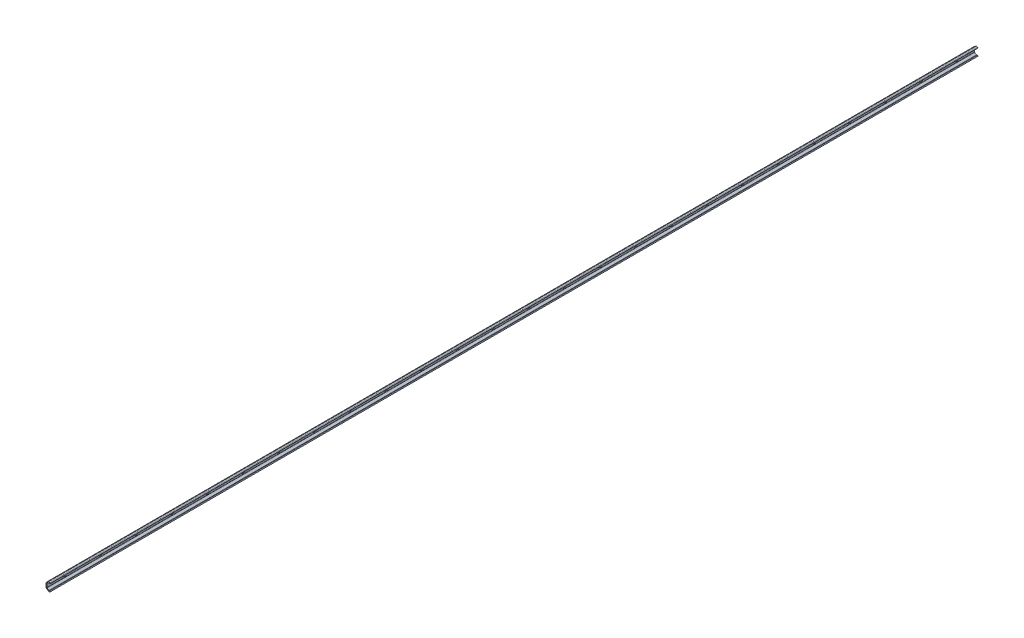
ISO-10303-21;
HEADER;
FILE_DESCRIPTION(('STEP AP214'),'2;1');
FILE_NAME('part.step','',(''),(''),'','','');
FILE_SCHEMA(('AUTOMOTIVE_DESIGN { 1 0 10303 214 1 1 1 1 }'));
ENDSEC;
DATA;
#1=APPLICATION_CONTEXT('core data for automotive mechanical design processes');
#2=APPLICATION_PROTOCOL_DEFINITION('international standard','automotive_design',2000,#1);
#3=PRODUCT_CONTEXT('',#1,'mechanical');
#4=PRODUCT('Part','Part','',(#3));
#5=PRODUCT_RELATED_PRODUCT_CATEGORY('part','',(#4));
#6=PRODUCT_DEFINITION_FORMATION('','',#4);
#7=PRODUCT_DEFINITION_CONTEXT('part definition',#1,'design');
#8=PRODUCT_DEFINITION('design','',#6,#7);
#9=PRODUCT_DEFINITION_SHAPE('','',#8);
#10=(LENGTH_UNIT() NAMED_UNIT(*) SI_UNIT(.MILLI.,.METRE.));
#11=(NAMED_UNIT(*) PLANE_ANGLE_UNIT() SI_UNIT($,.RADIAN.));
#12=(NAMED_UNIT(*) SI_UNIT($,.STERADIAN.) SOLID_ANGLE_UNIT());
#13=UNCERTAINTY_MEASURE_WITH_UNIT(LENGTH_MEASURE(1.E-05),#10,'distance_accuracy_value','');
#14=(GEOMETRIC_REPRESENTATION_CONTEXT(3) GLOBAL_UNCERTAINTY_ASSIGNED_CONTEXT((#13)) GLOBAL_UNIT_ASSIGNED_CONTEXT((#10,
#11,#12)) REPRESENTATION_CONTEXT('',''));
#15=CARTESIAN_POINT('',(0.,0.,0.));
#16=DIRECTION('',(0.,0.,1.));
#17=DIRECTION('',(1.,0.,0.));
#18=AXIS2_PLACEMENT_3D('',#15,#16,#17);
#19=CARTESIAN_POINT('',(7.52196603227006,7.45296627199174,-2080.));
#20=DIRECTION('',(-0.573576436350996,-0.819152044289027,0.));
#21=DIRECTION('',(0.819152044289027,-0.573576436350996,0.));
#22=AXIS2_PLACEMENT_3D('',#19,#20,#21);
#23=PLANE('',#22);
#24=DIRECTION('',(0.819152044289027,-0.573576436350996,0.));
#25=VECTOR('',#24,1.);
#26=CARTESIAN_POINT('',(7.52196603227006,7.45296627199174,0.));
#27=LINE('',#26,#25);
#28=CARTESIAN_POINT('',(7.52196603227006,7.45296627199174,0.));
#29=VERTEX_POINT('',#28);
#30=CARTESIAN_POINT('',(8.85284712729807,6.52107329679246,0.));
#31=VERTEX_POINT('',#30);
#32=EDGE_CURVE('E892',#29,#31,#27,.T.);
#33=ORIENTED_EDGE('',*,*,#32,.F.);
#34=DIRECTION('',(0.,0.,1.));
#35=VECTOR('',#34,1.);
#36=CARTESIAN_POINT('',(7.52196603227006,7.45296627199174,-2080.));
#37=LINE('',#36,#35);
#38=CARTESIAN_POINT('',(7.52196603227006,7.45296627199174,-2080.));
#39=VERTEX_POINT('',#38);
#40=EDGE_CURVE('E1062',#39,#29,#37,.T.);
#41=ORIENTED_EDGE('',*,*,#40,.F.);
#42=DIRECTION('',(0.819152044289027,-0.573576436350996,0.));
#43=VECTOR('',#42,1.);
#44=CARTESIAN_POINT('',(7.52196603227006,7.45296627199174,-2080.));
#45=LINE('',#44,#43);
#46=CARTESIAN_POINT('',(8.85284712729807,6.52107329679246,-2080.));
#47=VERTEX_POINT('',#46);
#48=EDGE_CURVE('E902',#39,#47,#45,.T.);
#49=ORIENTED_EDGE('',*,*,#48,.T.);
#50=DIRECTION('',(0.,0.,1.));
#51=VECTOR('',#50,1.);
#52=CARTESIAN_POINT('',(8.85284712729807,6.52107329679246,-2080.));
#53=LINE('',#52,#51);
#54=EDGE_CURVE('E983',#47,#31,#53,.T.);
#55=ORIENTED_EDGE('',*,*,#54,.T.);
#56=EDGE_LOOP('',(#33,#41,#49,#55));
#57=FACE_BOUND('',#56,.T.);
#58=ADVANCED_FACE('F39',(#57),#23,.T.);
#59=CARTESIAN_POINT('',(7.00000000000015,6.70752152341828,-2080.));
#60=DIRECTION('',(0.,0.,1.));
#61=DIRECTION('',(1.,0.,0.));
#62=AXIS2_PLACEMENT_3D('',#59,#60,#61);
#63=CYLINDRICAL_SURFACE('',#62,0.910020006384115);
#64=CARTESIAN_POINT('',(7.00000000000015,6.70752152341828,0.));
#65=DIRECTION('',(0.,0.,-1.));
#66=DIRECTION('',(-1.,0.,0.));
#67=AXIS2_PLACEMENT_3D('',#64,#65,#66);
#68=CIRCLE('',#67,0.910020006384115);
#69=CARTESIAN_POINT('',(6.47803396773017,7.4529662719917,0.));
#70=VERTEX_POINT('',#69);
#71=EDGE_CURVE('E907',#70,#29,#68,.T.);
#72=ORIENTED_EDGE('',*,*,#71,.F.);
#73=DIRECTION('',(0.,0.,1.));
#74=VECTOR('',#73,1.);
#75=CARTESIAN_POINT('',(6.47803396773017,7.4529662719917,-2080.));
#76=LINE('',#75,#74);
#77=CARTESIAN_POINT('',(6.47803396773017,7.4529662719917,-2080.));
#78=VERTEX_POINT('',#77);
#79=EDGE_CURVE('E1066',#78,#70,#76,.T.);
#80=ORIENTED_EDGE('',*,*,#79,.F.);
#81=CARTESIAN_POINT('',(7.00000000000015,6.70752152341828,-2080.));
#82=DIRECTION('',(0.,0.,-1.));
#83=DIRECTION('',(-1.,0.,0.));
#84=AXIS2_PLACEMENT_3D('',#81,#82,#83);
#85=CIRCLE('',#84,0.910020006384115);
#86=EDGE_CURVE('E979',#78,#39,#85,.T.);
#87=ORIENTED_EDGE('',*,*,#86,.T.);
#88=ORIENTED_EDGE('',*,*,#40,.T.);
#89=EDGE_LOOP('',(#72,#80,#87,#88));
#90=FACE_BOUND('',#89,.T.);
#91=ADVANCED_FACE('F2184',(#90),#63,.F.);
#92=CARTESIAN_POINT('',(2.36906085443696,4.57583232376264,-2080.));
#93=DIRECTION('',(0.573576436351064,-0.819152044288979,0.));
#94=DIRECTION('',(0.819152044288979,0.573576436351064,0.));
#95=AXIS2_PLACEMENT_3D('',#92,#93,#94);
#96=PLANE('',#95);
#97=DIRECTION('',(0.819152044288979,0.573576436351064,0.));
#98=VECTOR('',#97,1.);
#99=CARTESIAN_POINT('',(2.36906085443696,4.57583232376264,0.));
#100=LINE('',#99,#98);
#101=CARTESIAN_POINT('',(2.36906085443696,4.57583232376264,0.));
#102=VERTEX_POINT('',#101);
#103=EDGE_CURVE('E1055',#102,#70,#100,.T.);
#104=ORIENTED_EDGE('',*,*,#103,.F.);
#105=DIRECTION('',(0.,0.,1.));
#106=VECTOR('',#105,1.);
#107=CARTESIAN_POINT('',(2.36906085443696,4.57583232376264,-2080.));
#108=LINE('',#107,#106);
#109=CARTESIAN_POINT('',(2.36906085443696,4.57583232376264,-2080.));
#110=VERTEX_POINT('',#109);
#111=EDGE_CURVE('E1069',#110,#102,#108,.T.);
#112=ORIENTED_EDGE('',*,*,#111,.F.);
#113=DIRECTION('',(0.819152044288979,0.573576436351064,0.));
#114=VECTOR('',#113,1.);
#115=CARTESIAN_POINT('',(2.36906085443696,4.57583232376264,-2080.));
#116=LINE('',#115,#114);
#117=EDGE_CURVE('E975',#110,#78,#116,.T.);
#118=ORIENTED_EDGE('',*,*,#117,.T.);
#119=ORIENTED_EDGE('',*,*,#79,.T.);
#120=EDGE_LOOP('',(#104,#112,#118,#119));
#121=FACE_BOUND('',#120,.T.);
#122=ADVANCED_FACE('F2190',(#121),#96,.T.);
#123=CARTESIAN_POINT('',(3.00000000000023,3.79999999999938,-2080.));
#124=DIRECTION('',(0.,0.,1.));
#125=DIRECTION('',(1.,0.,0.));
#126=AXIS2_PLACEMENT_3D('',#123,#124,#125);
#127=CYLINDRICAL_SURFACE('',#126,1.);
#128=CARTESIAN_POINT('',(3.00000000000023,3.79999999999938,0.));
#129=DIRECTION('',(0.,0.,-1.));
#130=DIRECTION('',(-1.,0.,0.));
#131=AXIS2_PLACEMENT_3D('',#128,#129,#130);
#132=CIRCLE('',#131,1.);
#133=CARTESIAN_POINT('',(2.00000000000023,3.79999999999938,0.));
#134=VERTEX_POINT('',#133);
#135=EDGE_CURVE('E1051',#134,#102,#132,.T.);
#136=ORIENTED_EDGE('',*,*,#135,.F.);
#137=DIRECTION('',(0.,0.,1.));
#138=VECTOR('',#137,1.);
#139=CARTESIAN_POINT('',(2.00000000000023,3.79999999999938,-2080.));
#140=LINE('',#139,#138);
#141=CARTESIAN_POINT('',(2.00000000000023,3.79999999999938,-2080.));
#142=VERTEX_POINT('',#141);
#143=EDGE_CURVE('E1072',#142,#134,#140,.T.);
#144=ORIENTED_EDGE('',*,*,#143,.F.);
#145=CARTESIAN_POINT('',(3.00000000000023,3.79999999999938,-2080.));
#146=DIRECTION('',(0.,0.,-1.));
#147=DIRECTION('',(-1.,0.,0.));
#148=AXIS2_PLACEMENT_3D('',#145,#146,#147);
#149=CIRCLE('',#148,1.);
#150=EDGE_CURVE('E971',#142,#110,#149,.T.);
#151=ORIENTED_EDGE('',*,*,#150,.T.);
#152=ORIENTED_EDGE('',*,*,#111,.T.);
#153=EDGE_LOOP('',(#136,#144,#151,#152));
#154=FACE_BOUND('',#153,.T.);
#155=ADVANCED_FACE('F2579',(#154),#127,.F.);
#156=CARTESIAN_POINT('',(2.00000000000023,-3.80000000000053,-2080.));
#157=DIRECTION('',(1.,0.,0.));
#158=DIRECTION('',(0.,1.,0.));
#159=AXIS2_PLACEMENT_3D('',#156,#157,#158);
#160=PLANE('',#159);
#161=CARTESIAN_POINT('',(2.00000000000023,0.,-118.75));
#162=DIRECTION('',(1.,0.,0.));
#163=DIRECTION('',(0.,1.,0.));
#164=AXIS2_PLACEMENT_3D('',#161,#162,#163);
#165=CIRCLE('',#164,2.25);
#166=CARTESIAN_POINT('',(2.00000000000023,2.25,-118.75));
#167=VERTEX_POINT('',#166);
#168=CARTESIAN_POINT('',(2.00000000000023,-2.25,-118.75));
#169=VERTEX_POINT('',#168);
#170=EDGE_CURVE('E850',#167,#169,#165,.T.);
#171=ORIENTED_EDGE('',*,*,#170,.F.);
#172=DIRECTION('',(0.,0.,1.));
#173=VECTOR('',#172,1.);
#174=CARTESIAN_POINT('',(2.00000000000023,2.25,-118.75));
#175=LINE('',#174,#173);
#176=CARTESIAN_POINT('',(2.00000000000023,2.25,-121.25));
#177=VERTEX_POINT('',#176);
#178=EDGE_CURVE('E827',#177,#167,#175,.T.);
#179=ORIENTED_EDGE('',*,*,#178,.F.);
#180=CARTESIAN_POINT('',(2.00000000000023,0.,-121.25));
#181=DIRECTION('',(1.,0.,0.));
#182=DIRECTION('',(0.,1.,0.));
#183=AXIS2_PLACEMENT_3D('',#180,#181,#182);
#184=CIRCLE('',#183,2.25);
#185=CARTESIAN_POINT('',(2.00000000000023,-2.25,-121.25));
#186=VERTEX_POINT('',#185);
#187=EDGE_CURVE('E818',#186,#177,#184,.T.);
#188=ORIENTED_EDGE('',*,*,#187,.F.);
#189=DIRECTION('',(0.,0.,-1.));
#190=VECTOR('',#189,1.);
#191=CARTESIAN_POINT('',(2.00000000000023,-2.25,-118.75));
#192=LINE('',#191,#190);
#193=EDGE_CURVE('E803',#169,#186,#192,.T.);
#194=ORIENTED_EDGE('',*,*,#193,.F.);
#195=EDGE_LOOP('',(#171,#179,#188,#194));
#196=FACE_BOUND('',#195,.T.);
#197=CARTESIAN_POINT('',(2.00000000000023,0.,-38.75));
#198=DIRECTION('',(1.,0.,0.));
#199=DIRECTION('',(0.,1.,0.));
#200=AXIS2_PLACEMENT_3D('',#197,#198,#199);
#201=CIRCLE('',#200,2.25);
#202=CARTESIAN_POINT('',(2.00000000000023,2.25,-38.75));
#203=VERTEX_POINT('',#202);
#204=CARTESIAN_POINT('',(2.00000000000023,-2.25,-38.7500000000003));
#205=VERTEX_POINT('',#204);
#206=EDGE_CURVE('E857',#203,#205,#201,.T.);
#207=ORIENTED_EDGE('',*,*,#206,.F.);
#208=DIRECTION('',(0.,0.,1.));
#209=VECTOR('',#208,1.);
#210=CARTESIAN_POINT('',(2.00000000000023,2.25,-38.75));
#211=LINE('',#210,#209);
#212=CARTESIAN_POINT('',(2.00000000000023,2.25,-41.25));
#213=VERTEX_POINT('',#212);
#214=EDGE_CURVE('E863',#213,#203,#211,.T.);
#215=ORIENTED_EDGE('',*,*,#214,.F.);
#216=CARTESIAN_POINT('',(2.00000000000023,0.,-41.25));
#217=DIRECTION('',(1.,0.,0.));
#218=DIRECTION('',(0.,1.,0.));
#219=AXIS2_PLACEMENT_3D('',#216,#217,#218);
#220=CIRCLE('',#219,2.25);
#221=CARTESIAN_POINT('',(2.00000000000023,-2.25,-41.25));
#222=VERTEX_POINT('',#221);
#223=EDGE_CURVE('E882',#222,#213,#220,.T.);
#224=ORIENTED_EDGE('',*,*,#223,.F.);
#225=DIRECTION('',(0.,0.,-1.));
#226=VECTOR('',#225,1.);
#227=CARTESIAN_POINT('',(2.00000000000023,-2.25,-38.75));
#228=LINE('',#227,#226);
#229=EDGE_CURVE('E878',#205,#222,#228,.T.);
#230=ORIENTED_EDGE('',*,*,#229,.F.);
#231=EDGE_LOOP('',(#207,#215,#224,#230));
#232=FACE_BOUND('',#231,.T.);
#233=DIRECTION('',(0.,1.,0.));
#234=VECTOR('',#233,1.);
#235=CARTESIAN_POINT('',(2.00000000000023,-3.80000000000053,0.));
#236=LINE('',#235,#234);
#237=CARTESIAN_POINT('',(2.00000000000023,-3.80000000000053,0.));
#238=VERTEX_POINT('',#237);
#239=EDGE_CURVE('E1047',#238,#134,#236,.T.);
#240=ORIENTED_EDGE('',*,*,#239,.F.);
#241=DIRECTION('',(0.,0.,1.));
#242=VECTOR('',#241,1.);
#243=CARTESIAN_POINT('',(2.00000000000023,-3.80000000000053,-2080.));
#244=LINE('',#243,#242);
#245=CARTESIAN_POINT('',(2.00000000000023,-3.80000000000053,-2080.));
#246=VERTEX_POINT('',#245);
#247=EDGE_CURVE('E1075',#246,#238,#244,.T.);
#248=ORIENTED_EDGE('',*,*,#247,.F.);
#249=DIRECTION('',(0.,1.,0.));
#250=VECTOR('',#249,1.);
#251=CARTESIAN_POINT('',(2.00000000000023,-3.80000000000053,-2080.));
#252=LINE('',#251,#250);
#253=EDGE_CURVE('E967',#246,#142,#252,.T.);
#254=ORIENTED_EDGE('',*,*,#253,.T.);
#255=ORIENTED_EDGE('',*,*,#143,.T.);
#256=EDGE_LOOP('',(#240,#248,#254,#255));
#257=FACE_BOUND('',#256,.T.);
#258=CARTESIAN_POINT('',(2.00000000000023,0.,-198.75));
#259=DIRECTION('',(1.,0.,0.));
#260=DIRECTION('',(0.,1.,0.));
#261=AXIS2_PLACEMENT_3D('',#258,#259,#260);
#262=CIRCLE('',#261,2.25);
#263=CARTESIAN_POINT('',(2.00000000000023,2.25,-198.75));
#264=VERTEX_POINT('',#263);
#265=CARTESIAN_POINT('',(2.00000000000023,-2.25,-198.75));
#266=VERTEX_POINT('',#265);
#267=EDGE_CURVE('E1065',#264,#266,#262,.T.);
#268=ORIENTED_EDGE('',*,*,#267,.F.);
#269=DIRECTION('',(0.,0.,1.));
#270=VECTOR('',#269,1.);
#271=CARTESIAN_POINT('',(2.00000000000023,2.25,-198.75));
#272=LINE('',#271,#270);
#273=CARTESIAN_POINT('',(2.00000000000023,2.25,-201.25));
#274=VERTEX_POINT('',#273);
#275=EDGE_CURVE('E1124',#274,#264,#272,.T.);
#276=ORIENTED_EDGE('',*,*,#275,.F.);
#277=CARTESIAN_POINT('',(2.00000000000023,0.,-201.25));
#278=DIRECTION('',(1.,0.,0.));
#279=DIRECTION('',(0.,1.,0.));
#280=AXIS2_PLACEMENT_3D('',#277,#278,#279);
#281=CIRCLE('',#280,2.25);
#282=CARTESIAN_POINT('',(2.00000000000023,-2.25,-201.25));
#283=VERTEX_POINT('',#282);
#284=EDGE_CURVE('E1128',#283,#274,#281,.T.);
#285=ORIENTED_EDGE('',*,*,#284,.F.);
#286=DIRECTION('',(0.,0.,-1.));
#287=VECTOR('',#286,1.);
#288=CARTESIAN_POINT('',(2.00000000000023,-2.25,-198.75));
#289=LINE('',#288,#287);
#290=EDGE_CURVE('E1132',#266,#283,#289,.T.);
#291=ORIENTED_EDGE('',*,*,#290,.F.);
#292=EDGE_LOOP('',(#268,#276,#285,#291));
#293=FACE_BOUND('',#292,.T.);
#294=CARTESIAN_POINT('',(2.00000000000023,0.,-278.75));
#295=DIRECTION('',(1.,0.,0.));
#296=DIRECTION('',(0.,1.,0.));
#297=AXIS2_PLACEMENT_3D('',#294,#295,#296);
#298=CIRCLE('',#297,2.25);
#299=CARTESIAN_POINT('',(2.00000000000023,2.25,-278.75));
#300=VERTEX_POINT('',#299);
#301=CARTESIAN_POINT('',(2.00000000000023,-2.25,-278.75));
#302=VERTEX_POINT('',#301);
#303=EDGE_CURVE('E1165',#300,#302,#298,.T.);
#304=ORIENTED_EDGE('',*,*,#303,.F.);
#305=DIRECTION('',(0.,0.,1.));
#306=VECTOR('',#305,1.);
#307=CARTESIAN_POINT('',(2.00000000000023,2.25,-278.75));
#308=LINE('',#307,#306);
#309=CARTESIAN_POINT('',(2.00000000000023,2.25,-281.25));
#310=VERTEX_POINT('',#309);
#311=EDGE_CURVE('E1168',#310,#300,#308,.T.);
#312=ORIENTED_EDGE('',*,*,#311,.F.);
#313=CARTESIAN_POINT('',(2.00000000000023,0.,-281.25));
#314=DIRECTION('',(1.,0.,0.));
#315=DIRECTION('',(0.,1.,0.));
#316=AXIS2_PLACEMENT_3D('',#313,#314,#315);
#317=CIRCLE('',#316,2.25);
#318=CARTESIAN_POINT('',(2.00000000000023,-2.25,-281.25));
#319=VERTEX_POINT('',#318);
#320=EDGE_CURVE('E1172',#319,#310,#317,.T.);
#321=ORIENTED_EDGE('',*,*,#320,.F.);
#322=DIRECTION('',(0.,0.,-1.));
#323=VECTOR('',#322,1.);
#324=CARTESIAN_POINT('',(2.00000000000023,-2.25,-278.75));
#325=LINE('',#324,#323);
#326=EDGE_CURVE('E1176',#302,#319,#325,.T.);
#327=ORIENTED_EDGE('',*,*,#326,.F.);
#328=EDGE_LOOP('',(#304,#312,#321,#327));
#329=FACE_BOUND('',#328,.T.);
#330=CARTESIAN_POINT('',(2.00000000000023,0.,-358.75));
#331=DIRECTION('',(1.,0.,0.));
#332=DIRECTION('',(0.,1.,0.));
#333=AXIS2_PLACEMENT_3D('',#330,#331,#332);
#334=CIRCLE('',#333,2.25);
#335=CARTESIAN_POINT('',(2.00000000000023,2.25,-358.75));
#336=VERTEX_POINT('',#335);
#337=CARTESIAN_POINT('',(2.00000000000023,-2.25,-358.75));
#338=VERTEX_POINT('',#337);
#339=EDGE_CURVE('E1209',#336,#338,#334,.T.);
#340=ORIENTED_EDGE('',*,*,#339,.F.);
#341=DIRECTION('',(0.,0.,1.));
#342=VECTOR('',#341,1.);
#343=CARTESIAN_POINT('',(2.00000000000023,2.25,-358.75));
#344=LINE('',#343,#342);
#345=CARTESIAN_POINT('',(2.00000000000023,2.25,-361.25));
#346=VERTEX_POINT('',#345);
#347=EDGE_CURVE('E1212',#346,#336,#344,.T.);
#348=ORIENTED_EDGE('',*,*,#347,.F.);
#349=CARTESIAN_POINT('',(2.00000000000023,0.,-361.25));
#350=DIRECTION('',(1.,0.,0.));
#351=DIRECTION('',(0.,1.,0.));
#352=AXIS2_PLACEMENT_3D('',#349,#350,#351);
#353=CIRCLE('',#352,2.25);
#354=CARTESIAN_POINT('',(2.00000000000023,-2.25,-361.25));
#355=VERTEX_POINT('',#354);
#356=EDGE_CURVE('E1216',#355,#346,#353,.T.);
#357=ORIENTED_EDGE('',*,*,#356,.F.);
#358=DIRECTION('',(0.,0.,-1.));
#359=VECTOR('',#358,1.);
#360=CARTESIAN_POINT('',(2.00000000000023,-2.25,-358.75));
#361=LINE('',#360,#359);
#362=EDGE_CURVE('E1220',#338,#355,#361,.T.);
#363=ORIENTED_EDGE('',*,*,#362,.F.);
#364=EDGE_LOOP('',(#340,#348,#357,#363));
#365=FACE_BOUND('',#364,.T.);
#366=CARTESIAN_POINT('',(2.00000000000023,0.,-438.75));
#367=DIRECTION('',(1.,0.,0.));
#368=DIRECTION('',(0.,1.,0.));
#369=AXIS2_PLACEMENT_3D('',#366,#367,#368);
#370=CIRCLE('',#369,2.25);
#371=CARTESIAN_POINT('',(2.00000000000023,2.25,-438.75));
#372=VERTEX_POINT('',#371);
#373=CARTESIAN_POINT('',(2.00000000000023,-2.25,-438.75));
#374=VERTEX_POINT('',#373);
#375=EDGE_CURVE('E1253',#372,#374,#370,.T.);
#376=ORIENTED_EDGE('',*,*,#375,.F.);
#377=DIRECTION('',(0.,0.,1.));
#378=VECTOR('',#377,1.);
#379=CARTESIAN_POINT('',(2.00000000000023,2.25,-438.75));
#380=LINE('',#379,#378);
#381=CARTESIAN_POINT('',(2.00000000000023,2.25,-441.25));
#382=VERTEX_POINT('',#381);
#383=EDGE_CURVE('E1256',#382,#372,#380,.T.);
#384=ORIENTED_EDGE('',*,*,#383,.F.);
#385=CARTESIAN_POINT('',(2.00000000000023,0.,-441.25));
#386=DIRECTION('',(1.,0.,0.));
#387=DIRECTION('',(0.,1.,0.));
#388=AXIS2_PLACEMENT_3D('',#385,#386,#387);
#389=CIRCLE('',#388,2.25);
#390=CARTESIAN_POINT('',(2.00000000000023,-2.25,-441.25));
#391=VERTEX_POINT('',#390);
#392=EDGE_CURVE('E1259',#391,#382,#389,.T.);
#393=ORIENTED_EDGE('',*,*,#392,.F.);
#394=DIRECTION('',(0.,0.,-1.));
#395=VECTOR('',#394,1.);
#396=CARTESIAN_POINT('',(2.00000000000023,-2.25,-438.75));
#397=LINE('',#396,#395);
#398=EDGE_CURVE('E1263',#374,#391,#397,.T.);
#399=ORIENTED_EDGE('',*,*,#398,.F.);
#400=EDGE_LOOP('',(#376,#384,#393,#399));
#401=FACE_BOUND('',#400,.T.);
#402=CARTESIAN_POINT('',(2.00000000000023,0.,-518.75));
#403=DIRECTION('',(1.,0.,0.));
#404=DIRECTION('',(0.,1.,0.));
#405=AXIS2_PLACEMENT_3D('',#402,#403,#404);
#406=CIRCLE('',#405,2.25);
#407=CARTESIAN_POINT('',(2.00000000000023,2.25,-518.75));
#408=VERTEX_POINT('',#407);
#409=CARTESIAN_POINT('',(2.00000000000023,-2.25,-518.75));
#410=VERTEX_POINT('',#409);
#411=EDGE_CURVE('E1296',#408,#410,#406,.T.);
#412=ORIENTED_EDGE('',*,*,#411,.F.);
#413=DIRECTION('',(0.,0.,1.));
#414=VECTOR('',#413,1.);
#415=CARTESIAN_POINT('',(2.00000000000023,2.25,-518.75));
#416=LINE('',#415,#414);
#417=CARTESIAN_POINT('',(2.00000000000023,2.25,-521.25));
#418=VERTEX_POINT('',#417);
#419=EDGE_CURVE('E1299',#418,#408,#416,.T.);
#420=ORIENTED_EDGE('',*,*,#419,.F.);
#421=CARTESIAN_POINT('',(2.00000000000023,0.,-521.25));
#422=DIRECTION('',(1.,0.,0.));
#423=DIRECTION('',(0.,1.,0.));
#424=AXIS2_PLACEMENT_3D('',#421,#422,#423);
#425=CIRCLE('',#424,2.25);
#426=CARTESIAN_POINT('',(2.00000000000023,-2.25,-521.25));
#427=VERTEX_POINT('',#426);
#428=EDGE_CURVE('E1303',#427,#418,#425,.T.);
#429=ORIENTED_EDGE('',*,*,#428,.F.);
#430=DIRECTION('',(0.,0.,-1.));
#431=VECTOR('',#430,1.);
#432=CARTESIAN_POINT('',(2.00000000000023,-2.25,-518.75));
#433=LINE('',#432,#431);
#434=EDGE_CURVE('E1307',#410,#427,#433,.T.);
#435=ORIENTED_EDGE('',*,*,#434,.F.);
#436=EDGE_LOOP('',(#412,#420,#429,#435));
#437=FACE_BOUND('',#436,.T.);
#438=CARTESIAN_POINT('',(2.00000000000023,0.,-598.75));
#439=DIRECTION('',(1.,0.,0.));
#440=DIRECTION('',(0.,1.,0.));
#441=AXIS2_PLACEMENT_3D('',#438,#439,#440);
#442=CIRCLE('',#441,2.25);
#443=CARTESIAN_POINT('',(2.00000000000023,2.25,-598.75));
#444=VERTEX_POINT('',#443);
#445=CARTESIAN_POINT('',(2.00000000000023,-2.25,-598.75));
#446=VERTEX_POINT('',#445);
#447=EDGE_CURVE('E1340',#444,#446,#442,.T.);
#448=ORIENTED_EDGE('',*,*,#447,.F.);
#449=DIRECTION('',(0.,0.,1.));
#450=VECTOR('',#449,1.);
#451=CARTESIAN_POINT('',(2.00000000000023,2.25,-598.75));
#452=LINE('',#451,#450);
#453=CARTESIAN_POINT('',(2.00000000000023,2.25,-601.25));
#454=VERTEX_POINT('',#453);
#455=EDGE_CURVE('E1343',#454,#444,#452,.T.);
#456=ORIENTED_EDGE('',*,*,#455,.F.);
#457=CARTESIAN_POINT('',(2.00000000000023,0.,-601.25));
#458=DIRECTION('',(1.,0.,0.));
#459=DIRECTION('',(0.,1.,0.));
#460=AXIS2_PLACEMENT_3D('',#457,#458,#459);
#461=CIRCLE('',#460,2.25);
#462=CARTESIAN_POINT('',(2.00000000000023,-2.25,-601.25));
#463=VERTEX_POINT('',#462);
#464=EDGE_CURVE('E1347',#463,#454,#461,.T.);
#465=ORIENTED_EDGE('',*,*,#464,.F.);
#466=DIRECTION('',(0.,0.,-1.));
#467=VECTOR('',#466,1.);
#468=CARTESIAN_POINT('',(2.00000000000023,-2.25,-598.75));
#469=LINE('',#468,#467);
#470=EDGE_CURVE('E1351',#446,#463,#469,.T.);
#471=ORIENTED_EDGE('',*,*,#470,.F.);
#472=EDGE_LOOP('',(#448,#456,#465,#471));
#473=FACE_BOUND('',#472,.T.);
#474=CARTESIAN_POINT('',(2.00000000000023,0.,-678.75));
#475=DIRECTION('',(1.,0.,0.));
#476=DIRECTION('',(0.,1.,0.));
#477=AXIS2_PLACEMENT_3D('',#474,#475,#476);
#478=CIRCLE('',#477,2.25);
#479=CARTESIAN_POINT('',(2.00000000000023,2.25,-678.75));
#480=VERTEX_POINT('',#479);
#481=CARTESIAN_POINT('',(2.00000000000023,-2.25,-678.75));
#482=VERTEX_POINT('',#481);
#483=EDGE_CURVE('E1384',#480,#482,#478,.T.);
#484=ORIENTED_EDGE('',*,*,#483,.F.);
#485=DIRECTION('',(0.,0.,1.));
#486=VECTOR('',#485,1.);
#487=CARTESIAN_POINT('',(2.00000000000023,2.25,-678.75));
#488=LINE('',#487,#486);
#489=CARTESIAN_POINT('',(2.00000000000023,2.25,-681.25));
#490=VERTEX_POINT('',#489);
#491=EDGE_CURVE('E1387',#490,#480,#488,.T.);
#492=ORIENTED_EDGE('',*,*,#491,.F.);
#493=CARTESIAN_POINT('',(2.00000000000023,0.,-681.25));
#494=DIRECTION('',(1.,0.,0.));
#495=DIRECTION('',(0.,1.,0.));
#496=AXIS2_PLACEMENT_3D('',#493,#494,#495);
#497=CIRCLE('',#496,2.25);
#498=CARTESIAN_POINT('',(2.00000000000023,-2.25,-681.25));
#499=VERTEX_POINT('',#498);
#500=EDGE_CURVE('E1391',#499,#490,#497,.T.);
#501=ORIENTED_EDGE('',*,*,#500,.F.);
#502=DIRECTION('',(0.,0.,-1.));
#503=VECTOR('',#502,1.);
#504=CARTESIAN_POINT('',(2.00000000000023,-2.25,-678.75));
#505=LINE('',#504,#503);
#506=EDGE_CURVE('E1395',#482,#499,#505,.T.);
#507=ORIENTED_EDGE('',*,*,#506,.F.);
#508=EDGE_LOOP('',(#484,#492,#501,#507));
#509=FACE_BOUND('',#508,.T.);
#510=CARTESIAN_POINT('',(2.00000000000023,0.,-758.75));
#511=DIRECTION('',(1.,0.,0.));
#512=DIRECTION('',(0.,1.,0.));
#513=AXIS2_PLACEMENT_3D('',#510,#511,#512);
#514=CIRCLE('',#513,2.25);
#515=CARTESIAN_POINT('',(2.00000000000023,2.25,-758.75));
#516=VERTEX_POINT('',#515);
#517=CARTESIAN_POINT('',(2.00000000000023,-2.25,-758.75));
#518=VERTEX_POINT('',#517);
#519=EDGE_CURVE('E1428',#516,#518,#514,.T.);
#520=ORIENTED_EDGE('',*,*,#519,.F.);
#521=DIRECTION('',(0.,0.,1.));
#522=VECTOR('',#521,1.);
#523=CARTESIAN_POINT('',(2.00000000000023,2.25,-758.75));
#524=LINE('',#523,#522);
#525=CARTESIAN_POINT('',(2.00000000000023,2.25,-761.25));
#526=VERTEX_POINT('',#525);
#527=EDGE_CURVE('E1431',#526,#516,#524,.T.);
#528=ORIENTED_EDGE('',*,*,#527,.F.);
#529=CARTESIAN_POINT('',(2.00000000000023,0.,-761.25));
#530=DIRECTION('',(1.,0.,0.));
#531=DIRECTION('',(0.,1.,0.));
#532=AXIS2_PLACEMENT_3D('',#529,#530,#531);
#533=CIRCLE('',#532,2.25);
#534=CARTESIAN_POINT('',(2.00000000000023,-2.25,-761.25));
#535=VERTEX_POINT('',#534);
#536=EDGE_CURVE('E1435',#535,#526,#533,.T.);
#537=ORIENTED_EDGE('',*,*,#536,.F.);
#538=DIRECTION('',(0.,0.,-1.));
#539=VECTOR('',#538,1.);
#540=CARTESIAN_POINT('',(2.00000000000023,-2.25,-758.75));
#541=LINE('',#540,#539);
#542=EDGE_CURVE('E1439',#518,#535,#541,.T.);
#543=ORIENTED_EDGE('',*,*,#542,.F.);
#544=EDGE_LOOP('',(#520,#528,#537,#543));
#545=FACE_BOUND('',#544,.T.);
#546=CARTESIAN_POINT('',(2.00000000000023,0.,-838.75));
#547=DIRECTION('',(1.,0.,0.));
#548=DIRECTION('',(0.,1.,0.));
#549=AXIS2_PLACEMENT_3D('',#546,#547,#548);
#550=CIRCLE('',#549,2.25);
#551=CARTESIAN_POINT('',(2.00000000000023,2.25,-838.75));
#552=VERTEX_POINT('',#551);
#553=CARTESIAN_POINT('',(2.00000000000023,-2.25,-838.75));
#554=VERTEX_POINT('',#553);
#555=EDGE_CURVE('E1472',#552,#554,#550,.T.);
#556=ORIENTED_EDGE('',*,*,#555,.F.);
#557=DIRECTION('',(0.,0.,1.));
#558=VECTOR('',#557,1.);
#559=CARTESIAN_POINT('',(2.00000000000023,2.25,-838.75));
#560=LINE('',#559,#558);
#561=CARTESIAN_POINT('',(2.00000000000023,2.25,-841.25));
#562=VERTEX_POINT('',#561);
#563=EDGE_CURVE('E1475',#562,#552,#560,.T.);
#564=ORIENTED_EDGE('',*,*,#563,.F.);
#565=CARTESIAN_POINT('',(2.00000000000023,0.,-841.25));
#566=DIRECTION('',(1.,0.,0.));
#567=DIRECTION('',(0.,1.,0.));
#568=AXIS2_PLACEMENT_3D('',#565,#566,#567);
#569=CIRCLE('',#568,2.25);
#570=CARTESIAN_POINT('',(2.00000000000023,-2.25,-841.25));
#571=VERTEX_POINT('',#570);
#572=EDGE_CURVE('E1479',#571,#562,#569,.T.);
#573=ORIENTED_EDGE('',*,*,#572,.F.);
#574=DIRECTION('',(0.,0.,-1.));
#575=VECTOR('',#574,1.);
#576=CARTESIAN_POINT('',(2.00000000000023,-2.25,-838.75));
#577=LINE('',#576,#575);
#578=EDGE_CURVE('E1483',#554,#571,#577,.T.);
#579=ORIENTED_EDGE('',*,*,#578,.F.);
#580=EDGE_LOOP('',(#556,#564,#573,#579));
#581=FACE_BOUND('',#580,.T.);
#582=CARTESIAN_POINT('',(2.00000000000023,0.,-918.75));
#583=DIRECTION('',(1.,0.,0.));
#584=DIRECTION('',(0.,1.,0.));
#585=AXIS2_PLACEMENT_3D('',#582,#583,#584);
#586=CIRCLE('',#585,2.25);
#587=CARTESIAN_POINT('',(2.00000000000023,2.25,-918.75));
#588=VERTEX_POINT('',#587);
#589=CARTESIAN_POINT('',(2.00000000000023,-2.25,-918.75));
#590=VERTEX_POINT('',#589);
#591=EDGE_CURVE('E1516',#588,#590,#586,.T.);
#592=ORIENTED_EDGE('',*,*,#591,.F.);
#593=DIRECTION('',(0.,0.,1.));
#594=VECTOR('',#593,1.);
#595=CARTESIAN_POINT('',(2.00000000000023,2.25,-918.75));
#596=LINE('',#595,#594);
#597=CARTESIAN_POINT('',(2.00000000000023,2.25,-921.25));
#598=VERTEX_POINT('',#597);
#599=EDGE_CURVE('E1519',#598,#588,#596,.T.);
#600=ORIENTED_EDGE('',*,*,#599,.F.);
#601=CARTESIAN_POINT('',(2.00000000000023,0.,-921.25));
#602=DIRECTION('',(1.,0.,0.));
#603=DIRECTION('',(0.,1.,0.));
#604=AXIS2_PLACEMENT_3D('',#601,#602,#603);
#605=CIRCLE('',#604,2.25);
#606=CARTESIAN_POINT('',(2.00000000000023,-2.25,-921.25));
#607=VERTEX_POINT('',#606);
#608=EDGE_CURVE('E1523',#607,#598,#605,.T.);
#609=ORIENTED_EDGE('',*,*,#608,.F.);
#610=DIRECTION('',(0.,0.,-1.));
#611=VECTOR('',#610,1.);
#612=CARTESIAN_POINT('',(2.00000000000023,-2.25,-918.75));
#613=LINE('',#612,#611);
#614=EDGE_CURVE('E1527',#590,#607,#613,.T.);
#615=ORIENTED_EDGE('',*,*,#614,.F.);
#616=EDGE_LOOP('',(#592,#600,#609,#615));
#617=FACE_BOUND('',#616,.T.);
#618=CARTESIAN_POINT('',(2.00000000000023,0.,-998.75));
#619=DIRECTION('',(1.,0.,0.));
#620=DIRECTION('',(0.,1.,0.));
#621=AXIS2_PLACEMENT_3D('',#618,#619,#620);
#622=CIRCLE('',#621,2.25);
#623=CARTESIAN_POINT('',(2.00000000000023,2.25,-998.75));
#624=VERTEX_POINT('',#623);
#625=CARTESIAN_POINT('',(2.00000000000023,-2.25,-998.75));
#626=VERTEX_POINT('',#625);
#627=EDGE_CURVE('E1560',#624,#626,#622,.T.);
#628=ORIENTED_EDGE('',*,*,#627,.F.);
#629=DIRECTION('',(0.,0.,1.));
#630=VECTOR('',#629,1.);
#631=CARTESIAN_POINT('',(2.00000000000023,2.25,-998.75));
#632=LINE('',#631,#630);
#633=CARTESIAN_POINT('',(2.00000000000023,2.25,-1001.25));
#634=VERTEX_POINT('',#633);
#635=EDGE_CURVE('E1563',#634,#624,#632,.T.);
#636=ORIENTED_EDGE('',*,*,#635,.F.);
#637=CARTESIAN_POINT('',(2.00000000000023,0.,-1001.25));
#638=DIRECTION('',(1.,0.,0.));
#639=DIRECTION('',(0.,1.,0.));
#640=AXIS2_PLACEMENT_3D('',#637,#638,#639);
#641=CIRCLE('',#640,2.25);
#642=CARTESIAN_POINT('',(2.00000000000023,-2.25,-1001.25));
#643=VERTEX_POINT('',#642);
#644=EDGE_CURVE('E1567',#643,#634,#641,.T.);
#645=ORIENTED_EDGE('',*,*,#644,.F.);
#646=DIRECTION('',(0.,0.,-1.));
#647=VECTOR('',#646,1.);
#648=CARTESIAN_POINT('',(2.00000000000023,-2.25,-998.75));
#649=LINE('',#648,#647);
#650=EDGE_CURVE('E1571',#626,#643,#649,.T.);
#651=ORIENTED_EDGE('',*,*,#650,.F.);
#652=EDGE_LOOP('',(#628,#636,#645,#651));
#653=FACE_BOUND('',#652,.T.);
#654=CARTESIAN_POINT('',(2.00000000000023,0.,-1078.75));
#655=DIRECTION('',(1.,0.,0.));
#656=DIRECTION('',(0.,1.,0.));
#657=AXIS2_PLACEMENT_3D('',#654,#655,#656);
#658=CIRCLE('',#657,2.25);
#659=CARTESIAN_POINT('',(2.00000000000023,2.25,-1078.75));
#660=VERTEX_POINT('',#659);
#661=CARTESIAN_POINT('',(2.00000000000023,-2.25,-1078.75));
#662=VERTEX_POINT('',#661);
#663=EDGE_CURVE('E1604',#660,#662,#658,.T.);
#664=ORIENTED_EDGE('',*,*,#663,.F.);
#665=DIRECTION('',(0.,0.,1.));
#666=VECTOR('',#665,1.);
#667=CARTESIAN_POINT('',(2.00000000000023,2.25,-1078.75));
#668=LINE('',#667,#666);
#669=CARTESIAN_POINT('',(2.00000000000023,2.25,-1081.25));
#670=VERTEX_POINT('',#669);
#671=EDGE_CURVE('E1607',#670,#660,#668,.T.);
#672=ORIENTED_EDGE('',*,*,#671,.F.);
#673=CARTESIAN_POINT('',(2.00000000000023,0.,-1081.25));
#674=DIRECTION('',(1.,0.,0.));
#675=DIRECTION('',(0.,1.,0.));
#676=AXIS2_PLACEMENT_3D('',#673,#674,#675);
#677=CIRCLE('',#676,2.25);
#678=CARTESIAN_POINT('',(2.00000000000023,-2.25,-1081.25));
#679=VERTEX_POINT('',#678);
#680=EDGE_CURVE('E1611',#679,#670,#677,.T.);
#681=ORIENTED_EDGE('',*,*,#680,.F.);
#682=DIRECTION('',(0.,0.,-1.));
#683=VECTOR('',#682,1.);
#684=CARTESIAN_POINT('',(2.00000000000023,-2.25,-1078.75));
#685=LINE('',#684,#683);
#686=EDGE_CURVE('E1615',#662,#679,#685,.T.);
#687=ORIENTED_EDGE('',*,*,#686,.F.);
#688=EDGE_LOOP('',(#664,#672,#681,#687));
#689=FACE_BOUND('',#688,.T.);
#690=CARTESIAN_POINT('',(2.00000000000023,0.,-1158.75));
#691=DIRECTION('',(1.,0.,0.));
#692=DIRECTION('',(0.,1.,0.));
#693=AXIS2_PLACEMENT_3D('',#690,#691,#692);
#694=CIRCLE('',#693,2.25);
#695=CARTESIAN_POINT('',(2.00000000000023,2.25,-1158.75));
#696=VERTEX_POINT('',#695);
#697=CARTESIAN_POINT('',(2.00000000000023,-2.25,-1158.75));
#698=VERTEX_POINT('',#697);
#699=EDGE_CURVE('E1648',#696,#698,#694,.T.);
#700=ORIENTED_EDGE('',*,*,#699,.F.);
#701=DIRECTION('',(0.,0.,1.));
#702=VECTOR('',#701,1.);
#703=CARTESIAN_POINT('',(2.00000000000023,2.25,-1158.75));
#704=LINE('',#703,#702);
#705=CARTESIAN_POINT('',(2.00000000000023,2.25,-1161.25));
#706=VERTEX_POINT('',#705);
#707=EDGE_CURVE('E1651',#706,#696,#704,.T.);
#708=ORIENTED_EDGE('',*,*,#707,.F.);
#709=CARTESIAN_POINT('',(2.00000000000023,0.,-1161.25));
#710=DIRECTION('',(1.,0.,0.));
#711=DIRECTION('',(0.,1.,0.));
#712=AXIS2_PLACEMENT_3D('',#709,#710,#711);
#713=CIRCLE('',#712,2.25);
#714=CARTESIAN_POINT('',(2.00000000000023,-2.25,-1161.25));
#715=VERTEX_POINT('',#714);
#716=EDGE_CURVE('E1655',#715,#706,#713,.T.);
#717=ORIENTED_EDGE('',*,*,#716,.F.);
#718=DIRECTION('',(0.,0.,-1.));
#719=VECTOR('',#718,1.);
#720=CARTESIAN_POINT('',(2.00000000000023,-2.25,-1158.75));
#721=LINE('',#720,#719);
#722=EDGE_CURVE('E1659',#698,#715,#721,.T.);
#723=ORIENTED_EDGE('',*,*,#722,.F.);
#724=EDGE_LOOP('',(#700,#708,#717,#723));
#725=FACE_BOUND('',#724,.T.);
#726=CARTESIAN_POINT('',(2.00000000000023,0.,-1238.75));
#727=DIRECTION('',(1.,0.,0.));
#728=DIRECTION('',(0.,1.,0.));
#729=AXIS2_PLACEMENT_3D('',#726,#727,#728);
#730=CIRCLE('',#729,2.25);
#731=CARTESIAN_POINT('',(2.00000000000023,2.25,-1238.75));
#732=VERTEX_POINT('',#731);
#733=CARTESIAN_POINT('',(2.00000000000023,-2.25,-1238.75));
#734=VERTEX_POINT('',#733);
#735=EDGE_CURVE('E1692',#732,#734,#730,.T.);
#736=ORIENTED_EDGE('',*,*,#735,.F.);
#737=DIRECTION('',(0.,0.,1.));
#738=VECTOR('',#737,1.);
#739=CARTESIAN_POINT('',(2.00000000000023,2.25,-1238.75));
#740=LINE('',#739,#738);
#741=CARTESIAN_POINT('',(2.00000000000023,2.25,-1241.25));
#742=VERTEX_POINT('',#741);
#743=EDGE_CURVE('E1695',#742,#732,#740,.T.);
#744=ORIENTED_EDGE('',*,*,#743,.F.);
#745=CARTESIAN_POINT('',(2.00000000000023,0.,-1241.25));
#746=DIRECTION('',(1.,0.,0.));
#747=DIRECTION('',(0.,1.,0.));
#748=AXIS2_PLACEMENT_3D('',#745,#746,#747);
#749=CIRCLE('',#748,2.25);
#750=CARTESIAN_POINT('',(2.00000000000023,-2.25,-1241.25));
#751=VERTEX_POINT('',#750);
#752=EDGE_CURVE('E1699',#751,#742,#749,.T.);
#753=ORIENTED_EDGE('',*,*,#752,.F.);
#754=DIRECTION('',(0.,0.,-1.));
#755=VECTOR('',#754,1.);
#756=CARTESIAN_POINT('',(2.00000000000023,-2.25,-1238.75));
#757=LINE('',#756,#755);
#758=EDGE_CURVE('E1703',#734,#751,#757,.T.);
#759=ORIENTED_EDGE('',*,*,#758,.F.);
#760=EDGE_LOOP('',(#736,#744,#753,#759));
#761=FACE_BOUND('',#760,.T.);
#762=CARTESIAN_POINT('',(2.00000000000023,0.,-1318.75));
#763=DIRECTION('',(1.,0.,0.));
#764=DIRECTION('',(0.,1.,0.));
#765=AXIS2_PLACEMENT_3D('',#762,#763,#764);
#766=CIRCLE('',#765,2.25);
#767=CARTESIAN_POINT('',(2.00000000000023,2.25,-1318.75));
#768=VERTEX_POINT('',#767);
#769=CARTESIAN_POINT('',(2.00000000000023,-2.25,-1318.75));
#770=VERTEX_POINT('',#769);
#771=EDGE_CURVE('E1736',#768,#770,#766,.T.);
#772=ORIENTED_EDGE('',*,*,#771,.F.);
#773=DIRECTION('',(0.,0.,1.));
#774=VECTOR('',#773,1.);
#775=CARTESIAN_POINT('',(2.00000000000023,2.25,-1318.75));
#776=LINE('',#775,#774);
#777=CARTESIAN_POINT('',(2.00000000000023,2.25,-1321.25));
#778=VERTEX_POINT('',#777);
#779=EDGE_CURVE('E1739',#778,#768,#776,.T.);
#780=ORIENTED_EDGE('',*,*,#779,.F.);
#781=CARTESIAN_POINT('',(2.00000000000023,0.,-1321.25));
#782=DIRECTION('',(1.,0.,0.));
#783=DIRECTION('',(0.,1.,0.));
#784=AXIS2_PLACEMENT_3D('',#781,#782,#783);
#785=CIRCLE('',#784,2.25);
#786=CARTESIAN_POINT('',(2.00000000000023,-2.25,-1321.25));
#787=VERTEX_POINT('',#786);
#788=EDGE_CURVE('E1743',#787,#778,#785,.T.);
#789=ORIENTED_EDGE('',*,*,#788,.F.);
#790=DIRECTION('',(0.,0.,-1.));
#791=VECTOR('',#790,1.);
#792=CARTESIAN_POINT('',(2.00000000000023,-2.25,-1318.75));
#793=LINE('',#792,#791);
#794=EDGE_CURVE('E1747',#770,#787,#793,.T.);
#795=ORIENTED_EDGE('',*,*,#794,.F.);
#796=EDGE_LOOP('',(#772,#780,#789,#795));
#797=FACE_BOUND('',#796,.T.);
#798=CARTESIAN_POINT('',(2.00000000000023,0.,-1398.75));
#799=DIRECTION('',(1.,0.,0.));
#800=DIRECTION('',(0.,1.,0.));
#801=AXIS2_PLACEMENT_3D('',#798,#799,#800);
#802=CIRCLE('',#801,2.25);
#803=CARTESIAN_POINT('',(2.00000000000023,2.25,-1398.75));
#804=VERTEX_POINT('',#803);
#805=CARTESIAN_POINT('',(2.00000000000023,-2.25,-1398.75));
#806=VERTEX_POINT('',#805);
#807=EDGE_CURVE('E1780',#804,#806,#802,.T.);
#808=ORIENTED_EDGE('',*,*,#807,.F.);
#809=DIRECTION('',(0.,0.,1.));
#810=VECTOR('',#809,1.);
#811=CARTESIAN_POINT('',(2.00000000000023,2.25,-1398.75));
#812=LINE('',#811,#810);
#813=CARTESIAN_POINT('',(2.00000000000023,2.25,-1401.25));
#814=VERTEX_POINT('',#813);
#815=EDGE_CURVE('E1783',#814,#804,#812,.T.);
#816=ORIENTED_EDGE('',*,*,#815,.F.);
#817=CARTESIAN_POINT('',(2.00000000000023,0.,-1401.25));
#818=DIRECTION('',(1.,0.,0.));
#819=DIRECTION('',(0.,1.,0.));
#820=AXIS2_PLACEMENT_3D('',#817,#818,#819);
#821=CIRCLE('',#820,2.25);
#822=CARTESIAN_POINT('',(2.00000000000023,-2.25,-1401.25));
#823=VERTEX_POINT('',#822);
#824=EDGE_CURVE('E1787',#823,#814,#821,.T.);
#825=ORIENTED_EDGE('',*,*,#824,.F.);
#826=DIRECTION('',(0.,0.,-1.));
#827=VECTOR('',#826,1.);
#828=CARTESIAN_POINT('',(2.00000000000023,-2.25,-1398.75));
#829=LINE('',#828,#827);
#830=EDGE_CURVE('E1791',#806,#823,#829,.T.);
#831=ORIENTED_EDGE('',*,*,#830,.F.);
#832=EDGE_LOOP('',(#808,#816,#825,#831));
#833=FACE_BOUND('',#832,.T.);
#834=CARTESIAN_POINT('',(2.00000000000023,0.,-1478.75));
#835=DIRECTION('',(1.,0.,0.));
#836=DIRECTION('',(0.,1.,0.));
#837=AXIS2_PLACEMENT_3D('',#834,#835,#836);
#838=CIRCLE('',#837,2.25);
#839=CARTESIAN_POINT('',(2.00000000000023,2.25,-1478.75));
#840=VERTEX_POINT('',#839);
#841=CARTESIAN_POINT('',(2.00000000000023,-2.25,-1478.75));
#842=VERTEX_POINT('',#841);
#843=EDGE_CURVE('E1824',#840,#842,#838,.T.);
#844=ORIENTED_EDGE('',*,*,#843,.F.);
#845=DIRECTION('',(0.,0.,1.));
#846=VECTOR('',#845,1.);
#847=CARTESIAN_POINT('',(2.00000000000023,2.25,-1478.75));
#848=LINE('',#847,#846);
#849=CARTESIAN_POINT('',(2.00000000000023,2.25,-1481.25));
#850=VERTEX_POINT('',#849);
#851=EDGE_CURVE('E1827',#850,#840,#848,.T.);
#852=ORIENTED_EDGE('',*,*,#851,.F.);
#853=CARTESIAN_POINT('',(2.00000000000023,0.,-1481.25));
#854=DIRECTION('',(1.,0.,0.));
#855=DIRECTION('',(0.,1.,0.));
#856=AXIS2_PLACEMENT_3D('',#853,#854,#855);
#857=CIRCLE('',#856,2.25);
#858=CARTESIAN_POINT('',(2.00000000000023,-2.25,-1481.25));
#859=VERTEX_POINT('',#858);
#860=EDGE_CURVE('E1831',#859,#850,#857,.T.);
#861=ORIENTED_EDGE('',*,*,#860,.F.);
#862=DIRECTION('',(0.,0.,-1.));
#863=VECTOR('',#862,1.);
#864=CARTESIAN_POINT('',(2.00000000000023,-2.25,-1478.75));
#865=LINE('',#864,#863);
#866=EDGE_CURVE('E1835',#842,#859,#865,.T.);
#867=ORIENTED_EDGE('',*,*,#866,.F.);
#868=EDGE_LOOP('',(#844,#852,#861,#867));
#869=FACE_BOUND('',#868,.T.);
#870=CARTESIAN_POINT('',(2.00000000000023,0.,-1558.75));
#871=DIRECTION('',(1.,0.,0.));
#872=DIRECTION('',(0.,1.,0.));
#873=AXIS2_PLACEMENT_3D('',#870,#871,#872);
#874=CIRCLE('',#873,2.25);
#875=CARTESIAN_POINT('',(2.00000000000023,2.25,-1558.75));
#876=VERTEX_POINT('',#875);
#877=CARTESIAN_POINT('',(2.00000000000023,-2.25,-1558.75));
#878=VERTEX_POINT('',#877);
#879=EDGE_CURVE('E1868',#876,#878,#874,.T.);
#880=ORIENTED_EDGE('',*,*,#879,.F.);
#881=DIRECTION('',(0.,0.,1.));
#882=VECTOR('',#881,1.);
#883=CARTESIAN_POINT('',(2.00000000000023,2.25,-1558.75));
#884=LINE('',#883,#882);
#885=CARTESIAN_POINT('',(2.00000000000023,2.25,-1561.25));
#886=VERTEX_POINT('',#885);
#887=EDGE_CURVE('E1871',#886,#876,#884,.T.);
#888=ORIENTED_EDGE('',*,*,#887,.F.);
#889=CARTESIAN_POINT('',(2.00000000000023,0.,-1561.25));
#890=DIRECTION('',(1.,0.,0.));
#891=DIRECTION('',(0.,1.,0.));
#892=AXIS2_PLACEMENT_3D('',#889,#890,#891);
#893=CIRCLE('',#892,2.25);
#894=CARTESIAN_POINT('',(2.00000000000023,-2.25,-1561.25));
#895=VERTEX_POINT('',#894);
#896=EDGE_CURVE('E1875',#895,#886,#893,.T.);
#897=ORIENTED_EDGE('',*,*,#896,.F.);
#898=DIRECTION('',(0.,0.,-1.));
#899=VECTOR('',#898,1.);
#900=CARTESIAN_POINT('',(2.00000000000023,-2.25,-1558.75));
#901=LINE('',#900,#899);
#902=EDGE_CURVE('E1879',#878,#895,#901,.T.);
#903=ORIENTED_EDGE('',*,*,#902,.F.);
#904=EDGE_LOOP('',(#880,#888,#897,#903));
#905=FACE_BOUND('',#904,.T.);
#906=CARTESIAN_POINT('',(2.00000000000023,0.,-1638.75));
#907=DIRECTION('',(1.,0.,0.));
#908=DIRECTION('',(0.,1.,0.));
#909=AXIS2_PLACEMENT_3D('',#906,#907,#908);
#910=CIRCLE('',#909,2.25);
#911=CARTESIAN_POINT('',(2.00000000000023,2.25,-1638.75));
#912=VERTEX_POINT('',#911);
#913=CARTESIAN_POINT('',(2.00000000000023,-2.25,-1638.75));
#914=VERTEX_POINT('',#913);
#915=EDGE_CURVE('E1912',#912,#914,#910,.T.);
#916=ORIENTED_EDGE('',*,*,#915,.F.);
#917=DIRECTION('',(0.,0.,1.));
#918=VECTOR('',#917,1.);
#919=CARTESIAN_POINT('',(2.00000000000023,2.25,-1638.75));
#920=LINE('',#919,#918);
#921=CARTESIAN_POINT('',(2.00000000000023,2.25,-1641.25));
#922=VERTEX_POINT('',#921);
#923=EDGE_CURVE('E1915',#922,#912,#920,.T.);
#924=ORIENTED_EDGE('',*,*,#923,.F.);
#925=CARTESIAN_POINT('',(2.00000000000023,0.,-1641.25));
#926=DIRECTION('',(1.,0.,0.));
#927=DIRECTION('',(0.,1.,0.));
#928=AXIS2_PLACEMENT_3D('',#925,#926,#927);
#929=CIRCLE('',#928,2.25);
#930=CARTESIAN_POINT('',(2.00000000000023,-2.25,-1641.25));
#931=VERTEX_POINT('',#930);
#932=EDGE_CURVE('E1919',#931,#922,#929,.T.);
#933=ORIENTED_EDGE('',*,*,#932,.F.);
#934=DIRECTION('',(0.,0.,-1.));
#935=VECTOR('',#934,1.);
#936=CARTESIAN_POINT('',(2.00000000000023,-2.25,-1638.75));
#937=LINE('',#936,#935);
#938=EDGE_CURVE('E1923',#914,#931,#937,.T.);
#939=ORIENTED_EDGE('',*,*,#938,.F.);
#940=EDGE_LOOP('',(#916,#924,#933,#939));
#941=FACE_BOUND('',#940,.T.);
#942=CARTESIAN_POINT('',(2.00000000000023,0.,-1718.75));
#943=DIRECTION('',(1.,0.,0.));
#944=DIRECTION('',(0.,1.,0.));
#945=AXIS2_PLACEMENT_3D('',#942,#943,#944);
#946=CIRCLE('',#945,2.25);
#947=CARTESIAN_POINT('',(2.00000000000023,2.25,-1718.75));
#948=VERTEX_POINT('',#947);
#949=CARTESIAN_POINT('',(2.00000000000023,-2.25,-1718.75));
#950=VERTEX_POINT('',#949);
#951=EDGE_CURVE('E1956',#948,#950,#946,.T.);
#952=ORIENTED_EDGE('',*,*,#951,.F.);
#953=DIRECTION('',(0.,0.,1.));
#954=VECTOR('',#953,1.);
#955=CARTESIAN_POINT('',(2.00000000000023,2.25,-1718.75));
#956=LINE('',#955,#954);
#957=CARTESIAN_POINT('',(2.00000000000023,2.25,-1721.25));
#958=VERTEX_POINT('',#957);
#959=EDGE_CURVE('E1959',#958,#948,#956,.T.);
#960=ORIENTED_EDGE('',*,*,#959,.F.);
#961=CARTESIAN_POINT('',(2.00000000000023,0.,-1721.25));
#962=DIRECTION('',(1.,0.,0.));
#963=DIRECTION('',(0.,1.,0.));
#964=AXIS2_PLACEMENT_3D('',#961,#962,#963);
#965=CIRCLE('',#964,2.25);
#966=CARTESIAN_POINT('',(2.00000000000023,-2.25,-1721.25));
#967=VERTEX_POINT('',#966);
#968=EDGE_CURVE('E1963',#967,#958,#965,.T.);
#969=ORIENTED_EDGE('',*,*,#968,.F.);
#970=DIRECTION('',(0.,0.,-1.));
#971=VECTOR('',#970,1.);
#972=CARTESIAN_POINT('',(2.00000000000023,-2.25,-1718.75));
#973=LINE('',#972,#971);
#974=EDGE_CURVE('E1967',#950,#967,#973,.T.);
#975=ORIENTED_EDGE('',*,*,#974,.F.);
#976=EDGE_LOOP('',(#952,#960,#969,#975));
#977=FACE_BOUND('',#976,.T.);
#978=CARTESIAN_POINT('',(2.00000000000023,0.,-1798.75));
#979=DIRECTION('',(1.,0.,0.));
#980=DIRECTION('',(0.,1.,0.));
#981=AXIS2_PLACEMENT_3D('',#978,#979,#980);
#982=CIRCLE('',#981,2.25);
#983=CARTESIAN_POINT('',(2.00000000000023,2.25,-1798.75));
#984=VERTEX_POINT('',#983);
#985=CARTESIAN_POINT('',(2.00000000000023,-2.25,-1798.75));
#986=VERTEX_POINT('',#985);
#987=EDGE_CURVE('E2000',#984,#986,#982,.T.);
#988=ORIENTED_EDGE('',*,*,#987,.F.);
#989=DIRECTION('',(0.,0.,1.));
#990=VECTOR('',#989,1.);
#991=CARTESIAN_POINT('',(2.00000000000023,2.25,-1798.75));
#992=LINE('',#991,#990);
#993=CARTESIAN_POINT('',(2.00000000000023,2.25,-1801.25));
#994=VERTEX_POINT('',#993);
#995=EDGE_CURVE('E2003',#994,#984,#992,.T.);
#996=ORIENTED_EDGE('',*,*,#995,.F.);
#997=CARTESIAN_POINT('',(2.00000000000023,0.,-1801.25));
#998=DIRECTION('',(1.,0.,0.));
#999=DIRECTION('',(0.,1.,0.));
#1000=AXIS2_PLACEMENT_3D('',#997,#998,#999);
#1001=CIRCLE('',#1000,2.25);
#1002=CARTESIAN_POINT('',(2.00000000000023,-2.25,-1801.25));
#1003=VERTEX_POINT('',#1002);
#1004=EDGE_CURVE('E2007',#1003,#994,#1001,.T.);
#1005=ORIENTED_EDGE('',*,*,#1004,.F.);
#1006=DIRECTION('',(0.,0.,-1.));
#1007=VECTOR('',#1006,1.);
#1008=CARTESIAN_POINT('',(2.00000000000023,-2.25,-1798.75));
#1009=LINE('',#1008,#1007);
#1010=EDGE_CURVE('E2011',#986,#1003,#1009,.T.);
#1011=ORIENTED_EDGE('',*,*,#1010,.F.);
#1012=EDGE_LOOP('',(#988,#996,#1005,#1011));
#1013=FACE_BOUND('',#1012,.T.);
#1014=CARTESIAN_POINT('',(2.00000000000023,0.,-1878.75));
#1015=DIRECTION('',(1.,0.,0.));
#1016=DIRECTION('',(0.,1.,0.));
#1017=AXIS2_PLACEMENT_3D('',#1014,#1015,#1016);
#1018=CIRCLE('',#1017,2.25);
#1019=CARTESIAN_POINT('',(2.00000000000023,2.25,-1878.75));
#1020=VERTEX_POINT('',#1019);
#1021=CARTESIAN_POINT('',(2.00000000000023,-2.25,-1878.75));
#1022=VERTEX_POINT('',#1021);
#1023=EDGE_CURVE('E2044',#1020,#1022,#1018,.T.);
#1024=ORIENTED_EDGE('',*,*,#1023,.F.);
#1025=DIRECTION('',(0.,0.,1.));
#1026=VECTOR('',#1025,1.);
#1027=CARTESIAN_POINT('',(2.00000000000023,2.25,-1878.75));
#1028=LINE('',#1027,#1026);
#1029=CARTESIAN_POINT('',(2.00000000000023,2.25,-1881.25));
#1030=VERTEX_POINT('',#1029);
#1031=EDGE_CURVE('E2047',#1030,#1020,#1028,.T.);
#1032=ORIENTED_EDGE('',*,*,#1031,.F.);
#1033=CARTESIAN_POINT('',(2.00000000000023,0.,-1881.25));
#1034=DIRECTION('',(1.,0.,0.));
#1035=DIRECTION('',(0.,1.,0.));
#1036=AXIS2_PLACEMENT_3D('',#1033,#1034,#1035);
#1037=CIRCLE('',#1036,2.25);
#1038=CARTESIAN_POINT('',(2.00000000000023,-2.25,-1881.25));
#1039=VERTEX_POINT('',#1038);
#1040=EDGE_CURVE('E2051',#1039,#1030,#1037,.T.);
#1041=ORIENTED_EDGE('',*,*,#1040,.F.);
#1042=DIRECTION('',(0.,0.,-1.));
#1043=VECTOR('',#1042,1.);
#1044=CARTESIAN_POINT('',(2.00000000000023,-2.25,-1878.75));
#1045=LINE('',#1044,#1043);
#1046=EDGE_CURVE('E2055',#1022,#1039,#1045,.T.);
#1047=ORIENTED_EDGE('',*,*,#1046,.F.);
#1048=EDGE_LOOP('',(#1024,#1032,#1041,#1047));
#1049=FACE_BOUND('',#1048,.T.);
#1050=CARTESIAN_POINT('',(2.00000000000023,0.,-1958.75));
#1051=DIRECTION('',(1.,0.,0.));
#1052=DIRECTION('',(0.,1.,0.));
#1053=AXIS2_PLACEMENT_3D('',#1050,#1051,#1052);
#1054=CIRCLE('',#1053,2.25);
#1055=CARTESIAN_POINT('',(2.00000000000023,2.25,-1958.75));
#1056=VERTEX_POINT('',#1055);
#1057=CARTESIAN_POINT('',(2.00000000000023,-2.25,-1958.75));
#1058=VERTEX_POINT('',#1057);
#1059=EDGE_CURVE('E2088',#1056,#1058,#1054,.T.);
#1060=ORIENTED_EDGE('',*,*,#1059,.F.);
#1061=DIRECTION('',(0.,0.,1.));
#1062=VECTOR('',#1061,1.);
#1063=CARTESIAN_POINT('',(2.00000000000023,2.25,-1958.75));
#1064=LINE('',#1063,#1062);
#1065=CARTESIAN_POINT('',(2.00000000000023,2.25,-1961.25));
#1066=VERTEX_POINT('',#1065);
#1067=EDGE_CURVE('E2091',#1066,#1056,#1064,.T.);
#1068=ORIENTED_EDGE('',*,*,#1067,.F.);
#1069=CARTESIAN_POINT('',(2.00000000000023,0.,-1961.25));
#1070=DIRECTION('',(1.,0.,0.));
#1071=DIRECTION('',(0.,1.,0.));
#1072=AXIS2_PLACEMENT_3D('',#1069,#1070,#1071);
#1073=CIRCLE('',#1072,2.25);
#1074=CARTESIAN_POINT('',(2.00000000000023,-2.25,-1961.25));
#1075=VERTEX_POINT('',#1074);
#1076=EDGE_CURVE('E2095',#1075,#1066,#1073,.T.);
#1077=ORIENTED_EDGE('',*,*,#1076,.F.);
#1078=DIRECTION('',(0.,0.,-1.));
#1079=VECTOR('',#1078,1.);
#1080=CARTESIAN_POINT('',(2.00000000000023,-2.25,-1958.75));
#1081=LINE('',#1080,#1079);
#1082=EDGE_CURVE('E2099',#1058,#1075,#1081,.T.);
#1083=ORIENTED_EDGE('',*,*,#1082,.F.);
#1084=EDGE_LOOP('',(#1060,#1068,#1077,#1083));
#1085=FACE_BOUND('',#1084,.T.);
#1086=CARTESIAN_POINT('',(2.00000000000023,0.,-2038.75));
#1087=DIRECTION('',(1.,0.,0.));
#1088=DIRECTION('',(0.,1.,0.));
#1089=AXIS2_PLACEMENT_3D('',#1086,#1087,#1088);
#1090=CIRCLE('',#1089,2.25);
#1091=CARTESIAN_POINT('',(2.00000000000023,2.25,-2038.75));
#1092=VERTEX_POINT('',#1091);
#1093=CARTESIAN_POINT('',(2.00000000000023,-2.25,-2038.75));
#1094=VERTEX_POINT('',#1093);
#1095=EDGE_CURVE('E2132',#1092,#1094,#1090,.T.);
#1096=ORIENTED_EDGE('',*,*,#1095,.F.);
#1097=DIRECTION('',(0.,0.,1.));
#1098=VECTOR('',#1097,1.);
#1099=CARTESIAN_POINT('',(2.00000000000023,2.25,-2038.75));
#1100=LINE('',#1099,#1098);
#1101=CARTESIAN_POINT('',(2.00000000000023,2.25,-2041.25));
#1102=VERTEX_POINT('',#1101);
#1103=EDGE_CURVE('E2135',#1102,#1092,#1100,.T.);
#1104=ORIENTED_EDGE('',*,*,#1103,.F.);
#1105=CARTESIAN_POINT('',(2.00000000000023,0.,-2041.25));
#1106=DIRECTION('',(1.,0.,0.));
#1107=DIRECTION('',(0.,1.,0.));
#1108=AXIS2_PLACEMENT_3D('',#1105,#1106,#1107);
#1109=CIRCLE('',#1108,2.25);
#1110=CARTESIAN_POINT('',(2.00000000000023,-2.25,-2041.25));
#1111=VERTEX_POINT('',#1110);
#1112=EDGE_CURVE('E2139',#1111,#1102,#1109,.T.);
#1113=ORIENTED_EDGE('',*,*,#1112,.F.);
#1114=DIRECTION('',(0.,0.,-1.));
#1115=VECTOR('',#1114,1.);
#1116=CARTESIAN_POINT('',(2.00000000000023,-2.25,-2038.75));
#1117=LINE('',#1116,#1115);
#1118=EDGE_CURVE('E2143',#1094,#1111,#1117,.T.);
#1119=ORIENTED_EDGE('',*,*,#1118,.F.);
#1120=EDGE_LOOP('',(#1096,#1104,#1113,#1119));
#1121=FACE_BOUND('',#1120,.T.);
#1122=ADVANCED_FACE('F825',(#196,#232,#257,#293,#329,#365,#401,#437,#473,#509,#545,#581,#617,
#653,#689,#725,#761,#797,#833,#869,#905,#941,#977,#1013,#1049,#1085,#1121),#160,.T.);
#1123=CARTESIAN_POINT('',(2.86850545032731,-3.86255151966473,-2080.));
#1124=DIRECTION('',(0.,0.,1.));
#1125=DIRECTION('',(1.,0.,0.));
#1126=AXIS2_PLACEMENT_3D('',#1123,#1124,#1125);
#1127=CYLINDRICAL_SURFACE('',#1126,0.870755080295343);
#1128=CARTESIAN_POINT('',(2.86850545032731,-3.86255151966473,0.));
#1129=DIRECTION('',(0.,0.,-1.));
#1130=DIRECTION('',(-1.,0.,0.));
#1131=AXIS2_PLACEMENT_3D('',#1128,#1129,#1130);
#1132=CIRCLE('',#1131,0.870755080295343);
#1133=CARTESIAN_POINT('',(2.36906085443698,-4.57583232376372,0.));
#1134=VERTEX_POINT('',#1133);
#1135=EDGE_CURVE('E1043',#1134,#238,#1132,.T.);
#1136=ORIENTED_EDGE('',*,*,#1135,.F.);
#1137=DIRECTION('',(0.,0.,1.));
#1138=VECTOR('',#1137,1.);
#1139=CARTESIAN_POINT('',(2.36906085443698,-4.57583232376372,-2080.));
#1140=LINE('',#1139,#1138);
#1141=CARTESIAN_POINT('',(2.36906085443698,-4.57583232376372,-2080.));
#1142=VERTEX_POINT('',#1141);
#1143=EDGE_CURVE('E1078',#1142,#1134,#1140,.T.);
#1144=ORIENTED_EDGE('',*,*,#1143,.F.);
#1145=CARTESIAN_POINT('',(2.86850545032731,-3.86255151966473,-2080.));
#1146=DIRECTION('',(0.,0.,-1.));
#1147=DIRECTION('',(-1.,0.,0.));
#1148=AXIS2_PLACEMENT_3D('',#1145,#1146,#1147);
#1149=CIRCLE('',#1148,0.870755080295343);
#1150=EDGE_CURVE('E963',#1142,#246,#1149,.T.);
#1151=ORIENTED_EDGE('',*,*,#1150,.T.);
#1152=ORIENTED_EDGE('',*,*,#247,.T.);
#1153=EDGE_LOOP('',(#1136,#1144,#1151,#1152));
#1154=FACE_BOUND('',#1153,.T.);
#1155=ADVANCED_FACE('F2578',(#1154),#1127,.F.);
#1156=CARTESIAN_POINT('',(6.47803396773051,-7.45296627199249,-2080.));
#1157=DIRECTION('',(0.573576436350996,0.819152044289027,0.));
#1158=DIRECTION('',(-0.819152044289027,0.573576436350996,0.));
#1159=AXIS2_PLACEMENT_3D('',#1156,#1157,#1158);
#1160=PLANE('',#1159);
#1161=DIRECTION('',(-0.819152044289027,0.573576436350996,0.));
#1162=VECTOR('',#1161,1.);
#1163=CARTESIAN_POINT('',(6.47803396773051,-7.45296627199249,0.));
#1164=LINE('',#1163,#1162);
#1165=CARTESIAN_POINT('',(6.47803396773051,-7.45296627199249,0.));
#1166=VERTEX_POINT('',#1165);
#1167=EDGE_CURVE('E1039',#1166,#1134,#1164,.T.);
#1168=ORIENTED_EDGE('',*,*,#1167,.F.);
#1169=DIRECTION('',(0.,0.,1.));
#1170=VECTOR('',#1169,1.);
#1171=CARTESIAN_POINT('',(6.47803396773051,-7.45296627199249,-2080.));
#1172=LINE('',#1171,#1170);
#1173=CARTESIAN_POINT('',(6.47803396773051,-7.45296627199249,-2080.));
#1174=VERTEX_POINT('',#1173);
#1175=EDGE_CURVE('E1081',#1174,#1166,#1172,.T.);
#1176=ORIENTED_EDGE('',*,*,#1175,.F.);
#1177=DIRECTION('',(-0.819152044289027,0.573576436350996,0.));
#1178=VECTOR('',#1177,1.);
#1179=CARTESIAN_POINT('',(6.47803396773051,-7.45296627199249,-2080.));
#1180=LINE('',#1179,#1178);
#1181=EDGE_CURVE('E959',#1174,#1142,#1180,.T.);
#1182=ORIENTED_EDGE('',*,*,#1181,.T.);
#1183=ORIENTED_EDGE('',*,*,#1143,.T.);
#1184=EDGE_LOOP('',(#1168,#1176,#1182,#1183));
#1185=FACE_BOUND('',#1184,.T.);
#1186=ADVANCED_FACE('F2585',(#1185),#1160,.T.);
#1187=CARTESIAN_POINT('',(7.00000000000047,-6.70752152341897,-2080.));
#1188=DIRECTION('',(0.,0.,1.));
#1189=DIRECTION('',(1.,0.,0.));
#1190=AXIS2_PLACEMENT_3D('',#1187,#1188,#1189);
#1191=CYLINDRICAL_SURFACE('',#1190,0.910020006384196);
#1192=CARTESIAN_POINT('',(7.00000000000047,-6.70752152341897,0.));
#1193=DIRECTION('',(0.,0.,-1.));
#1194=DIRECTION('',(-1.,0.,0.));
#1195=AXIS2_PLACEMENT_3D('',#1192,#1193,#1194);
#1196=CIRCLE('',#1195,0.910020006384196);
#1197=CARTESIAN_POINT('',(7.52196603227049,-7.45296627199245,0.));
#1198=VERTEX_POINT('',#1197);
#1199=EDGE_CURVE('E1035',#1198,#1166,#1196,.T.);
#1200=ORIENTED_EDGE('',*,*,#1199,.F.);
#1201=DIRECTION('',(0.,0.,1.));
#1202=VECTOR('',#1201,1.);
#1203=CARTESIAN_POINT('',(7.52196603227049,-7.45296627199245,-2080.));
#1204=LINE('',#1203,#1202);
#1205=CARTESIAN_POINT('',(7.52196603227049,-7.45296627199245,-2080.));
#1206=VERTEX_POINT('',#1205);
#1207=EDGE_CURVE('E1084',#1206,#1198,#1204,.T.);
#1208=ORIENTED_EDGE('',*,*,#1207,.F.);
#1209=CARTESIAN_POINT('',(7.00000000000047,-6.70752152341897,-2080.));
#1210=DIRECTION('',(0.,0.,-1.));
#1211=DIRECTION('',(-1.,0.,0.));
#1212=AXIS2_PLACEMENT_3D('',#1209,#1210,#1211);
#1213=CIRCLE('',#1212,0.910020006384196);
#1214=EDGE_CURVE('E955',#1206,#1174,#1213,.T.);
#1215=ORIENTED_EDGE('',*,*,#1214,.T.);
#1216=ORIENTED_EDGE('',*,*,#1175,.T.);
#1217=EDGE_LOOP('',(#1200,#1208,#1215,#1216));
#1218=FACE_BOUND('',#1217,.T.);
#1219=ADVANCED_FACE('F2594',(#1218),#1191,.F.);
#1220=CARTESIAN_POINT('',(8.85284712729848,-6.52107329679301,-2080.));
#1221=DIRECTION('',(-0.573576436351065,0.819152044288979,0.));
#1222=DIRECTION('',(-0.819152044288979,-0.573576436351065,0.));
#1223=AXIS2_PLACEMENT_3D('',#1220,#1221,#1222);
#1224=PLANE('',#1223);
#1225=DIRECTION('',(-0.819152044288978,-0.573576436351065,0.));
#1226=VECTOR('',#1225,1.);
#1227=CARTESIAN_POINT('',(8.85284712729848,-6.52107329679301,0.));
#1228=LINE('',#1227,#1226);
#1229=CARTESIAN_POINT('',(8.85284712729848,-6.52107329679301,0.));
#1230=VERTEX_POINT('',#1229);
#1231=EDGE_CURVE('E1031',#1230,#1198,#1228,.T.);
#1232=ORIENTED_EDGE('',*,*,#1231,.F.);
#1233=DIRECTION('',(0.,0.,1.));
#1234=VECTOR('',#1233,1.);
#1235=CARTESIAN_POINT('',(8.85284712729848,-6.52107329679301,-2080.));
#1236=LINE('',#1235,#1234);
#1237=CARTESIAN_POINT('',(8.85284712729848,-6.52107329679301,-2080.));
#1238=VERTEX_POINT('',#1237);
#1239=EDGE_CURVE('E1087',#1238,#1230,#1236,.T.);
#1240=ORIENTED_EDGE('',*,*,#1239,.F.);
#1241=DIRECTION('',(-0.819152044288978,-0.573576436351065,0.));
#1242=VECTOR('',#1241,1.);
#1243=CARTESIAN_POINT('',(8.85284712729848,-6.52107329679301,-2080.));
#1244=LINE('',#1243,#1242);
#1245=EDGE_CURVE('E951',#1238,#1206,#1244,.T.);
#1246=ORIENTED_EDGE('',*,*,#1245,.T.);
#1247=ORIENTED_EDGE('',*,*,#1207,.T.);
#1248=EDGE_LOOP('',(#1232,#1240,#1246,#1247));
#1249=FACE_BOUND('',#1248,.T.);
#1250=ADVANCED_FACE('F2598',(#1249),#1224,.T.);
#1251=CARTESIAN_POINT('',(10.0000000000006,-8.15937738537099,-2080.));
#1252=DIRECTION('',(0.819152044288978,0.573576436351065,0.));
#1253=DIRECTION('',(-0.573576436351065,0.819152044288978,0.));
#1254=AXIS2_PLACEMENT_3D('',#1251,#1252,#1253);
#1255=PLANE('',#1254);
#1256=DIRECTION('',(-0.573576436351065,0.819152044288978,0.));
#1257=VECTOR('',#1256,1.);
#1258=CARTESIAN_POINT('',(10.0000000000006,-8.15937738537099,0.));
#1259=LINE('',#1258,#1257);
#1260=CARTESIAN_POINT('',(10.0000000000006,-8.15937738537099,0.));
#1261=VERTEX_POINT('',#1260);
#1262=EDGE_CURVE('E1027',#1261,#1230,#1259,.T.);
#1263=ORIENTED_EDGE('',*,*,#1262,.F.);
#1264=DIRECTION('',(0.,0.,1.));
#1265=VECTOR('',#1264,1.);
#1266=CARTESIAN_POINT('',(10.0000000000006,-8.15937738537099,-2080.));
#1267=LINE('',#1266,#1265);
#1268=CARTESIAN_POINT('',(10.0000000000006,-8.15937738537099,-2080.));
#1269=VERTEX_POINT('',#1268);
#1270=EDGE_CURVE('E1090',#1269,#1261,#1267,.T.);
#1271=ORIENTED_EDGE('',*,*,#1270,.F.);
#1272=DIRECTION('',(-0.573576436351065,0.819152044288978,0.));
#1273=VECTOR('',#1272,1.);
#1274=CARTESIAN_POINT('',(10.0000000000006,-8.15937738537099,-2080.));
#1275=LINE('',#1274,#1273);
#1276=EDGE_CURVE('E947',#1269,#1238,#1275,.T.);
#1277=ORIENTED_EDGE('',*,*,#1276,.T.);
#1278=ORIENTED_EDGE('',*,*,#1239,.T.);
#1279=EDGE_LOOP('',(#1263,#1271,#1277,#1278));
#1280=FACE_BOUND('',#1279,.T.);
#1281=ADVANCED_FACE('F2602',(#1280),#1255,.T.);
#1282=CARTESIAN_POINT('',(8.63210894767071,-9.11718501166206,-2080.));
#1283=DIRECTION('',(0.573576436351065,-0.819152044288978,0.));
#1284=DIRECTION('',(0.819152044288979,0.573576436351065,0.));
#1285=AXIS2_PLACEMENT_3D('',#1282,#1283,#1284);
#1286=PLANE('',#1285);
#1287=DIRECTION('',(0.819152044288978,0.573576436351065,0.));
#1288=VECTOR('',#1287,1.);
#1289=CARTESIAN_POINT('',(8.63210894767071,-9.11718501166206,0.));
#1290=LINE('',#1289,#1288);
#1291=CARTESIAN_POINT('',(8.63210894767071,-9.11718501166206,0.));
#1292=VERTEX_POINT('',#1291);
#1293=EDGE_CURVE('E1023',#1292,#1261,#1290,.T.);
#1294=ORIENTED_EDGE('',*,*,#1293,.F.);
#1295=DIRECTION('',(0.,0.,1.));
#1296=VECTOR('',#1295,1.);
#1297=CARTESIAN_POINT('',(8.63210894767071,-9.11718501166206,-2080.));
#1298=LINE('',#1297,#1296);
#1299=CARTESIAN_POINT('',(8.63210894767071,-9.11718501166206,-2080.));
#1300=VERTEX_POINT('',#1299);
#1301=EDGE_CURVE('E1093',#1300,#1292,#1298,.T.);
#1302=ORIENTED_EDGE('',*,*,#1301,.F.);
#1303=DIRECTION('',(0.819152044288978,0.573576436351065,0.));
#1304=VECTOR('',#1303,1.);
#1305=CARTESIAN_POINT('',(8.63210894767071,-9.11718501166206,-2080.));
#1306=LINE('',#1305,#1304);
#1307=EDGE_CURVE('E943',#1300,#1269,#1306,.T.);
#1308=ORIENTED_EDGE('',*,*,#1307,.T.);
#1309=ORIENTED_EDGE('',*,*,#1270,.T.);
#1310=EDGE_LOOP('',(#1294,#1302,#1308,#1309));
#1311=FACE_BOUND('',#1310,.T.);
#1312=ADVANCED_FACE('F2606',(#1311),#1286,.T.);
#1313=CARTESIAN_POINT('',(7.00000000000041,-6.78629187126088,-2080.));
#1314=DIRECTION('',(0.,0.,1.));
#1315=DIRECTION('',(1.,0.,0.));
#1316=AXIS2_PLACEMENT_3D('',#1313,#1314,#1315);
#1317=CYLINDRICAL_SURFACE('',#1316,2.84549511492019);
#1318=CARTESIAN_POINT('',(7.00000000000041,-6.78629187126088,0.));
#1319=DIRECTION('',(0.,0.,1.));
#1320=DIRECTION('',(1.,0.,0.));
#1321=AXIS2_PLACEMENT_3D('',#1318,#1319,#1320);
#1322=CIRCLE('',#1321,2.84549511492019);
#1323=CARTESIAN_POINT('',(5.36789105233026,-9.11718501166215,0.));
#1324=VERTEX_POINT('',#1323);
#1325=EDGE_CURVE('E1019',#1324,#1292,#1322,.T.);
#1326=ORIENTED_EDGE('',*,*,#1325,.F.);
#1327=DIRECTION('',(0.,0.,1.));
#1328=VECTOR('',#1327,1.);
#1329=CARTESIAN_POINT('',(5.36789105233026,-9.11718501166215,-2080.));
#1330=LINE('',#1329,#1328);
#1331=CARTESIAN_POINT('',(5.36789105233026,-9.11718501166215,-2080.));
#1332=VERTEX_POINT('',#1331);
#1333=EDGE_CURVE('E1096',#1332,#1324,#1330,.T.);
#1334=ORIENTED_EDGE('',*,*,#1333,.F.);
#1335=CARTESIAN_POINT('',(7.00000000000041,-6.78629187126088,-2080.));
#1336=DIRECTION('',(0.,0.,1.));
#1337=DIRECTION('',(1.,0.,0.));
#1338=AXIS2_PLACEMENT_3D('',#1335,#1336,#1337);
#1339=CIRCLE('',#1338,2.84549511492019);
#1340=EDGE_CURVE('E939',#1332,#1300,#1339,.T.);
#1341=ORIENTED_EDGE('',*,*,#1340,.T.);
#1342=ORIENTED_EDGE('',*,*,#1301,.T.);
#1343=EDGE_LOOP('',(#1326,#1334,#1341,#1342));
#1344=FACE_BOUND('',#1343,.T.);
#1345=ADVANCED_FACE('F2610',(#1344),#1317,.T.);
#1346=CARTESIAN_POINT('',(1.382718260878,-6.32673698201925,-2080.));
#1347=DIRECTION('',(-0.573576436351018,-0.819152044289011,0.));
#1348=DIRECTION('',(0.819152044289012,-0.573576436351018,0.));
#1349=AXIS2_PLACEMENT_3D('',#1346,#1347,#1348);
#1350=PLANE('',#1349);
#1351=DIRECTION('',(0.819152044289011,-0.573576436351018,0.));
#1352=VECTOR('',#1351,1.);
#1353=CARTESIAN_POINT('',(1.382718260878,-6.32673698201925,0.));
#1354=LINE('',#1353,#1352);
#1355=CARTESIAN_POINT('',(1.382718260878,-6.32673698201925,0.));
#1356=VERTEX_POINT('',#1355);
#1357=EDGE_CURVE('E1015',#1356,#1324,#1354,.T.);
#1358=ORIENTED_EDGE('',*,*,#1357,.F.);
#1359=DIRECTION('',(0.,0.,1.));
#1360=VECTOR('',#1359,1.);
#1361=CARTESIAN_POINT('',(1.382718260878,-6.32673698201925,-2080.));
#1362=LINE('',#1361,#1360);
#1363=CARTESIAN_POINT('',(1.382718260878,-6.32673698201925,-2080.));
#1364=VERTEX_POINT('',#1363);
#1365=EDGE_CURVE('E1099',#1364,#1356,#1362,.T.);
#1366=ORIENTED_EDGE('',*,*,#1365,.F.);
#1367=DIRECTION('',(0.819152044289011,-0.573576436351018,0.));
#1368=VECTOR('',#1367,1.);
#1369=CARTESIAN_POINT('',(1.382718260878,-6.32673698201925,-2080.));
#1370=LINE('',#1369,#1368);
#1371=EDGE_CURVE('E935',#1364,#1332,#1370,.T.);
#1372=ORIENTED_EDGE('',*,*,#1371,.T.);
#1373=ORIENTED_EDGE('',*,*,#1333,.T.);
#1374=EDGE_LOOP('',(#1358,#1366,#1372,#1373));
#1375=FACE_BOUND('',#1374,.T.);
#1376=ADVANCED_FACE('F2614',(#1375),#1350,.T.);
#1377=CARTESIAN_POINT('',(3.00000000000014,-3.80000000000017,-2080.));
#1378=DIRECTION('',(0.,0.,1.));
#1379=DIRECTION('',(1.,0.,0.));
#1380=AXIS2_PLACEMENT_3D('',#1377,#1378,#1379);
#1381=CYLINDRICAL_SURFACE('',#1380,3.00000000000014);
#1382=CARTESIAN_POINT('',(3.00000000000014,-3.80000000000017,0.));
#1383=DIRECTION('',(0.,0.,1.));
#1384=DIRECTION('',(1.,0.,0.));
#1385=AXIS2_PLACEMENT_3D('',#1382,#1383,#1384);
#1386=CIRCLE('',#1385,3.00000000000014);
#1387=CARTESIAN_POINT('',(0.,-3.80000000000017,0.));
#1388=VERTEX_POINT('',#1387);
#1389=EDGE_CURVE('E1011',#1388,#1356,#1386,.T.);
#1390=ORIENTED_EDGE('',*,*,#1389,.F.);
#1391=DIRECTION('',(0.,0.,1.));
#1392=VECTOR('',#1391,1.);
#1393=CARTESIAN_POINT('',(0.,-3.80000000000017,-2080.));
#1394=LINE('',#1393,#1392);
#1395=CARTESIAN_POINT('',(0.,-3.80000000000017,-2080.));
#1396=VERTEX_POINT('',#1395);
#1397=EDGE_CURVE('E1102',#1396,#1388,#1394,.T.);
#1398=ORIENTED_EDGE('',*,*,#1397,.F.);
#1399=CARTESIAN_POINT('',(3.00000000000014,-3.80000000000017,-2080.));
#1400=DIRECTION('',(0.,0.,1.));
#1401=DIRECTION('',(1.,0.,0.));
#1402=AXIS2_PLACEMENT_3D('',#1399,#1400,#1401);
#1403=CIRCLE('',#1402,3.00000000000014);
#1404=EDGE_CURVE('E931',#1396,#1364,#1403,.T.);
#1405=ORIENTED_EDGE('',*,*,#1404,.T.);
#1406=ORIENTED_EDGE('',*,*,#1365,.T.);
#1407=EDGE_LOOP('',(#1390,#1398,#1405,#1406));
#1408=FACE_BOUND('',#1407,.T.);
#1409=ADVANCED_FACE('F2618',(#1408),#1381,.T.);
#1410=CARTESIAN_POINT('',(0.,3.8,-2080.));
#1411=DIRECTION('',(-1.,0.,0.));
#1412=DIRECTION('',(0.,-1.,0.));
#1413=AXIS2_PLACEMENT_3D('',#1410,#1411,#1412);
#1414=PLANE('',#1413);
#1415=CARTESIAN_POINT('',(0.,0.,-118.75));
#1416=DIRECTION('',(1.,0.,0.));
#1417=DIRECTION('',(0.,1.,0.));
#1418=AXIS2_PLACEMENT_3D('',#1415,#1416,#1417);
#1419=CIRCLE('',#1418,2.25);
#1420=CARTESIAN_POINT('',(0.,2.25,-118.75));
#1421=VERTEX_POINT('',#1420);
#1422=CARTESIAN_POINT('',(0.,-2.25,-118.75));
#1423=VERTEX_POINT('',#1422);
#1424=EDGE_CURVE('E853',#1421,#1423,#1419,.T.);
#1425=ORIENTED_EDGE('',*,*,#1424,.T.);
#1426=DIRECTION('',(0.,0.,-1.));
#1427=VECTOR('',#1426,1.);
#1428=CARTESIAN_POINT('',(0.,-2.25,-118.75));
#1429=LINE('',#1428,#1427);
#1430=CARTESIAN_POINT('',(0.,-2.25,-121.25));
#1431=VERTEX_POINT('',#1430);
#1432=EDGE_CURVE('E814',#1423,#1431,#1429,.T.);
#1433=ORIENTED_EDGE('',*,*,#1432,.T.);
#1434=CARTESIAN_POINT('',(0.,0.,-121.25));
#1435=DIRECTION('',(1.,0.,0.));
#1436=DIRECTION('',(0.,1.,0.));
#1437=AXIS2_PLACEMENT_3D('',#1434,#1435,#1436);
#1438=CIRCLE('',#1437,2.25);
#1439=CARTESIAN_POINT('',(0.,2.25,-121.25));
#1440=VERTEX_POINT('',#1439);
#1441=EDGE_CURVE('E821',#1431,#1440,#1438,.T.);
#1442=ORIENTED_EDGE('',*,*,#1441,.T.);
#1443=DIRECTION('',(0.,0.,1.));
#1444=VECTOR('',#1443,1.);
#1445=CARTESIAN_POINT('',(0.,2.25,-118.75));
#1446=LINE('',#1445,#1444);
#1447=EDGE_CURVE('E846',#1440,#1421,#1446,.T.);
#1448=ORIENTED_EDGE('',*,*,#1447,.T.);
#1449=EDGE_LOOP('',(#1425,#1433,#1442,#1448));
#1450=FACE_BOUND('',#1449,.T.);
#1451=CARTESIAN_POINT('',(0.,0.,-38.75));
#1452=DIRECTION('',(1.,0.,0.));
#1453=DIRECTION('',(0.,1.,0.));
#1454=AXIS2_PLACEMENT_3D('',#1451,#1452,#1453);
#1455=CIRCLE('',#1454,2.25);
#1456=CARTESIAN_POINT('',(0.,2.25,-38.75));
#1457=VERTEX_POINT('',#1456);
#1458=CARTESIAN_POINT('',(0.,-2.25,-38.75));
#1459=VERTEX_POINT('',#1458);
#1460=EDGE_CURVE('E858',#1457,#1459,#1455,.T.);
#1461=ORIENTED_EDGE('',*,*,#1460,.T.);
#1462=DIRECTION('',(0.,0.,-1.));
#1463=VECTOR('',#1462,1.);
#1464=CARTESIAN_POINT('',(0.,-2.25,-38.75));
#1465=LINE('',#1464,#1463);
#1466=CARTESIAN_POINT('',(0.,-2.25,-41.2499999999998));
#1467=VERTEX_POINT('',#1466);
#1468=EDGE_CURVE('E862',#1459,#1467,#1465,.T.);
#1469=ORIENTED_EDGE('',*,*,#1468,.T.);
#1470=CARTESIAN_POINT('',(0.,0.,-41.25));
#1471=DIRECTION('',(1.,0.,0.));
#1472=DIRECTION('',(0.,1.,0.));
#1473=AXIS2_PLACEMENT_3D('',#1470,#1471,#1472);
#1474=CIRCLE('',#1473,2.25);
#1475=CARTESIAN_POINT('',(0.,2.25,-41.25));
#1476=VERTEX_POINT('',#1475);
#1477=EDGE_CURVE('E867',#1467,#1476,#1474,.T.);
#1478=ORIENTED_EDGE('',*,*,#1477,.T.);
#1479=DIRECTION('',(0.,0.,1.));
#1480=VECTOR('',#1479,1.);
#1481=CARTESIAN_POINT('',(0.,2.25,-38.75));
#1482=LINE('',#1481,#1480);
#1483=EDGE_CURVE('E871',#1476,#1457,#1482,.T.);
#1484=ORIENTED_EDGE('',*,*,#1483,.T.);
#1485=EDGE_LOOP('',(#1461,#1469,#1478,#1484));
#1486=FACE_BOUND('',#1485,.T.);
#1487=DIRECTION('',(0.,-1.,0.));
#1488=VECTOR('',#1487,1.);
#1489=CARTESIAN_POINT('',(0.,3.8,0.));
#1490=LINE('',#1489,#1488);
#1491=CARTESIAN_POINT('',(0.,3.8,0.));
#1492=VERTEX_POINT('',#1491);
#1493=EDGE_CURVE('E1007',#1492,#1388,#1490,.T.);
#1494=ORIENTED_EDGE('',*,*,#1493,.F.);
#1495=DIRECTION('',(0.,0.,1.));
#1496=VECTOR('',#1495,1.);
#1497=CARTESIAN_POINT('',(0.,3.8,-2080.));
#1498=LINE('',#1497,#1496);
#1499=CARTESIAN_POINT('',(0.,3.8,-2080.));
#1500=VERTEX_POINT('',#1499);
#1501=EDGE_CURVE('E1105',#1500,#1492,#1498,.T.);
#1502=ORIENTED_EDGE('',*,*,#1501,.F.);
#1503=DIRECTION('',(0.,-1.,0.));
#1504=VECTOR('',#1503,1.);
#1505=CARTESIAN_POINT('',(0.,3.8,-2080.));
#1506=LINE('',#1505,#1504);
#1507=EDGE_CURVE('E927',#1500,#1396,#1506,.T.);
#1508=ORIENTED_EDGE('',*,*,#1507,.T.);
#1509=ORIENTED_EDGE('',*,*,#1397,.T.);
#1510=EDGE_LOOP('',(#1494,#1502,#1508,#1509));
#1511=FACE_BOUND('',#1510,.T.);
#1512=CARTESIAN_POINT('',(0.,0.,-198.75));
#1513=DIRECTION('',(1.,0.,0.));
#1514=DIRECTION('',(0.,1.,0.));
#1515=AXIS2_PLACEMENT_3D('',#1512,#1513,#1514);
#1516=CIRCLE('',#1515,2.25);
#1517=CARTESIAN_POINT('',(0.,2.25,-198.75));
#1518=VERTEX_POINT('',#1517);
#1519=CARTESIAN_POINT('',(0.,-2.25,-198.75));
#1520=VERTEX_POINT('',#1519);
#1521=EDGE_CURVE('E1136',#1518,#1520,#1516,.T.);
#1522=ORIENTED_EDGE('',*,*,#1521,.T.);
#1523=DIRECTION('',(0.,0.,-1.));
#1524=VECTOR('',#1523,1.);
#1525=CARTESIAN_POINT('',(0.,-2.25,-198.75));
#1526=LINE('',#1525,#1524);
#1527=CARTESIAN_POINT('',(0.,-2.25,-201.25));
#1528=VERTEX_POINT('',#1527);
#1529=EDGE_CURVE('E1139',#1520,#1528,#1526,.T.);
#1530=ORIENTED_EDGE('',*,*,#1529,.T.);
#1531=CARTESIAN_POINT('',(0.,0.,-201.25));
#1532=DIRECTION('',(1.,0.,0.));
#1533=DIRECTION('',(0.,1.,0.));
#1534=AXIS2_PLACEMENT_3D('',#1531,#1532,#1533);
#1535=CIRCLE('',#1534,2.25);
#1536=CARTESIAN_POINT('',(0.,2.25,-201.25));
#1537=VERTEX_POINT('',#1536);
#1538=EDGE_CURVE('E1142',#1528,#1537,#1535,.T.);
#1539=ORIENTED_EDGE('',*,*,#1538,.T.);
#1540=DIRECTION('',(0.,0.,1.));
#1541=VECTOR('',#1540,1.);
#1542=CARTESIAN_POINT('',(0.,2.25,-198.75));
#1543=LINE('',#1542,#1541);
#1544=EDGE_CURVE('E1145',#1537,#1518,#1543,.T.);
#1545=ORIENTED_EDGE('',*,*,#1544,.T.);
#1546=EDGE_LOOP('',(#1522,#1530,#1539,#1545));
#1547=FACE_BOUND('',#1546,.T.);
#1548=CARTESIAN_POINT('',(0.,0.,-278.75));
#1549=DIRECTION('',(1.,0.,0.));
#1550=DIRECTION('',(0.,1.,0.));
#1551=AXIS2_PLACEMENT_3D('',#1548,#1549,#1550);
#1552=CIRCLE('',#1551,2.25);
#1553=CARTESIAN_POINT('',(0.,2.25,-278.75));
#1554=VERTEX_POINT('',#1553);
#1555=CARTESIAN_POINT('',(0.,-2.25,-278.75));
#1556=VERTEX_POINT('',#1555);
#1557=EDGE_CURVE('E1180',#1554,#1556,#1552,.T.);
#1558=ORIENTED_EDGE('',*,*,#1557,.T.);
#1559=DIRECTION('',(0.,0.,-1.));
#1560=VECTOR('',#1559,1.);
#1561=CARTESIAN_POINT('',(0.,-2.25,-278.75));
#1562=LINE('',#1561,#1560);
#1563=CARTESIAN_POINT('',(0.,-2.25,-281.25));
#1564=VERTEX_POINT('',#1563);
#1565=EDGE_CURVE('E1183',#1556,#1564,#1562,.T.);
#1566=ORIENTED_EDGE('',*,*,#1565,.T.);
#1567=CARTESIAN_POINT('',(0.,0.,-281.25));
#1568=DIRECTION('',(1.,0.,0.));
#1569=DIRECTION('',(0.,1.,0.));
#1570=AXIS2_PLACEMENT_3D('',#1567,#1568,#1569);
#1571=CIRCLE('',#1570,2.25);
#1572=CARTESIAN_POINT('',(0.,2.25,-281.25));
#1573=VERTEX_POINT('',#1572);
#1574=EDGE_CURVE('E1186',#1564,#1573,#1571,.T.);
#1575=ORIENTED_EDGE('',*,*,#1574,.T.);
#1576=DIRECTION('',(0.,0.,1.));
#1577=VECTOR('',#1576,1.);
#1578=CARTESIAN_POINT('',(0.,2.25,-278.75));
#1579=LINE('',#1578,#1577);
#1580=EDGE_CURVE('E1189',#1573,#1554,#1579,.T.);
#1581=ORIENTED_EDGE('',*,*,#1580,.T.);
#1582=EDGE_LOOP('',(#1558,#1566,#1575,#1581));
#1583=FACE_BOUND('',#1582,.T.);
#1584=CARTESIAN_POINT('',(0.,0.,-358.75));
#1585=DIRECTION('',(1.,0.,0.));
#1586=DIRECTION('',(0.,1.,0.));
#1587=AXIS2_PLACEMENT_3D('',#1584,#1585,#1586);
#1588=CIRCLE('',#1587,2.25);
#1589=CARTESIAN_POINT('',(0.,2.25,-358.75));
#1590=VERTEX_POINT('',#1589);
#1591=CARTESIAN_POINT('',(0.,-2.25,-358.75));
#1592=VERTEX_POINT('',#1591);
#1593=EDGE_CURVE('E1224',#1590,#1592,#1588,.T.);
#1594=ORIENTED_EDGE('',*,*,#1593,.T.);
#1595=DIRECTION('',(0.,0.,-1.));
#1596=VECTOR('',#1595,1.);
#1597=CARTESIAN_POINT('',(0.,-2.25,-358.75));
#1598=LINE('',#1597,#1596);
#1599=CARTESIAN_POINT('',(0.,-2.25,-361.25));
#1600=VERTEX_POINT('',#1599);
#1601=EDGE_CURVE('E1227',#1592,#1600,#1598,.T.);
#1602=ORIENTED_EDGE('',*,*,#1601,.T.);
#1603=CARTESIAN_POINT('',(0.,0.,-361.25));
#1604=DIRECTION('',(1.,0.,0.));
#1605=DIRECTION('',(0.,1.,0.));
#1606=AXIS2_PLACEMENT_3D('',#1603,#1604,#1605);
#1607=CIRCLE('',#1606,2.25);
#1608=CARTESIAN_POINT('',(0.,2.25,-361.25));
#1609=VERTEX_POINT('',#1608);
#1610=EDGE_CURVE('E1230',#1600,#1609,#1607,.T.);
#1611=ORIENTED_EDGE('',*,*,#1610,.T.);
#1612=DIRECTION('',(0.,0.,1.));
#1613=VECTOR('',#1612,1.);
#1614=CARTESIAN_POINT('',(0.,2.25,-358.75));
#1615=LINE('',#1614,#1613);
#1616=EDGE_CURVE('E1233',#1609,#1590,#1615,.T.);
#1617=ORIENTED_EDGE('',*,*,#1616,.T.);
#1618=EDGE_LOOP('',(#1594,#1602,#1611,#1617));
#1619=FACE_BOUND('',#1618,.T.);
#1620=CARTESIAN_POINT('',(0.,0.,-438.75));
#1621=DIRECTION('',(1.,0.,0.));
#1622=DIRECTION('',(0.,1.,0.));
#1623=AXIS2_PLACEMENT_3D('',#1620,#1621,#1622);
#1624=CIRCLE('',#1623,2.25);
#1625=CARTESIAN_POINT('',(0.,2.25,-438.75));
#1626=VERTEX_POINT('',#1625);
#1627=CARTESIAN_POINT('',(0.,-2.25,-438.75));
#1628=VERTEX_POINT('',#1627);
#1629=EDGE_CURVE('E1267',#1626,#1628,#1624,.T.);
#1630=ORIENTED_EDGE('',*,*,#1629,.T.);
#1631=DIRECTION('',(0.,0.,-1.));
#1632=VECTOR('',#1631,1.);
#1633=CARTESIAN_POINT('',(0.,-2.25,-438.75));
#1634=LINE('',#1633,#1632);
#1635=CARTESIAN_POINT('',(0.,-2.25,-441.25));
#1636=VERTEX_POINT('',#1635);
#1637=EDGE_CURVE('E1270',#1628,#1636,#1634,.T.);
#1638=ORIENTED_EDGE('',*,*,#1637,.T.);
#1639=CARTESIAN_POINT('',(0.,0.,-441.25));
#1640=DIRECTION('',(1.,0.,0.));
#1641=DIRECTION('',(0.,1.,0.));
#1642=AXIS2_PLACEMENT_3D('',#1639,#1640,#1641);
#1643=CIRCLE('',#1642,2.25);
#1644=CARTESIAN_POINT('',(0.,2.25,-441.25));
#1645=VERTEX_POINT('',#1644);
#1646=EDGE_CURVE('E1273',#1636,#1645,#1643,.T.);
#1647=ORIENTED_EDGE('',*,*,#1646,.T.);
#1648=DIRECTION('',(0.,0.,1.));
#1649=VECTOR('',#1648,1.);
#1650=CARTESIAN_POINT('',(0.,2.25,-438.75));
#1651=LINE('',#1650,#1649);
#1652=EDGE_CURVE('E1276',#1645,#1626,#1651,.T.);
#1653=ORIENTED_EDGE('',*,*,#1652,.T.);
#1654=EDGE_LOOP('',(#1630,#1638,#1647,#1653));
#1655=FACE_BOUND('',#1654,.T.);
#1656=CARTESIAN_POINT('',(0.,0.,-518.75));
#1657=DIRECTION('',(1.,0.,0.));
#1658=DIRECTION('',(0.,1.,0.));
#1659=AXIS2_PLACEMENT_3D('',#1656,#1657,#1658);
#1660=CIRCLE('',#1659,2.25);
#1661=CARTESIAN_POINT('',(0.,2.25,-518.75));
#1662=VERTEX_POINT('',#1661);
#1663=CARTESIAN_POINT('',(0.,-2.25,-518.75));
#1664=VERTEX_POINT('',#1663);
#1665=EDGE_CURVE('E1311',#1662,#1664,#1660,.T.);
#1666=ORIENTED_EDGE('',*,*,#1665,.T.);
#1667=DIRECTION('',(0.,0.,-1.));
#1668=VECTOR('',#1667,1.);
#1669=CARTESIAN_POINT('',(0.,-2.25,-518.75));
#1670=LINE('',#1669,#1668);
#1671=CARTESIAN_POINT('',(0.,-2.25,-521.25));
#1672=VERTEX_POINT('',#1671);
#1673=EDGE_CURVE('E1314',#1664,#1672,#1670,.T.);
#1674=ORIENTED_EDGE('',*,*,#1673,.T.);
#1675=CARTESIAN_POINT('',(0.,0.,-521.25));
#1676=DIRECTION('',(1.,0.,0.));
#1677=DIRECTION('',(0.,1.,0.));
#1678=AXIS2_PLACEMENT_3D('',#1675,#1676,#1677);
#1679=CIRCLE('',#1678,2.25);
#1680=CARTESIAN_POINT('',(0.,2.25,-521.25));
#1681=VERTEX_POINT('',#1680);
#1682=EDGE_CURVE('E1317',#1672,#1681,#1679,.T.);
#1683=ORIENTED_EDGE('',*,*,#1682,.T.);
#1684=DIRECTION('',(0.,0.,1.));
#1685=VECTOR('',#1684,1.);
#1686=CARTESIAN_POINT('',(0.,2.25,-518.75));
#1687=LINE('',#1686,#1685);
#1688=EDGE_CURVE('E1320',#1681,#1662,#1687,.T.);
#1689=ORIENTED_EDGE('',*,*,#1688,.T.);
#1690=EDGE_LOOP('',(#1666,#1674,#1683,#1689));
#1691=FACE_BOUND('',#1690,.T.);
#1692=CARTESIAN_POINT('',(0.,0.,-598.75));
#1693=DIRECTION('',(1.,0.,0.));
#1694=DIRECTION('',(0.,1.,0.));
#1695=AXIS2_PLACEMENT_3D('',#1692,#1693,#1694);
#1696=CIRCLE('',#1695,2.25);
#1697=CARTESIAN_POINT('',(0.,2.25,-598.75));
#1698=VERTEX_POINT('',#1697);
#1699=CARTESIAN_POINT('',(0.,-2.25,-598.75));
#1700=VERTEX_POINT('',#1699);
#1701=EDGE_CURVE('E1355',#1698,#1700,#1696,.T.);
#1702=ORIENTED_EDGE('',*,*,#1701,.T.);
#1703=DIRECTION('',(0.,0.,-1.));
#1704=VECTOR('',#1703,1.);
#1705=CARTESIAN_POINT('',(0.,-2.25,-598.75));
#1706=LINE('',#1705,#1704);
#1707=CARTESIAN_POINT('',(0.,-2.25,-601.25));
#1708=VERTEX_POINT('',#1707);
#1709=EDGE_CURVE('E1358',#1700,#1708,#1706,.T.);
#1710=ORIENTED_EDGE('',*,*,#1709,.T.);
#1711=CARTESIAN_POINT('',(0.,0.,-601.25));
#1712=DIRECTION('',(1.,0.,0.));
#1713=DIRECTION('',(0.,1.,0.));
#1714=AXIS2_PLACEMENT_3D('',#1711,#1712,#1713);
#1715=CIRCLE('',#1714,2.25);
#1716=CARTESIAN_POINT('',(0.,2.25,-601.25));
#1717=VERTEX_POINT('',#1716);
#1718=EDGE_CURVE('E1361',#1708,#1717,#1715,.T.);
#1719=ORIENTED_EDGE('',*,*,#1718,.T.);
#1720=DIRECTION('',(0.,0.,1.));
#1721=VECTOR('',#1720,1.);
#1722=CARTESIAN_POINT('',(0.,2.25,-598.75));
#1723=LINE('',#1722,#1721);
#1724=EDGE_CURVE('E1364',#1717,#1698,#1723,.T.);
#1725=ORIENTED_EDGE('',*,*,#1724,.T.);
#1726=EDGE_LOOP('',(#1702,#1710,#1719,#1725));
#1727=FACE_BOUND('',#1726,.T.);
#1728=CARTESIAN_POINT('',(0.,0.,-678.75));
#1729=DIRECTION('',(1.,0.,0.));
#1730=DIRECTION('',(0.,1.,0.));
#1731=AXIS2_PLACEMENT_3D('',#1728,#1729,#1730);
#1732=CIRCLE('',#1731,2.25);
#1733=CARTESIAN_POINT('',(0.,2.25,-678.75));
#1734=VERTEX_POINT('',#1733);
#1735=CARTESIAN_POINT('',(0.,-2.25,-678.75));
#1736=VERTEX_POINT('',#1735);
#1737=EDGE_CURVE('E1399',#1734,#1736,#1732,.T.);
#1738=ORIENTED_EDGE('',*,*,#1737,.T.);
#1739=DIRECTION('',(0.,0.,-1.));
#1740=VECTOR('',#1739,1.);
#1741=CARTESIAN_POINT('',(0.,-2.25,-678.75));
#1742=LINE('',#1741,#1740);
#1743=CARTESIAN_POINT('',(0.,-2.25,-681.25));
#1744=VERTEX_POINT('',#1743);
#1745=EDGE_CURVE('E1402',#1736,#1744,#1742,.T.);
#1746=ORIENTED_EDGE('',*,*,#1745,.T.);
#1747=CARTESIAN_POINT('',(0.,0.,-681.25));
#1748=DIRECTION('',(1.,0.,0.));
#1749=DIRECTION('',(0.,1.,0.));
#1750=AXIS2_PLACEMENT_3D('',#1747,#1748,#1749);
#1751=CIRCLE('',#1750,2.25);
#1752=CARTESIAN_POINT('',(0.,2.25,-681.25));
#1753=VERTEX_POINT('',#1752);
#1754=EDGE_CURVE('E1405',#1744,#1753,#1751,.T.);
#1755=ORIENTED_EDGE('',*,*,#1754,.T.);
#1756=DIRECTION('',(0.,0.,1.));
#1757=VECTOR('',#1756,1.);
#1758=CARTESIAN_POINT('',(0.,2.25,-678.75));
#1759=LINE('',#1758,#1757);
#1760=EDGE_CURVE('E1408',#1753,#1734,#1759,.T.);
#1761=ORIENTED_EDGE('',*,*,#1760,.T.);
#1762=EDGE_LOOP('',(#1738,#1746,#1755,#1761));
#1763=FACE_BOUND('',#1762,.T.);
#1764=CARTESIAN_POINT('',(0.,0.,-758.75));
#1765=DIRECTION('',(1.,0.,0.));
#1766=DIRECTION('',(0.,1.,0.));
#1767=AXIS2_PLACEMENT_3D('',#1764,#1765,#1766);
#1768=CIRCLE('',#1767,2.25);
#1769=CARTESIAN_POINT('',(0.,2.25,-758.75));
#1770=VERTEX_POINT('',#1769);
#1771=CARTESIAN_POINT('',(0.,-2.25,-758.75));
#1772=VERTEX_POINT('',#1771);
#1773=EDGE_CURVE('E1443',#1770,#1772,#1768,.T.);
#1774=ORIENTED_EDGE('',*,*,#1773,.T.);
#1775=DIRECTION('',(0.,0.,-1.));
#1776=VECTOR('',#1775,1.);
#1777=CARTESIAN_POINT('',(0.,-2.25,-758.75));
#1778=LINE('',#1777,#1776);
#1779=CARTESIAN_POINT('',(0.,-2.25,-761.25));
#1780=VERTEX_POINT('',#1779);
#1781=EDGE_CURVE('E1446',#1772,#1780,#1778,.T.);
#1782=ORIENTED_EDGE('',*,*,#1781,.T.);
#1783=CARTESIAN_POINT('',(0.,0.,-761.25));
#1784=DIRECTION('',(1.,0.,0.));
#1785=DIRECTION('',(0.,1.,0.));
#1786=AXIS2_PLACEMENT_3D('',#1783,#1784,#1785);
#1787=CIRCLE('',#1786,2.25);
#1788=CARTESIAN_POINT('',(0.,2.25,-761.25));
#1789=VERTEX_POINT('',#1788);
#1790=EDGE_CURVE('E1449',#1780,#1789,#1787,.T.);
#1791=ORIENTED_EDGE('',*,*,#1790,.T.);
#1792=DIRECTION('',(0.,0.,1.));
#1793=VECTOR('',#1792,1.);
#1794=CARTESIAN_POINT('',(0.,2.25,-758.75));
#1795=LINE('',#1794,#1793);
#1796=EDGE_CURVE('E1452',#1789,#1770,#1795,.T.);
#1797=ORIENTED_EDGE('',*,*,#1796,.T.);
#1798=EDGE_LOOP('',(#1774,#1782,#1791,#1797));
#1799=FACE_BOUND('',#1798,.T.);
#1800=CARTESIAN_POINT('',(0.,0.,-838.75));
#1801=DIRECTION('',(1.,0.,0.));
#1802=DIRECTION('',(0.,1.,0.));
#1803=AXIS2_PLACEMENT_3D('',#1800,#1801,#1802);
#1804=CIRCLE('',#1803,2.25);
#1805=CARTESIAN_POINT('',(0.,2.25,-838.75));
#1806=VERTEX_POINT('',#1805);
#1807=CARTESIAN_POINT('',(0.,-2.25,-838.75));
#1808=VERTEX_POINT('',#1807);
#1809=EDGE_CURVE('E1487',#1806,#1808,#1804,.T.);
#1810=ORIENTED_EDGE('',*,*,#1809,.T.);
#1811=DIRECTION('',(0.,0.,-1.));
#1812=VECTOR('',#1811,1.);
#1813=CARTESIAN_POINT('',(0.,-2.25,-838.75));
#1814=LINE('',#1813,#1812);
#1815=CARTESIAN_POINT('',(0.,-2.25,-841.25));
#1816=VERTEX_POINT('',#1815);
#1817=EDGE_CURVE('E1490',#1808,#1816,#1814,.T.);
#1818=ORIENTED_EDGE('',*,*,#1817,.T.);
#1819=CARTESIAN_POINT('',(0.,0.,-841.25));
#1820=DIRECTION('',(1.,0.,0.));
#1821=DIRECTION('',(0.,1.,0.));
#1822=AXIS2_PLACEMENT_3D('',#1819,#1820,#1821);
#1823=CIRCLE('',#1822,2.25);
#1824=CARTESIAN_POINT('',(0.,2.25,-841.25));
#1825=VERTEX_POINT('',#1824);
#1826=EDGE_CURVE('E1493',#1816,#1825,#1823,.T.);
#1827=ORIENTED_EDGE('',*,*,#1826,.T.);
#1828=DIRECTION('',(0.,0.,1.));
#1829=VECTOR('',#1828,1.);
#1830=CARTESIAN_POINT('',(0.,2.25,-838.75));
#1831=LINE('',#1830,#1829);
#1832=EDGE_CURVE('E1496',#1825,#1806,#1831,.T.);
#1833=ORIENTED_EDGE('',*,*,#1832,.T.);
#1834=EDGE_LOOP('',(#1810,#1818,#1827,#1833));
#1835=FACE_BOUND('',#1834,.T.);
#1836=CARTESIAN_POINT('',(0.,0.,-918.75));
#1837=DIRECTION('',(1.,0.,0.));
#1838=DIRECTION('',(0.,1.,0.));
#1839=AXIS2_PLACEMENT_3D('',#1836,#1837,#1838);
#1840=CIRCLE('',#1839,2.25);
#1841=CARTESIAN_POINT('',(0.,2.25,-918.75));
#1842=VERTEX_POINT('',#1841);
#1843=CARTESIAN_POINT('',(0.,-2.25,-918.75));
#1844=VERTEX_POINT('',#1843);
#1845=EDGE_CURVE('E1531',#1842,#1844,#1840,.T.);
#1846=ORIENTED_EDGE('',*,*,#1845,.T.);
#1847=DIRECTION('',(0.,0.,-1.));
#1848=VECTOR('',#1847,1.);
#1849=CARTESIAN_POINT('',(0.,-2.25,-918.75));
#1850=LINE('',#1849,#1848);
#1851=CARTESIAN_POINT('',(0.,-2.25,-921.25));
#1852=VERTEX_POINT('',#1851);
#1853=EDGE_CURVE('E1534',#1844,#1852,#1850,.T.);
#1854=ORIENTED_EDGE('',*,*,#1853,.T.);
#1855=CARTESIAN_POINT('',(0.,0.,-921.25));
#1856=DIRECTION('',(1.,0.,0.));
#1857=DIRECTION('',(0.,1.,0.));
#1858=AXIS2_PLACEMENT_3D('',#1855,#1856,#1857);
#1859=CIRCLE('',#1858,2.25);
#1860=CARTESIAN_POINT('',(0.,2.25,-921.25));
#1861=VERTEX_POINT('',#1860);
#1862=EDGE_CURVE('E1537',#1852,#1861,#1859,.T.);
#1863=ORIENTED_EDGE('',*,*,#1862,.T.);
#1864=DIRECTION('',(0.,0.,1.));
#1865=VECTOR('',#1864,1.);
#1866=CARTESIAN_POINT('',(0.,2.25,-918.75));
#1867=LINE('',#1866,#1865);
#1868=EDGE_CURVE('E1540',#1861,#1842,#1867,.T.);
#1869=ORIENTED_EDGE('',*,*,#1868,.T.);
#1870=EDGE_LOOP('',(#1846,#1854,#1863,#1869));
#1871=FACE_BOUND('',#1870,.T.);
#1872=CARTESIAN_POINT('',(0.,0.,-998.75));
#1873=DIRECTION('',(1.,0.,0.));
#1874=DIRECTION('',(0.,1.,0.));
#1875=AXIS2_PLACEMENT_3D('',#1872,#1873,#1874);
#1876=CIRCLE('',#1875,2.25);
#1877=CARTESIAN_POINT('',(0.,2.25,-998.75));
#1878=VERTEX_POINT('',#1877);
#1879=CARTESIAN_POINT('',(0.,-2.25,-998.75));
#1880=VERTEX_POINT('',#1879);
#1881=EDGE_CURVE('E1575',#1878,#1880,#1876,.T.);
#1882=ORIENTED_EDGE('',*,*,#1881,.T.);
#1883=DIRECTION('',(0.,0.,-1.));
#1884=VECTOR('',#1883,1.);
#1885=CARTESIAN_POINT('',(0.,-2.25,-998.75));
#1886=LINE('',#1885,#1884);
#1887=CARTESIAN_POINT('',(0.,-2.25,-1001.25));
#1888=VERTEX_POINT('',#1887);
#1889=EDGE_CURVE('E1578',#1880,#1888,#1886,.T.);
#1890=ORIENTED_EDGE('',*,*,#1889,.T.);
#1891=CARTESIAN_POINT('',(0.,0.,-1001.25));
#1892=DIRECTION('',(1.,0.,0.));
#1893=DIRECTION('',(0.,1.,0.));
#1894=AXIS2_PLACEMENT_3D('',#1891,#1892,#1893);
#1895=CIRCLE('',#1894,2.25);
#1896=CARTESIAN_POINT('',(0.,2.25,-1001.25));
#1897=VERTEX_POINT('',#1896);
#1898=EDGE_CURVE('E1581',#1888,#1897,#1895,.T.);
#1899=ORIENTED_EDGE('',*,*,#1898,.T.);
#1900=DIRECTION('',(0.,0.,1.));
#1901=VECTOR('',#1900,1.);
#1902=CARTESIAN_POINT('',(0.,2.25,-998.75));
#1903=LINE('',#1902,#1901);
#1904=EDGE_CURVE('E1584',#1897,#1878,#1903,.T.);
#1905=ORIENTED_EDGE('',*,*,#1904,.T.);
#1906=EDGE_LOOP('',(#1882,#1890,#1899,#1905));
#1907=FACE_BOUND('',#1906,.T.);
#1908=CARTESIAN_POINT('',(0.,0.,-1078.75));
#1909=DIRECTION('',(1.,0.,0.));
#1910=DIRECTION('',(0.,1.,0.));
#1911=AXIS2_PLACEMENT_3D('',#1908,#1909,#1910);
#1912=CIRCLE('',#1911,2.25);
#1913=CARTESIAN_POINT('',(0.,2.25,-1078.75));
#1914=VERTEX_POINT('',#1913);
#1915=CARTESIAN_POINT('',(0.,-2.25,-1078.75));
#1916=VERTEX_POINT('',#1915);
#1917=EDGE_CURVE('E1619',#1914,#1916,#1912,.T.);
#1918=ORIENTED_EDGE('',*,*,#1917,.T.);
#1919=DIRECTION('',(0.,0.,-1.));
#1920=VECTOR('',#1919,1.);
#1921=CARTESIAN_POINT('',(0.,-2.25,-1078.75));
#1922=LINE('',#1921,#1920);
#1923=CARTESIAN_POINT('',(0.,-2.25,-1081.25));
#1924=VERTEX_POINT('',#1923);
#1925=EDGE_CURVE('E1622',#1916,#1924,#1922,.T.);
#1926=ORIENTED_EDGE('',*,*,#1925,.T.);
#1927=CARTESIAN_POINT('',(0.,0.,-1081.25));
#1928=DIRECTION('',(1.,0.,0.));
#1929=DIRECTION('',(0.,1.,0.));
#1930=AXIS2_PLACEMENT_3D('',#1927,#1928,#1929);
#1931=CIRCLE('',#1930,2.25);
#1932=CARTESIAN_POINT('',(0.,2.25,-1081.25));
#1933=VERTEX_POINT('',#1932);
#1934=EDGE_CURVE('E1625',#1924,#1933,#1931,.T.);
#1935=ORIENTED_EDGE('',*,*,#1934,.T.);
#1936=DIRECTION('',(0.,0.,1.));
#1937=VECTOR('',#1936,1.);
#1938=CARTESIAN_POINT('',(0.,2.25,-1078.75));
#1939=LINE('',#1938,#1937);
#1940=EDGE_CURVE('E1628',#1933,#1914,#1939,.T.);
#1941=ORIENTED_EDGE('',*,*,#1940,.T.);
#1942=EDGE_LOOP('',(#1918,#1926,#1935,#1941));
#1943=FACE_BOUND('',#1942,.T.);
#1944=CARTESIAN_POINT('',(0.,0.,-1158.75));
#1945=DIRECTION('',(1.,0.,0.));
#1946=DIRECTION('',(0.,1.,0.));
#1947=AXIS2_PLACEMENT_3D('',#1944,#1945,#1946);
#1948=CIRCLE('',#1947,2.25);
#1949=CARTESIAN_POINT('',(0.,2.25,-1158.75));
#1950=VERTEX_POINT('',#1949);
#1951=CARTESIAN_POINT('',(0.,-2.25,-1158.75));
#1952=VERTEX_POINT('',#1951);
#1953=EDGE_CURVE('E1663',#1950,#1952,#1948,.T.);
#1954=ORIENTED_EDGE('',*,*,#1953,.T.);
#1955=DIRECTION('',(0.,0.,-1.));
#1956=VECTOR('',#1955,1.);
#1957=CARTESIAN_POINT('',(0.,-2.25,-1158.75));
#1958=LINE('',#1957,#1956);
#1959=CARTESIAN_POINT('',(0.,-2.25,-1161.25));
#1960=VERTEX_POINT('',#1959);
#1961=EDGE_CURVE('E1666',#1952,#1960,#1958,.T.);
#1962=ORIENTED_EDGE('',*,*,#1961,.T.);
#1963=CARTESIAN_POINT('',(0.,0.,-1161.25));
#1964=DIRECTION('',(1.,0.,0.));
#1965=DIRECTION('',(0.,1.,0.));
#1966=AXIS2_PLACEMENT_3D('',#1963,#1964,#1965);
#1967=CIRCLE('',#1966,2.25);
#1968=CARTESIAN_POINT('',(0.,2.25,-1161.25));
#1969=VERTEX_POINT('',#1968);
#1970=EDGE_CURVE('E1669',#1960,#1969,#1967,.T.);
#1971=ORIENTED_EDGE('',*,*,#1970,.T.);
#1972=DIRECTION('',(0.,0.,1.));
#1973=VECTOR('',#1972,1.);
#1974=CARTESIAN_POINT('',(0.,2.25,-1158.75));
#1975=LINE('',#1974,#1973);
#1976=EDGE_CURVE('E1672',#1969,#1950,#1975,.T.);
#1977=ORIENTED_EDGE('',*,*,#1976,.T.);
#1978=EDGE_LOOP('',(#1954,#1962,#1971,#1977));
#1979=FACE_BOUND('',#1978,.T.);
#1980=CARTESIAN_POINT('',(0.,0.,-1238.75));
#1981=DIRECTION('',(1.,0.,0.));
#1982=DIRECTION('',(0.,1.,0.));
#1983=AXIS2_PLACEMENT_3D('',#1980,#1981,#1982);
#1984=CIRCLE('',#1983,2.25);
#1985=CARTESIAN_POINT('',(0.,2.25,-1238.75));
#1986=VERTEX_POINT('',#1985);
#1987=CARTESIAN_POINT('',(0.,-2.25,-1238.75));
#1988=VERTEX_POINT('',#1987);
#1989=EDGE_CURVE('E1707',#1986,#1988,#1984,.T.);
#1990=ORIENTED_EDGE('',*,*,#1989,.T.);
#1991=DIRECTION('',(0.,0.,-1.));
#1992=VECTOR('',#1991,1.);
#1993=CARTESIAN_POINT('',(0.,-2.25,-1238.75));
#1994=LINE('',#1993,#1992);
#1995=CARTESIAN_POINT('',(0.,-2.25,-1241.25));
#1996=VERTEX_POINT('',#1995);
#1997=EDGE_CURVE('E1710',#1988,#1996,#1994,.T.);
#1998=ORIENTED_EDGE('',*,*,#1997,.T.);
#1999=CARTESIAN_POINT('',(0.,0.,-1241.25));
#2000=DIRECTION('',(1.,0.,0.));
#2001=DIRECTION('',(0.,1.,0.));
#2002=AXIS2_PLACEMENT_3D('',#1999,#2000,#2001);
#2003=CIRCLE('',#2002,2.25);
#2004=CARTESIAN_POINT('',(0.,2.25,-1241.25));
#2005=VERTEX_POINT('',#2004);
#2006=EDGE_CURVE('E1713',#1996,#2005,#2003,.T.);
#2007=ORIENTED_EDGE('',*,*,#2006,.T.);
#2008=DIRECTION('',(0.,0.,1.));
#2009=VECTOR('',#2008,1.);
#2010=CARTESIAN_POINT('',(0.,2.25,-1238.75));
#2011=LINE('',#2010,#2009);
#2012=EDGE_CURVE('E1716',#2005,#1986,#2011,.T.);
#2013=ORIENTED_EDGE('',*,*,#2012,.T.);
#2014=EDGE_LOOP('',(#1990,#1998,#2007,#2013));
#2015=FACE_BOUND('',#2014,.T.);
#2016=CARTESIAN_POINT('',(0.,0.,-1318.75));
#2017=DIRECTION('',(1.,0.,0.));
#2018=DIRECTION('',(0.,1.,0.));
#2019=AXIS2_PLACEMENT_3D('',#2016,#2017,#2018);
#2020=CIRCLE('',#2019,2.25);
#2021=CARTESIAN_POINT('',(0.,2.25,-1318.75));
#2022=VERTEX_POINT('',#2021);
#2023=CARTESIAN_POINT('',(0.,-2.25,-1318.75));
#2024=VERTEX_POINT('',#2023);
#2025=EDGE_CURVE('E1751',#2022,#2024,#2020,.T.);
#2026=ORIENTED_EDGE('',*,*,#2025,.T.);
#2027=DIRECTION('',(0.,0.,-1.));
#2028=VECTOR('',#2027,1.);
#2029=CARTESIAN_POINT('',(0.,-2.25,-1318.75));
#2030=LINE('',#2029,#2028);
#2031=CARTESIAN_POINT('',(0.,-2.25,-1321.25));
#2032=VERTEX_POINT('',#2031);
#2033=EDGE_CURVE('E1754',#2024,#2032,#2030,.T.);
#2034=ORIENTED_EDGE('',*,*,#2033,.T.);
#2035=CARTESIAN_POINT('',(0.,0.,-1321.25));
#2036=DIRECTION('',(1.,0.,0.));
#2037=DIRECTION('',(0.,1.,0.));
#2038=AXIS2_PLACEMENT_3D('',#2035,#2036,#2037);
#2039=CIRCLE('',#2038,2.25);
#2040=CARTESIAN_POINT('',(0.,2.25,-1321.25));
#2041=VERTEX_POINT('',#2040);
#2042=EDGE_CURVE('E1757',#2032,#2041,#2039,.T.);
#2043=ORIENTED_EDGE('',*,*,#2042,.T.);
#2044=DIRECTION('',(0.,0.,1.));
#2045=VECTOR('',#2044,1.);
#2046=CARTESIAN_POINT('',(0.,2.25,-1318.75));
#2047=LINE('',#2046,#2045);
#2048=EDGE_CURVE('E1760',#2041,#2022,#2047,.T.);
#2049=ORIENTED_EDGE('',*,*,#2048,.T.);
#2050=EDGE_LOOP('',(#2026,#2034,#2043,#2049));
#2051=FACE_BOUND('',#2050,.T.);
#2052=CARTESIAN_POINT('',(0.,0.,-1398.75));
#2053=DIRECTION('',(1.,0.,0.));
#2054=DIRECTION('',(0.,1.,0.));
#2055=AXIS2_PLACEMENT_3D('',#2052,#2053,#2054);
#2056=CIRCLE('',#2055,2.25);
#2057=CARTESIAN_POINT('',(0.,2.25,-1398.75));
#2058=VERTEX_POINT('',#2057);
#2059=CARTESIAN_POINT('',(0.,-2.25,-1398.75));
#2060=VERTEX_POINT('',#2059);
#2061=EDGE_CURVE('E1795',#2058,#2060,#2056,.T.);
#2062=ORIENTED_EDGE('',*,*,#2061,.T.);
#2063=DIRECTION('',(0.,0.,-1.));
#2064=VECTOR('',#2063,1.);
#2065=CARTESIAN_POINT('',(0.,-2.25,-1398.75));
#2066=LINE('',#2065,#2064);
#2067=CARTESIAN_POINT('',(0.,-2.25,-1401.25));
#2068=VERTEX_POINT('',#2067);
#2069=EDGE_CURVE('E1798',#2060,#2068,#2066,.T.);
#2070=ORIENTED_EDGE('',*,*,#2069,.T.);
#2071=CARTESIAN_POINT('',(0.,0.,-1401.25));
#2072=DIRECTION('',(1.,0.,0.));
#2073=DIRECTION('',(0.,1.,0.));
#2074=AXIS2_PLACEMENT_3D('',#2071,#2072,#2073);
#2075=CIRCLE('',#2074,2.25);
#2076=CARTESIAN_POINT('',(0.,2.25,-1401.25));
#2077=VERTEX_POINT('',#2076);
#2078=EDGE_CURVE('E1801',#2068,#2077,#2075,.T.);
#2079=ORIENTED_EDGE('',*,*,#2078,.T.);
#2080=DIRECTION('',(0.,0.,1.));
#2081=VECTOR('',#2080,1.);
#2082=CARTESIAN_POINT('',(0.,2.25,-1398.75));
#2083=LINE('',#2082,#2081);
#2084=EDGE_CURVE('E1804',#2077,#2058,#2083,.T.);
#2085=ORIENTED_EDGE('',*,*,#2084,.T.);
#2086=EDGE_LOOP('',(#2062,#2070,#2079,#2085));
#2087=FACE_BOUND('',#2086,.T.);
#2088=CARTESIAN_POINT('',(0.,0.,-1478.75));
#2089=DIRECTION('',(1.,0.,0.));
#2090=DIRECTION('',(0.,1.,0.));
#2091=AXIS2_PLACEMENT_3D('',#2088,#2089,#2090);
#2092=CIRCLE('',#2091,2.25);
#2093=CARTESIAN_POINT('',(0.,2.25,-1478.75));
#2094=VERTEX_POINT('',#2093);
#2095=CARTESIAN_POINT('',(0.,-2.25,-1478.75));
#2096=VERTEX_POINT('',#2095);
#2097=EDGE_CURVE('E1839',#2094,#2096,#2092,.T.);
#2098=ORIENTED_EDGE('',*,*,#2097,.T.);
#2099=DIRECTION('',(0.,0.,-1.));
#2100=VECTOR('',#2099,1.);
#2101=CARTESIAN_POINT('',(0.,-2.25,-1478.75));
#2102=LINE('',#2101,#2100);
#2103=CARTESIAN_POINT('',(0.,-2.25,-1481.25));
#2104=VERTEX_POINT('',#2103);
#2105=EDGE_CURVE('E1842',#2096,#2104,#2102,.T.);
#2106=ORIENTED_EDGE('',*,*,#2105,.T.);
#2107=CARTESIAN_POINT('',(0.,0.,-1481.25));
#2108=DIRECTION('',(1.,0.,0.));
#2109=DIRECTION('',(0.,1.,0.));
#2110=AXIS2_PLACEMENT_3D('',#2107,#2108,#2109);
#2111=CIRCLE('',#2110,2.25);
#2112=CARTESIAN_POINT('',(0.,2.25,-1481.25));
#2113=VERTEX_POINT('',#2112);
#2114=EDGE_CURVE('E1845',#2104,#2113,#2111,.T.);
#2115=ORIENTED_EDGE('',*,*,#2114,.T.);
#2116=DIRECTION('',(0.,0.,1.));
#2117=VECTOR('',#2116,1.);
#2118=CARTESIAN_POINT('',(0.,2.25,-1478.75));
#2119=LINE('',#2118,#2117);
#2120=EDGE_CURVE('E1848',#2113,#2094,#2119,.T.);
#2121=ORIENTED_EDGE('',*,*,#2120,.T.);
#2122=EDGE_LOOP('',(#2098,#2106,#2115,#2121));
#2123=FACE_BOUND('',#2122,.T.);
#2124=CARTESIAN_POINT('',(0.,0.,-1558.75));
#2125=DIRECTION('',(1.,0.,0.));
#2126=DIRECTION('',(0.,1.,0.));
#2127=AXIS2_PLACEMENT_3D('',#2124,#2125,#2126);
#2128=CIRCLE('',#2127,2.25);
#2129=CARTESIAN_POINT('',(0.,2.25,-1558.75));
#2130=VERTEX_POINT('',#2129);
#2131=CARTESIAN_POINT('',(0.,-2.25,-1558.75));
#2132=VERTEX_POINT('',#2131);
#2133=EDGE_CURVE('E1883',#2130,#2132,#2128,.T.);
#2134=ORIENTED_EDGE('',*,*,#2133,.T.);
#2135=DIRECTION('',(0.,0.,-1.));
#2136=VECTOR('',#2135,1.);
#2137=CARTESIAN_POINT('',(0.,-2.25,-1558.75));
#2138=LINE('',#2137,#2136);
#2139=CARTESIAN_POINT('',(0.,-2.25,-1561.25));
#2140=VERTEX_POINT('',#2139);
#2141=EDGE_CURVE('E1886',#2132,#2140,#2138,.T.);
#2142=ORIENTED_EDGE('',*,*,#2141,.T.);
#2143=CARTESIAN_POINT('',(0.,0.,-1561.25));
#2144=DIRECTION('',(1.,0.,0.));
#2145=DIRECTION('',(0.,1.,0.));
#2146=AXIS2_PLACEMENT_3D('',#2143,#2144,#2145);
#2147=CIRCLE('',#2146,2.25);
#2148=CARTESIAN_POINT('',(0.,2.25,-1561.25));
#2149=VERTEX_POINT('',#2148);
#2150=EDGE_CURVE('E1889',#2140,#2149,#2147,.T.);
#2151=ORIENTED_EDGE('',*,*,#2150,.T.);
#2152=DIRECTION('',(0.,0.,1.));
#2153=VECTOR('',#2152,1.);
#2154=CARTESIAN_POINT('',(0.,2.25,-1558.75));
#2155=LINE('',#2154,#2153);
#2156=EDGE_CURVE('E1892',#2149,#2130,#2155,.T.);
#2157=ORIENTED_EDGE('',*,*,#2156,.T.);
#2158=EDGE_LOOP('',(#2134,#2142,#2151,#2157));
#2159=FACE_BOUND('',#2158,.T.);
#2160=CARTESIAN_POINT('',(0.,0.,-1638.75));
#2161=DIRECTION('',(1.,0.,0.));
#2162=DIRECTION('',(0.,1.,0.));
#2163=AXIS2_PLACEMENT_3D('',#2160,#2161,#2162);
#2164=CIRCLE('',#2163,2.25);
#2165=CARTESIAN_POINT('',(0.,2.25,-1638.75));
#2166=VERTEX_POINT('',#2165);
#2167=CARTESIAN_POINT('',(0.,-2.25,-1638.75));
#2168=VERTEX_POINT('',#2167);
#2169=EDGE_CURVE('E1927',#2166,#2168,#2164,.T.);
#2170=ORIENTED_EDGE('',*,*,#2169,.T.);
#2171=DIRECTION('',(0.,0.,-1.));
#2172=VECTOR('',#2171,1.);
#2173=CARTESIAN_POINT('',(0.,-2.25,-1638.75));
#2174=LINE('',#2173,#2172);
#2175=CARTESIAN_POINT('',(0.,-2.25,-1641.25));
#2176=VERTEX_POINT('',#2175);
#2177=EDGE_CURVE('E1930',#2168,#2176,#2174,.T.);
#2178=ORIENTED_EDGE('',*,*,#2177,.T.);
#2179=CARTESIAN_POINT('',(0.,0.,-1641.25));
#2180=DIRECTION('',(1.,0.,0.));
#2181=DIRECTION('',(0.,1.,0.));
#2182=AXIS2_PLACEMENT_3D('',#2179,#2180,#2181);
#2183=CIRCLE('',#2182,2.25);
#2184=CARTESIAN_POINT('',(0.,2.25,-1641.25));
#2185=VERTEX_POINT('',#2184);
#2186=EDGE_CURVE('E1933',#2176,#2185,#2183,.T.);
#2187=ORIENTED_EDGE('',*,*,#2186,.T.);
#2188=DIRECTION('',(0.,0.,1.));
#2189=VECTOR('',#2188,1.);
#2190=CARTESIAN_POINT('',(0.,2.25,-1638.75));
#2191=LINE('',#2190,#2189);
#2192=EDGE_CURVE('E1936',#2185,#2166,#2191,.T.);
#2193=ORIENTED_EDGE('',*,*,#2192,.T.);
#2194=EDGE_LOOP('',(#2170,#2178,#2187,#2193));
#2195=FACE_BOUND('',#2194,.T.);
#2196=CARTESIAN_POINT('',(0.,0.,-1718.75));
#2197=DIRECTION('',(1.,0.,0.));
#2198=DIRECTION('',(0.,1.,0.));
#2199=AXIS2_PLACEMENT_3D('',#2196,#2197,#2198);
#2200=CIRCLE('',#2199,2.25);
#2201=CARTESIAN_POINT('',(0.,2.25,-1718.75));
#2202=VERTEX_POINT('',#2201);
#2203=CARTESIAN_POINT('',(0.,-2.25,-1718.75));
#2204=VERTEX_POINT('',#2203);
#2205=EDGE_CURVE('E1971',#2202,#2204,#2200,.T.);
#2206=ORIENTED_EDGE('',*,*,#2205,.T.);
#2207=DIRECTION('',(0.,0.,-1.));
#2208=VECTOR('',#2207,1.);
#2209=CARTESIAN_POINT('',(0.,-2.25,-1718.75));
#2210=LINE('',#2209,#2208);
#2211=CARTESIAN_POINT('',(0.,-2.25,-1721.25));
#2212=VERTEX_POINT('',#2211);
#2213=EDGE_CURVE('E1974',#2204,#2212,#2210,.T.);
#2214=ORIENTED_EDGE('',*,*,#2213,.T.);
#2215=CARTESIAN_POINT('',(0.,0.,-1721.25));
#2216=DIRECTION('',(1.,0.,0.));
#2217=DIRECTION('',(0.,1.,0.));
#2218=AXIS2_PLACEMENT_3D('',#2215,#2216,#2217);
#2219=CIRCLE('',#2218,2.25);
#2220=CARTESIAN_POINT('',(0.,2.25,-1721.25));
#2221=VERTEX_POINT('',#2220);
#2222=EDGE_CURVE('E1977',#2212,#2221,#2219,.T.);
#2223=ORIENTED_EDGE('',*,*,#2222,.T.);
#2224=DIRECTION('',(0.,0.,1.));
#2225=VECTOR('',#2224,1.);
#2226=CARTESIAN_POINT('',(0.,2.25,-1718.75));
#2227=LINE('',#2226,#2225);
#2228=EDGE_CURVE('E1980',#2221,#2202,#2227,.T.);
#2229=ORIENTED_EDGE('',*,*,#2228,.T.);
#2230=EDGE_LOOP('',(#2206,#2214,#2223,#2229));
#2231=FACE_BOUND('',#2230,.T.);
#2232=CARTESIAN_POINT('',(0.,0.,-1798.75));
#2233=DIRECTION('',(1.,0.,0.));
#2234=DIRECTION('',(0.,1.,0.));
#2235=AXIS2_PLACEMENT_3D('',#2232,#2233,#2234);
#2236=CIRCLE('',#2235,2.25);
#2237=CARTESIAN_POINT('',(0.,2.25,-1798.75));
#2238=VERTEX_POINT('',#2237);
#2239=CARTESIAN_POINT('',(0.,-2.25,-1798.75));
#2240=VERTEX_POINT('',#2239);
#2241=EDGE_CURVE('E2015',#2238,#2240,#2236,.T.);
#2242=ORIENTED_EDGE('',*,*,#2241,.T.);
#2243=DIRECTION('',(0.,0.,-1.));
#2244=VECTOR('',#2243,1.);
#2245=CARTESIAN_POINT('',(0.,-2.25,-1798.75));
#2246=LINE('',#2245,#2244);
#2247=CARTESIAN_POINT('',(0.,-2.25,-1801.25));
#2248=VERTEX_POINT('',#2247);
#2249=EDGE_CURVE('E2018',#2240,#2248,#2246,.T.);
#2250=ORIENTED_EDGE('',*,*,#2249,.T.);
#2251=CARTESIAN_POINT('',(0.,0.,-1801.25));
#2252=DIRECTION('',(1.,0.,0.));
#2253=DIRECTION('',(0.,1.,0.));
#2254=AXIS2_PLACEMENT_3D('',#2251,#2252,#2253);
#2255=CIRCLE('',#2254,2.25);
#2256=CARTESIAN_POINT('',(0.,2.25,-1801.25));
#2257=VERTEX_POINT('',#2256);
#2258=EDGE_CURVE('E2021',#2248,#2257,#2255,.T.);
#2259=ORIENTED_EDGE('',*,*,#2258,.T.);
#2260=DIRECTION('',(0.,0.,1.));
#2261=VECTOR('',#2260,1.);
#2262=CARTESIAN_POINT('',(0.,2.25,-1798.75));
#2263=LINE('',#2262,#2261);
#2264=EDGE_CURVE('E2024',#2257,#2238,#2263,.T.);
#2265=ORIENTED_EDGE('',*,*,#2264,.T.);
#2266=EDGE_LOOP('',(#2242,#2250,#2259,#2265));
#2267=FACE_BOUND('',#2266,.T.);
#2268=CARTESIAN_POINT('',(0.,0.,-1878.75));
#2269=DIRECTION('',(1.,0.,0.));
#2270=DIRECTION('',(0.,1.,0.));
#2271=AXIS2_PLACEMENT_3D('',#2268,#2269,#2270);
#2272=CIRCLE('',#2271,2.25);
#2273=CARTESIAN_POINT('',(0.,2.25,-1878.75));
#2274=VERTEX_POINT('',#2273);
#2275=CARTESIAN_POINT('',(0.,-2.25,-1878.75));
#2276=VERTEX_POINT('',#2275);
#2277=EDGE_CURVE('E2059',#2274,#2276,#2272,.T.);
#2278=ORIENTED_EDGE('',*,*,#2277,.T.);
#2279=DIRECTION('',(0.,0.,-1.));
#2280=VECTOR('',#2279,1.);
#2281=CARTESIAN_POINT('',(0.,-2.25,-1878.75));
#2282=LINE('',#2281,#2280);
#2283=CARTESIAN_POINT('',(0.,-2.25,-1881.25));
#2284=VERTEX_POINT('',#2283);
#2285=EDGE_CURVE('E2062',#2276,#2284,#2282,.T.);
#2286=ORIENTED_EDGE('',*,*,#2285,.T.);
#2287=CARTESIAN_POINT('',(0.,0.,-1881.25));
#2288=DIRECTION('',(1.,0.,0.));
#2289=DIRECTION('',(0.,1.,0.));
#2290=AXIS2_PLACEMENT_3D('',#2287,#2288,#2289);
#2291=CIRCLE('',#2290,2.25);
#2292=CARTESIAN_POINT('',(0.,2.25,-1881.25));
#2293=VERTEX_POINT('',#2292);
#2294=EDGE_CURVE('E2065',#2284,#2293,#2291,.T.);
#2295=ORIENTED_EDGE('',*,*,#2294,.T.);
#2296=DIRECTION('',(0.,0.,1.));
#2297=VECTOR('',#2296,1.);
#2298=CARTESIAN_POINT('',(0.,2.25,-1878.75));
#2299=LINE('',#2298,#2297);
#2300=EDGE_CURVE('E2068',#2293,#2274,#2299,.T.);
#2301=ORIENTED_EDGE('',*,*,#2300,.T.);
#2302=EDGE_LOOP('',(#2278,#2286,#2295,#2301));
#2303=FACE_BOUND('',#2302,.T.);
#2304=CARTESIAN_POINT('',(0.,0.,-1958.75));
#2305=DIRECTION('',(1.,0.,0.));
#2306=DIRECTION('',(0.,1.,0.));
#2307=AXIS2_PLACEMENT_3D('',#2304,#2305,#2306);
#2308=CIRCLE('',#2307,2.25);
#2309=CARTESIAN_POINT('',(0.,2.25,-1958.75));
#2310=VERTEX_POINT('',#2309);
#2311=CARTESIAN_POINT('',(0.,-2.25,-1958.75));
#2312=VERTEX_POINT('',#2311);
#2313=EDGE_CURVE('E2103',#2310,#2312,#2308,.T.);
#2314=ORIENTED_EDGE('',*,*,#2313,.T.);
#2315=DIRECTION('',(0.,0.,-1.));
#2316=VECTOR('',#2315,1.);
#2317=CARTESIAN_POINT('',(0.,-2.25,-1958.75));
#2318=LINE('',#2317,#2316);
#2319=CARTESIAN_POINT('',(0.,-2.25,-1961.25));
#2320=VERTEX_POINT('',#2319);
#2321=EDGE_CURVE('E2106',#2312,#2320,#2318,.T.);
#2322=ORIENTED_EDGE('',*,*,#2321,.T.);
#2323=CARTESIAN_POINT('',(0.,0.,-1961.25));
#2324=DIRECTION('',(1.,0.,0.));
#2325=DIRECTION('',(0.,1.,0.));
#2326=AXIS2_PLACEMENT_3D('',#2323,#2324,#2325);
#2327=CIRCLE('',#2326,2.25);
#2328=CARTESIAN_POINT('',(0.,2.25,-1961.25));
#2329=VERTEX_POINT('',#2328);
#2330=EDGE_CURVE('E2109',#2320,#2329,#2327,.T.);
#2331=ORIENTED_EDGE('',*,*,#2330,.T.);
#2332=DIRECTION('',(0.,0.,1.));
#2333=VECTOR('',#2332,1.);
#2334=CARTESIAN_POINT('',(0.,2.25,-1958.75));
#2335=LINE('',#2334,#2333);
#2336=EDGE_CURVE('E2112',#2329,#2310,#2335,.T.);
#2337=ORIENTED_EDGE('',*,*,#2336,.T.);
#2338=EDGE_LOOP('',(#2314,#2322,#2331,#2337));
#2339=FACE_BOUND('',#2338,.T.);
#2340=CARTESIAN_POINT('',(0.,0.,-2038.75));
#2341=DIRECTION('',(1.,0.,0.));
#2342=DIRECTION('',(0.,1.,0.));
#2343=AXIS2_PLACEMENT_3D('',#2340,#2341,#2342);
#2344=CIRCLE('',#2343,2.25);
#2345=CARTESIAN_POINT('',(0.,2.25,-2038.75));
#2346=VERTEX_POINT('',#2345);
#2347=CARTESIAN_POINT('',(0.,-2.25,-2038.75));
#2348=VERTEX_POINT('',#2347);
#2349=EDGE_CURVE('E55',#2346,#2348,#2344,.T.);
#2350=ORIENTED_EDGE('',*,*,#2349,.T.);
#2351=DIRECTION('',(0.,0.,-1.));
#2352=VECTOR('',#2351,1.);
#2353=CARTESIAN_POINT('',(0.,-2.25,-2038.75));
#2354=LINE('',#2353,#2352);
#2355=CARTESIAN_POINT('',(0.,-2.25,-2041.25));
#2356=VERTEX_POINT('',#2355);
#2357=EDGE_CURVE('E2149',#2348,#2356,#2354,.T.);
#2358=ORIENTED_EDGE('',*,*,#2357,.T.);
#2359=CARTESIAN_POINT('',(0.,0.,-2041.25));
#2360=DIRECTION('',(1.,0.,0.));
#2361=DIRECTION('',(0.,1.,0.));
#2362=AXIS2_PLACEMENT_3D('',#2359,#2360,#2361);
#2363=CIRCLE('',#2362,2.25);
#2364=CARTESIAN_POINT('',(0.,2.25,-2041.25));
#2365=VERTEX_POINT('',#2364);
#2366=EDGE_CURVE('E62',#2356,#2365,#2363,.T.);
#2367=ORIENTED_EDGE('',*,*,#2366,.T.);
#2368=DIRECTION('',(0.,0.,1.));
#2369=VECTOR('',#2368,1.);
#2370=CARTESIAN_POINT('',(0.,2.25,-2038.75));
#2371=LINE('',#2370,#2369);
#2372=EDGE_CURVE('E2154',#2365,#2346,#2371,.T.);
#2373=ORIENTED_EDGE('',*,*,#2372,.T.);
#2374=EDGE_LOOP('',(#2350,#2358,#2367,#2373));
#2375=FACE_BOUND('',#2374,.T.);
#2376=ADVANCED_FACE('F2575',(#1450,#1486,#1511,#1547,#1583,#1619,#1655,#1691,#1727,#1763,#1799,
#1835,#1871,#1907,#1943,#1979,#2015,#2051,#2087,#2123,#2159,#2195,#2231,#2267,#2303,#2339,
#2375),#1414,.T.);
#2377=CARTESIAN_POINT('',(3.24635715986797,3.66518480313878,-2080.));
#2378=DIRECTION('',(0.,0.,1.));
#2379=DIRECTION('',(1.,0.,0.));
#2380=AXIS2_PLACEMENT_3D('',#2377,#2378,#2379);
#2381=CYLINDRICAL_SURFACE('',#2380,3.24915526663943);
#2382=CARTESIAN_POINT('',(3.24635715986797,3.66518480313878,0.));
#2383=DIRECTION('',(0.,0.,1.));
#2384=DIRECTION('',(1.,0.,0.));
#2385=AXIS2_PLACEMENT_3D('',#2382,#2383,#2384);
#2386=CIRCLE('',#2385,3.24915526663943);
#2387=CARTESIAN_POINT('',(1.38271826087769,6.32673698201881,0.));
#2388=VERTEX_POINT('',#2387);
#2389=EDGE_CURVE('E1003',#2388,#1492,#2386,.T.);
#2390=ORIENTED_EDGE('',*,*,#2389,.F.);
#2391=DIRECTION('',(0.,0.,1.));
#2392=VECTOR('',#2391,1.);
#2393=CARTESIAN_POINT('',(1.38271826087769,6.32673698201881,-2080.));
#2394=LINE('',#2393,#2392);
#2395=CARTESIAN_POINT('',(1.38271826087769,6.32673698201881,-2080.));
#2396=VERTEX_POINT('',#2395);
#2397=EDGE_CURVE('E1108',#2396,#2388,#2394,.T.);
#2398=ORIENTED_EDGE('',*,*,#2397,.F.);
#2399=CARTESIAN_POINT('',(3.24635715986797,3.66518480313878,-2080.));
#2400=DIRECTION('',(0.,0.,1.));
#2401=DIRECTION('',(1.,0.,0.));
#2402=AXIS2_PLACEMENT_3D('',#2399,#2400,#2401);
#2403=CIRCLE('',#2402,3.24915526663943);
#2404=EDGE_CURVE('E923',#2396,#1500,#2403,.T.);
#2405=ORIENTED_EDGE('',*,*,#2404,.T.);
#2406=ORIENTED_EDGE('',*,*,#1501,.T.);
#2407=EDGE_LOOP('',(#2390,#2398,#2405,#2406));
#2408=FACE_BOUND('',#2407,.T.);
#2409=ADVANCED_FACE('F2625',(#2408),#2381,.T.);
#2410=CARTESIAN_POINT('',(5.36789105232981,9.11718501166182,-2080.));
#2411=DIRECTION('',(-0.573576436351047,0.819152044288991,0.));
#2412=DIRECTION('',(-0.819152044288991,-0.573576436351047,0.));
#2413=AXIS2_PLACEMENT_3D('',#2410,#2411,#2412);
#2414=PLANE('',#2413);
#2415=DIRECTION('',(-0.819152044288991,-0.573576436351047,0.));
#2416=VECTOR('',#2415,1.);
#2417=CARTESIAN_POINT('',(5.36789105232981,9.11718501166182,0.));
#2418=LINE('',#2417,#2416);
#2419=CARTESIAN_POINT('',(5.36789105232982,9.1171850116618,0.));
#2420=VERTEX_POINT('',#2419);
#2421=EDGE_CURVE('E999',#2420,#2388,#2418,.T.);
#2422=ORIENTED_EDGE('',*,*,#2421,.F.);
#2423=DIRECTION('',(0.,0.,1.));
#2424=VECTOR('',#2423,1.);
#2425=CARTESIAN_POINT('',(5.36789105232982,9.1171850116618,-2080.));
#2426=LINE('',#2425,#2424);
#2427=CARTESIAN_POINT('',(5.36789105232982,9.1171850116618,-2080.));
#2428=VERTEX_POINT('',#2427);
#2429=EDGE_CURVE('E1111',#2428,#2420,#2426,.T.);
#2430=ORIENTED_EDGE('',*,*,#2429,.F.);
#2431=DIRECTION('',(-0.819152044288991,-0.573576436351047,0.));
#2432=VECTOR('',#2431,1.);
#2433=CARTESIAN_POINT('',(5.36789105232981,9.11718501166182,-2080.));
#2434=LINE('',#2433,#2432);
#2435=EDGE_CURVE('E919',#2428,#2396,#2434,.T.);
#2436=ORIENTED_EDGE('',*,*,#2435,.T.);
#2437=ORIENTED_EDGE('',*,*,#2397,.T.);
#2438=EDGE_LOOP('',(#2422,#2430,#2436,#2437));
#2439=FACE_BOUND('',#2438,.T.);
#2440=ADVANCED_FACE('F2629',(#2439),#2414,.T.);
#2441=CARTESIAN_POINT('',(7.,6.78629187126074,-2080.));
#2442=DIRECTION('',(0.,0.,1.));
#2443=DIRECTION('',(1.,0.,0.));
#2444=AXIS2_PLACEMENT_3D('',#2441,#2442,#2443);
#2445=CYLINDRICAL_SURFACE('',#2444,2.84549511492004);
#2446=CARTESIAN_POINT('',(7.,6.78629187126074,0.));
#2447=DIRECTION('',(0.,0.,1.));
#2448=DIRECTION('',(1.,0.,0.));
#2449=AXIS2_PLACEMENT_3D('',#2446,#2447,#2448);
#2450=CIRCLE('',#2449,2.84549511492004);
#2451=CARTESIAN_POINT('',(8.63210894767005,9.11718501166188,0.));
#2452=VERTEX_POINT('',#2451);
#2453=EDGE_CURVE('E995',#2452,#2420,#2450,.T.);
#2454=ORIENTED_EDGE('',*,*,#2453,.F.);
#2455=DIRECTION('',(0.,0.,1.));
#2456=VECTOR('',#2455,1.);
#2457=CARTESIAN_POINT('',(8.63210894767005,9.11718501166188,-2080.));
#2458=LINE('',#2457,#2456);
#2459=CARTESIAN_POINT('',(8.63210894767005,9.11718501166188,-2080.));
#2460=VERTEX_POINT('',#2459);
#2461=EDGE_CURVE('E1114',#2460,#2452,#2458,.T.);
#2462=ORIENTED_EDGE('',*,*,#2461,.F.);
#2463=CARTESIAN_POINT('',(7.,6.78629187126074,-2080.));
#2464=DIRECTION('',(0.,0.,1.));
#2465=DIRECTION('',(1.,0.,0.));
#2466=AXIS2_PLACEMENT_3D('',#2463,#2464,#2465);
#2467=CIRCLE('',#2466,2.84549511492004);
#2468=EDGE_CURVE('E915',#2460,#2428,#2467,.T.);
#2469=ORIENTED_EDGE('',*,*,#2468,.T.);
#2470=ORIENTED_EDGE('',*,*,#2429,.T.);
#2471=EDGE_LOOP('',(#2454,#2462,#2469,#2470));
#2472=FACE_BOUND('',#2471,.T.);
#2473=ADVANCED_FACE('F2633',(#2472),#2445,.T.);
#2474=CARTESIAN_POINT('',(10.0000000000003,8.1593773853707,-2080.));
#2475=DIRECTION('',(0.573576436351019,0.819152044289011,0.));
#2476=DIRECTION('',(-0.819152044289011,0.573576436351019,0.));
#2477=AXIS2_PLACEMENT_3D('',#2474,#2475,#2476);
#2478=PLANE('',#2477);
#2479=DIRECTION('',(-0.819152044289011,0.573576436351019,0.));
#2480=VECTOR('',#2479,1.);
#2481=CARTESIAN_POINT('',(10.0000000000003,8.1593773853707,0.));
#2482=LINE('',#2481,#2480);
#2483=CARTESIAN_POINT('',(10.0000000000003,8.1593773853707,0.));
#2484=VERTEX_POINT('',#2483);
#2485=EDGE_CURVE('E991',#2484,#2452,#2482,.T.);
#2486=ORIENTED_EDGE('',*,*,#2485,.F.);
#2487=DIRECTION('',(0.,0.,1.));
#2488=VECTOR('',#2487,1.);
#2489=CARTESIAN_POINT('',(10.0000000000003,8.1593773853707,-2080.));
#2490=LINE('',#2489,#2488);
#2491=CARTESIAN_POINT('',(10.0000000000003,8.1593773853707,-2080.));
#2492=VERTEX_POINT('',#2491);
#2493=EDGE_CURVE('E1117',#2492,#2484,#2490,.T.);
#2494=ORIENTED_EDGE('',*,*,#2493,.F.);
#2495=DIRECTION('',(-0.819152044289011,0.573576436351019,0.));
#2496=VECTOR('',#2495,1.);
#2497=CARTESIAN_POINT('',(10.0000000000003,8.1593773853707,-2080.));
#2498=LINE('',#2497,#2496);
#2499=EDGE_CURVE('E911',#2492,#2460,#2498,.T.);
#2500=ORIENTED_EDGE('',*,*,#2499,.T.);
#2501=ORIENTED_EDGE('',*,*,#2461,.T.);
#2502=EDGE_LOOP('',(#2486,#2494,#2500,#2501));
#2503=FACE_BOUND('',#2502,.T.);
#2504=ADVANCED_FACE('F2636',(#2503),#2478,.T.);
#2505=CARTESIAN_POINT('',(8.85284712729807,6.52107329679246,-2080.));
#2506=DIRECTION('',(0.819152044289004,-0.573576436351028,0.));
#2507=DIRECTION('',(0.573576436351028,0.819152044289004,0.));
#2508=AXIS2_PLACEMENT_3D('',#2505,#2506,#2507);
#2509=PLANE('',#2508);
#2510=DIRECTION('',(0.573576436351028,0.819152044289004,0.));
#2511=VECTOR('',#2510,1.);
#2512=CARTESIAN_POINT('',(8.85284712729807,6.52107329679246,0.));
#2513=LINE('',#2512,#2511);
#2514=EDGE_CURVE('E987',#31,#2484,#2513,.T.);
#2515=ORIENTED_EDGE('',*,*,#2514,.F.);
#2516=ORIENTED_EDGE('',*,*,#54,.F.);
#2517=DIRECTION('',(0.573576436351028,0.819152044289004,0.));
#2518=VECTOR('',#2517,1.);
#2519=CARTESIAN_POINT('',(8.85284712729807,6.52107329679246,-2080.));
#2520=LINE('',#2519,#2518);
#2521=EDGE_CURVE('E906',#47,#2492,#2520,.T.);
#2522=ORIENTED_EDGE('',*,*,#2521,.T.);
#2523=ORIENTED_EDGE('',*,*,#2493,.T.);
#2524=EDGE_LOOP('',(#2515,#2516,#2522,#2523));
#2525=FACE_BOUND('',#2524,.T.);
#2526=ADVANCED_FACE('F2196',(#2525),#2509,.T.);
#2527=CARTESIAN_POINT('',(7.,6.78629187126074,-2080.));
#2528=DIRECTION('',(0.,0.,1.));
#2529=DIRECTION('',(1.,0.,0.));
#2530=AXIS2_PLACEMENT_3D('',#2527,#2528,#2529);
#2531=PLANE('',#2530);
#2532=ORIENTED_EDGE('',*,*,#48,.F.);
#2533=ORIENTED_EDGE('',*,*,#86,.F.);
#2534=ORIENTED_EDGE('',*,*,#117,.F.);
#2535=ORIENTED_EDGE('',*,*,#150,.F.);
#2536=ORIENTED_EDGE('',*,*,#253,.F.);
#2537=ORIENTED_EDGE('',*,*,#1150,.F.);
#2538=ORIENTED_EDGE('',*,*,#1181,.F.);
#2539=ORIENTED_EDGE('',*,*,#1214,.F.);
#2540=ORIENTED_EDGE('',*,*,#1245,.F.);
#2541=ORIENTED_EDGE('',*,*,#1276,.F.);
#2542=ORIENTED_EDGE('',*,*,#1307,.F.);
#2543=ORIENTED_EDGE('',*,*,#1340,.F.);
#2544=ORIENTED_EDGE('',*,*,#1371,.F.);
#2545=ORIENTED_EDGE('',*,*,#1404,.F.);
#2546=ORIENTED_EDGE('',*,*,#1507,.F.);
#2547=ORIENTED_EDGE('',*,*,#2404,.F.);
#2548=ORIENTED_EDGE('',*,*,#2435,.F.);
#2549=ORIENTED_EDGE('',*,*,#2468,.F.);
#2550=ORIENTED_EDGE('',*,*,#2499,.F.);
#2551=ORIENTED_EDGE('',*,*,#2521,.F.);
#2552=EDGE_LOOP('',(#2532,#2533,#2534,#2535,#2536,#2537,#2538,#2539,#2540,#2541,#2542,#2543,
#2544,#2545,#2546,#2547,#2548,#2549,#2550,#2551));
#2553=FACE_BOUND('',#2552,.T.);
#2554=ADVANCED_FACE('F2643',(#2553),#2531,.F.);
#2555=CARTESIAN_POINT('',(7.,6.78629187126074,0.));
#2556=DIRECTION('',(0.,0.,1.));
#2557=DIRECTION('',(1.,0.,0.));
#2558=AXIS2_PLACEMENT_3D('',#2555,#2556,#2557);
#2559=PLANE('',#2558);
#2560=ORIENTED_EDGE('',*,*,#32,.T.);
#2561=ORIENTED_EDGE('',*,*,#2514,.T.);
#2562=ORIENTED_EDGE('',*,*,#2485,.T.);
#2563=ORIENTED_EDGE('',*,*,#2453,.T.);
#2564=ORIENTED_EDGE('',*,*,#2421,.T.);
#2565=ORIENTED_EDGE('',*,*,#2389,.T.);
#2566=ORIENTED_EDGE('',*,*,#1493,.T.);
#2567=ORIENTED_EDGE('',*,*,#1389,.T.);
#2568=ORIENTED_EDGE('',*,*,#1357,.T.);
#2569=ORIENTED_EDGE('',*,*,#1325,.T.);
#2570=ORIENTED_EDGE('',*,*,#1293,.T.);
#2571=ORIENTED_EDGE('',*,*,#1262,.T.);
#2572=ORIENTED_EDGE('',*,*,#1231,.T.);
#2573=ORIENTED_EDGE('',*,*,#1199,.T.);
#2574=ORIENTED_EDGE('',*,*,#1167,.T.);
#2575=ORIENTED_EDGE('',*,*,#1135,.T.);
#2576=ORIENTED_EDGE('',*,*,#239,.T.);
#2577=ORIENTED_EDGE('',*,*,#135,.T.);
#2578=ORIENTED_EDGE('',*,*,#103,.T.);
#2579=ORIENTED_EDGE('',*,*,#71,.T.);
#2580=EDGE_LOOP('',(#2560,#2561,#2562,#2563,#2564,#2565,#2566,#2567,#2568,#2569,#2570,#2571,
#2572,#2573,#2574,#2575,#2576,#2577,#2578,#2579));
#2581=FACE_BOUND('',#2580,.T.);
#2582=ADVANCED_FACE('F2650',(#2581),#2559,.T.);
#2583=CARTESIAN_POINT('',(0.,0.,-38.75));
#2584=DIRECTION('',(1.,0.,0.));
#2585=DIRECTION('',(0.,1.,0.));
#2586=AXIS2_PLACEMENT_3D('',#2583,#2584,#2585);
#2587=CYLINDRICAL_SURFACE('',#2586,2.25);
#2588=ORIENTED_EDGE('',*,*,#206,.T.);
#2589=DIRECTION('',(1.,0.,0.));
#2590=VECTOR('',#2589,1.);
#2591=CARTESIAN_POINT('',(0.,-2.25,-38.75));
#2592=LINE('',#2591,#2590);
#2593=EDGE_CURVE('E875',#1459,#205,#2592,.T.);
#2594=ORIENTED_EDGE('',*,*,#2593,.F.);
#2595=ORIENTED_EDGE('',*,*,#1460,.F.);
#2596=DIRECTION('',(1.,0.,0.));
#2597=VECTOR('',#2596,1.);
#2598=CARTESIAN_POINT('',(0.,2.25,-38.75));
#2599=LINE('',#2598,#2597);
#2600=EDGE_CURVE('E889',#1457,#203,#2599,.T.);
#2601=ORIENTED_EDGE('',*,*,#2600,.T.);
#2602=EDGE_LOOP('',(#2588,#2594,#2595,#2601));
#2603=FACE_BOUND('',#2602,.T.);
#2604=ADVANCED_FACE('F2698',(#2603),#2587,.F.);
#2605=CARTESIAN_POINT('',(0.,2.25,-38.75));
#2606=DIRECTION('',(0.,1.,0.));
#2607=DIRECTION('',(0.,0.,1.));
#2608=AXIS2_PLACEMENT_3D('',#2605,#2606,#2607);
#2609=PLANE('',#2608);
#2610=ORIENTED_EDGE('',*,*,#214,.T.);
#2611=ORIENTED_EDGE('',*,*,#2600,.F.);
#2612=ORIENTED_EDGE('',*,*,#1483,.F.);
#2613=DIRECTION('',(1.,0.,0.));
#2614=VECTOR('',#2613,1.);
#2615=CARTESIAN_POINT('',(0.,2.25,-41.25));
#2616=LINE('',#2615,#2614);
#2617=EDGE_CURVE('E893',#1476,#213,#2616,.T.);
#2618=ORIENTED_EDGE('',*,*,#2617,.T.);
#2619=EDGE_LOOP('',(#2610,#2611,#2612,#2618));
#2620=FACE_BOUND('',#2619,.T.);
#2621=ADVANCED_FACE('F2703',(#2620),#2609,.F.);
#2622=CARTESIAN_POINT('',(0.,0.,-41.25));
#2623=DIRECTION('',(1.,0.,0.));
#2624=DIRECTION('',(0.,1.,0.));
#2625=AXIS2_PLACEMENT_3D('',#2622,#2623,#2624);
#2626=CYLINDRICAL_SURFACE('',#2625,2.25);
#2627=ORIENTED_EDGE('',*,*,#223,.T.);
#2628=ORIENTED_EDGE('',*,*,#2617,.F.);
#2629=ORIENTED_EDGE('',*,*,#1477,.F.);
#2630=DIRECTION('',(1.,0.,0.));
#2631=VECTOR('',#2630,1.);
#2632=CARTESIAN_POINT('',(0.,-2.25,-41.25));
#2633=LINE('',#2632,#2631);
#2634=EDGE_CURVE('E896',#1467,#222,#2633,.T.);
#2635=ORIENTED_EDGE('',*,*,#2634,.T.);
#2636=EDGE_LOOP('',(#2627,#2628,#2629,#2635));
#2637=FACE_BOUND('',#2636,.T.);
#2638=ADVANCED_FACE('F2709',(#2637),#2626,.F.);
#2639=CARTESIAN_POINT('',(0.,-2.25,-38.75));
#2640=DIRECTION('',(0.,-1.,0.));
#2641=DIRECTION('',(0.,0.,-1.));
#2642=AXIS2_PLACEMENT_3D('',#2639,#2640,#2641);
#2643=PLANE('',#2642);
#2644=ORIENTED_EDGE('',*,*,#229,.T.);
#2645=ORIENTED_EDGE('',*,*,#2634,.F.);
#2646=ORIENTED_EDGE('',*,*,#1468,.F.);
#2647=ORIENTED_EDGE('',*,*,#2593,.T.);
#2648=EDGE_LOOP('',(#2644,#2645,#2646,#2647));
#2649=FACE_BOUND('',#2648,.T.);
#2650=ADVANCED_FACE('F2705',(#2649),#2643,.F.);
#2651=CARTESIAN_POINT('',(0.,0.,-118.75));
#2652=DIRECTION('',(1.,0.,0.));
#2653=DIRECTION('',(0.,1.,0.));
#2654=AXIS2_PLACEMENT_3D('',#2651,#2652,#2653);
#2655=CYLINDRICAL_SURFACE('',#2654,2.25);
#2656=ORIENTED_EDGE('',*,*,#170,.T.);
#2657=DIRECTION('',(1.,0.,0.));
#2658=VECTOR('',#2657,1.);
#2659=CARTESIAN_POINT('',(0.,-2.25,-118.75));
#2660=LINE('',#2659,#2658);
#2661=EDGE_CURVE('E809',#1423,#169,#2660,.T.);
#2662=ORIENTED_EDGE('',*,*,#2661,.F.);
#2663=ORIENTED_EDGE('',*,*,#1424,.F.);
#2664=DIRECTION('',(1.,0.,0.));
#2665=VECTOR('',#2664,1.);
#2666=CARTESIAN_POINT('',(0.,2.25,-118.75));
#2667=LINE('',#2666,#2665);
#2668=EDGE_CURVE('E842',#1421,#167,#2667,.T.);
#2669=ORIENTED_EDGE('',*,*,#2668,.T.);
#2670=EDGE_LOOP('',(#2656,#2662,#2663,#2669));
#2671=FACE_BOUND('',#2670,.T.);
#2672=ADVANCED_FACE('F2708',(#2671),#2655,.F.);
#2673=CARTESIAN_POINT('',(0.,2.25,-118.75));
#2674=DIRECTION('',(0.,1.,0.));
#2675=DIRECTION('',(0.,0.,1.));
#2676=AXIS2_PLACEMENT_3D('',#2673,#2674,#2675);
#2677=PLANE('',#2676);
#2678=ORIENTED_EDGE('',*,*,#178,.T.);
#2679=ORIENTED_EDGE('',*,*,#2668,.F.);
#2680=ORIENTED_EDGE('',*,*,#1447,.F.);
#2681=DIRECTION('',(1.,0.,0.));
#2682=VECTOR('',#2681,1.);
#2683=CARTESIAN_POINT('',(0.,2.25,-121.25));
#2684=LINE('',#2683,#2682);
#2685=EDGE_CURVE('E829',#1440,#177,#2684,.T.);
#2686=ORIENTED_EDGE('',*,*,#2685,.T.);
#2687=EDGE_LOOP('',(#2678,#2679,#2680,#2686));
#2688=FACE_BOUND('',#2687,.T.);
#2689=ADVANCED_FACE('F2719',(#2688),#2677,.F.);
#2690=CARTESIAN_POINT('',(0.,0.,-121.25));
#2691=DIRECTION('',(1.,0.,0.));
#2692=DIRECTION('',(0.,1.,0.));
#2693=AXIS2_PLACEMENT_3D('',#2690,#2691,#2692);
#2694=CYLINDRICAL_SURFACE('',#2693,2.25);
#2695=ORIENTED_EDGE('',*,*,#187,.T.);
#2696=ORIENTED_EDGE('',*,*,#2685,.F.);
#2697=ORIENTED_EDGE('',*,*,#1441,.F.);
#2698=DIRECTION('',(1.,0.,0.));
#2699=VECTOR('',#2698,1.);
#2700=CARTESIAN_POINT('',(0.,-2.25,-121.25));
#2701=LINE('',#2700,#2699);
#2702=EDGE_CURVE('E806',#1431,#186,#2701,.T.);
#2703=ORIENTED_EDGE('',*,*,#2702,.T.);
#2704=EDGE_LOOP('',(#2695,#2696,#2697,#2703));
#2705=FACE_BOUND('',#2704,.T.);
#2706=ADVANCED_FACE('F817',(#2705),#2694,.F.);
#2707=CARTESIAN_POINT('',(0.,-2.25,-118.75));
#2708=DIRECTION('',(0.,-1.,0.));
#2709=DIRECTION('',(0.,0.,-1.));
#2710=AXIS2_PLACEMENT_3D('',#2707,#2708,#2709);
#2711=PLANE('',#2710);
#2712=ORIENTED_EDGE('',*,*,#193,.T.);
#2713=ORIENTED_EDGE('',*,*,#2702,.F.);
#2714=ORIENTED_EDGE('',*,*,#1432,.F.);
#2715=ORIENTED_EDGE('',*,*,#2661,.T.);
#2716=EDGE_LOOP('',(#2712,#2713,#2714,#2715));
#2717=FACE_BOUND('',#2716,.T.);
#2718=ADVANCED_FACE('F805',(#2717),#2711,.F.);
#2719=CARTESIAN_POINT('',(0.,-2.25,-198.75));
#2720=DIRECTION('',(0.,-1.,0.));
#2721=DIRECTION('',(0.,0.,-1.));
#2722=AXIS2_PLACEMENT_3D('',#2719,#2720,#2721);
#2723=PLANE('',#2722);
#2724=ORIENTED_EDGE('',*,*,#290,.T.);
#2725=DIRECTION('',(1.,0.,0.));
#2726=VECTOR('',#2725,1.);
#2727=CARTESIAN_POINT('',(0.,-2.25,-201.25));
#2728=LINE('',#2727,#2726);
#2729=EDGE_CURVE('E1161',#1528,#283,#2728,.T.);
#2730=ORIENTED_EDGE('',*,*,#2729,.F.);
#2731=ORIENTED_EDGE('',*,*,#1529,.F.);
#2732=DIRECTION('',(1.,0.,0.));
#2733=VECTOR('',#2732,1.);
#2734=CARTESIAN_POINT('',(0.,-2.25,-198.75));
#2735=LINE('',#2734,#2733);
#2736=EDGE_CURVE('E1149',#1520,#266,#2735,.T.);
#2737=ORIENTED_EDGE('',*,*,#2736,.T.);
#2738=EDGE_LOOP('',(#2724,#2730,#2731,#2737));
#2739=FACE_BOUND('',#2738,.T.);
#2740=ADVANCED_FACE('F2210',(#2739),#2723,.F.);
#2741=CARTESIAN_POINT('',(0.,0.,-201.25));
#2742=DIRECTION('',(1.,0.,0.));
#2743=DIRECTION('',(0.,1.,0.));
#2744=AXIS2_PLACEMENT_3D('',#2741,#2742,#2743);
#2745=CYLINDRICAL_SURFACE('',#2744,2.25);
#2746=ORIENTED_EDGE('',*,*,#284,.T.);
#2747=DIRECTION('',(1.,0.,0.));
#2748=VECTOR('',#2747,1.);
#2749=CARTESIAN_POINT('',(0.,2.25,-201.25));
#2750=LINE('',#2749,#2748);
#2751=EDGE_CURVE('E1157',#1537,#274,#2750,.T.);
#2752=ORIENTED_EDGE('',*,*,#2751,.F.);
#2753=ORIENTED_EDGE('',*,*,#1538,.F.);
#2754=ORIENTED_EDGE('',*,*,#2729,.T.);
#2755=EDGE_LOOP('',(#2746,#2752,#2753,#2754));
#2756=FACE_BOUND('',#2755,.T.);
#2757=ADVANCED_FACE('F2206',(#2756),#2745,.F.);
#2758=CARTESIAN_POINT('',(0.,2.25,-198.75));
#2759=DIRECTION('',(0.,1.,0.));
#2760=DIRECTION('',(0.,0.,1.));
#2761=AXIS2_PLACEMENT_3D('',#2758,#2759,#2760);
#2762=PLANE('',#2761);
#2763=ORIENTED_EDGE('',*,*,#275,.T.);
#2764=DIRECTION('',(1.,0.,0.));
#2765=VECTOR('',#2764,1.);
#2766=CARTESIAN_POINT('',(0.,2.25,-198.75));
#2767=LINE('',#2766,#2765);
#2768=EDGE_CURVE('E1153',#1518,#264,#2767,.T.);
#2769=ORIENTED_EDGE('',*,*,#2768,.F.);
#2770=ORIENTED_EDGE('',*,*,#1544,.F.);
#2771=ORIENTED_EDGE('',*,*,#2751,.T.);
#2772=EDGE_LOOP('',(#2763,#2769,#2770,#2771));
#2773=FACE_BOUND('',#2772,.T.);
#2774=ADVANCED_FACE('F2202',(#2773),#2762,.F.);
#2775=CARTESIAN_POINT('',(0.,0.,-198.75));
#2776=DIRECTION('',(1.,0.,0.));
#2777=DIRECTION('',(0.,1.,0.));
#2778=AXIS2_PLACEMENT_3D('',#2775,#2776,#2777);
#2779=CYLINDRICAL_SURFACE('',#2778,2.25);
#2780=ORIENTED_EDGE('',*,*,#267,.T.);
#2781=ORIENTED_EDGE('',*,*,#2736,.F.);
#2782=ORIENTED_EDGE('',*,*,#1521,.F.);
#2783=ORIENTED_EDGE('',*,*,#2768,.T.);
#2784=EDGE_LOOP('',(#2780,#2781,#2782,#2783));
#2785=FACE_BOUND('',#2784,.T.);
#2786=ADVANCED_FACE('F2198',(#2785),#2779,.F.);
#2787=CARTESIAN_POINT('',(0.,-2.25,-278.75));
#2788=DIRECTION('',(0.,-1.,0.));
#2789=DIRECTION('',(0.,0.,-1.));
#2790=AXIS2_PLACEMENT_3D('',#2787,#2788,#2789);
#2791=PLANE('',#2790);
#2792=ORIENTED_EDGE('',*,*,#326,.T.);
#2793=DIRECTION('',(1.,0.,0.));
#2794=VECTOR('',#2793,1.);
#2795=CARTESIAN_POINT('',(0.,-2.25,-281.25));
#2796=LINE('',#2795,#2794);
#2797=EDGE_CURVE('E1205',#1564,#319,#2796,.T.);
#2798=ORIENTED_EDGE('',*,*,#2797,.F.);
#2799=ORIENTED_EDGE('',*,*,#1565,.F.);
#2800=DIRECTION('',(1.,0.,0.));
#2801=VECTOR('',#2800,1.);
#2802=CARTESIAN_POINT('',(0.,-2.25,-278.75));
#2803=LINE('',#2802,#2801);
#2804=EDGE_CURVE('E1193',#1556,#302,#2803,.T.);
#2805=ORIENTED_EDGE('',*,*,#2804,.T.);
#2806=EDGE_LOOP('',(#2792,#2798,#2799,#2805));
#2807=FACE_BOUND('',#2806,.T.);
#2808=ADVANCED_FACE('F2201',(#2807),#2791,.F.);
#2809=CARTESIAN_POINT('',(0.,0.,-281.25));
#2810=DIRECTION('',(1.,0.,0.));
#2811=DIRECTION('',(0.,1.,0.));
#2812=AXIS2_PLACEMENT_3D('',#2809,#2810,#2811);
#2813=CYLINDRICAL_SURFACE('',#2812,2.25);
#2814=ORIENTED_EDGE('',*,*,#320,.T.);
#2815=DIRECTION('',(1.,0.,0.));
#2816=VECTOR('',#2815,1.);
#2817=CARTESIAN_POINT('',(0.,2.25,-281.25));
#2818=LINE('',#2817,#2816);
#2819=EDGE_CURVE('E1201',#1573,#310,#2818,.T.);
#2820=ORIENTED_EDGE('',*,*,#2819,.F.);
#2821=ORIENTED_EDGE('',*,*,#1574,.F.);
#2822=ORIENTED_EDGE('',*,*,#2797,.T.);
#2823=EDGE_LOOP('',(#2814,#2820,#2821,#2822));
#2824=FACE_BOUND('',#2823,.T.);
#2825=ADVANCED_FACE('F2223',(#2824),#2813,.F.);
#2826=CARTESIAN_POINT('',(0.,2.25,-278.75));
#2827=DIRECTION('',(0.,1.,0.));
#2828=DIRECTION('',(0.,0.,1.));
#2829=AXIS2_PLACEMENT_3D('',#2826,#2827,#2828);
#2830=PLANE('',#2829);
#2831=ORIENTED_EDGE('',*,*,#311,.T.);
#2832=DIRECTION('',(1.,0.,0.));
#2833=VECTOR('',#2832,1.);
#2834=CARTESIAN_POINT('',(0.,2.25,-278.75));
#2835=LINE('',#2834,#2833);
#2836=EDGE_CURVE('E1197',#1554,#300,#2835,.T.);
#2837=ORIENTED_EDGE('',*,*,#2836,.F.);
#2838=ORIENTED_EDGE('',*,*,#1580,.F.);
#2839=ORIENTED_EDGE('',*,*,#2819,.T.);
#2840=EDGE_LOOP('',(#2831,#2837,#2838,#2839));
#2841=FACE_BOUND('',#2840,.T.);
#2842=ADVANCED_FACE('F2219',(#2841),#2830,.F.);
#2843=CARTESIAN_POINT('',(0.,0.,-278.75));
#2844=DIRECTION('',(1.,0.,0.));
#2845=DIRECTION('',(0.,1.,0.));
#2846=AXIS2_PLACEMENT_3D('',#2843,#2844,#2845);
#2847=CYLINDRICAL_SURFACE('',#2846,2.25);
#2848=ORIENTED_EDGE('',*,*,#303,.T.);
#2849=ORIENTED_EDGE('',*,*,#2804,.F.);
#2850=ORIENTED_EDGE('',*,*,#1557,.F.);
#2851=ORIENTED_EDGE('',*,*,#2836,.T.);
#2852=EDGE_LOOP('',(#2848,#2849,#2850,#2851));
#2853=FACE_BOUND('',#2852,.T.);
#2854=ADVANCED_FACE('F2215',(#2853),#2847,.F.);
#2855=CARTESIAN_POINT('',(0.,-2.25,-358.75));
#2856=DIRECTION('',(0.,-1.,0.));
#2857=DIRECTION('',(0.,0.,-1.));
#2858=AXIS2_PLACEMENT_3D('',#2855,#2856,#2857);
#2859=PLANE('',#2858);
#2860=ORIENTED_EDGE('',*,*,#362,.T.);
#2861=DIRECTION('',(1.,0.,0.));
#2862=VECTOR('',#2861,1.);
#2863=CARTESIAN_POINT('',(0.,-2.25,-361.25));
#2864=LINE('',#2863,#2862);
#2865=EDGE_CURVE('E1249',#1600,#355,#2864,.T.);
#2866=ORIENTED_EDGE('',*,*,#2865,.F.);
#2867=ORIENTED_EDGE('',*,*,#1601,.F.);
#2868=DIRECTION('',(1.,0.,0.));
#2869=VECTOR('',#2868,1.);
#2870=CARTESIAN_POINT('',(0.,-2.25,-358.75));
#2871=LINE('',#2870,#2869);
#2872=EDGE_CURVE('E1237',#1592,#338,#2871,.T.);
#2873=ORIENTED_EDGE('',*,*,#2872,.T.);
#2874=EDGE_LOOP('',(#2860,#2866,#2867,#2873));
#2875=FACE_BOUND('',#2874,.T.);
#2876=ADVANCED_FACE('F2218',(#2875),#2859,.F.);
#2877=CARTESIAN_POINT('',(0.,0.,-361.25));
#2878=DIRECTION('',(1.,0.,0.));
#2879=DIRECTION('',(0.,1.,0.));
#2880=AXIS2_PLACEMENT_3D('',#2877,#2878,#2879);
#2881=CYLINDRICAL_SURFACE('',#2880,2.25);
#2882=ORIENTED_EDGE('',*,*,#356,.T.);
#2883=DIRECTION('',(1.,0.,0.));
#2884=VECTOR('',#2883,1.);
#2885=CARTESIAN_POINT('',(0.,2.25,-361.25));
#2886=LINE('',#2885,#2884);
#2887=EDGE_CURVE('E1245',#1609,#346,#2886,.T.);
#2888=ORIENTED_EDGE('',*,*,#2887,.F.);
#2889=ORIENTED_EDGE('',*,*,#1610,.F.);
#2890=ORIENTED_EDGE('',*,*,#2865,.T.);
#2891=EDGE_LOOP('',(#2882,#2888,#2889,#2890));
#2892=FACE_BOUND('',#2891,.T.);
#2893=ADVANCED_FACE('F2239',(#2892),#2881,.F.);
#2894=CARTESIAN_POINT('',(0.,2.25,-358.75));
#2895=DIRECTION('',(0.,1.,0.));
#2896=DIRECTION('',(0.,0.,1.));
#2897=AXIS2_PLACEMENT_3D('',#2894,#2895,#2896);
#2898=PLANE('',#2897);
#2899=ORIENTED_EDGE('',*,*,#347,.T.);
#2900=DIRECTION('',(1.,0.,0.));
#2901=VECTOR('',#2900,1.);
#2902=CARTESIAN_POINT('',(0.,2.25,-358.75));
#2903=LINE('',#2902,#2901);
#2904=EDGE_CURVE('E1241',#1590,#336,#2903,.T.);
#2905=ORIENTED_EDGE('',*,*,#2904,.F.);
#2906=ORIENTED_EDGE('',*,*,#1616,.F.);
#2907=ORIENTED_EDGE('',*,*,#2887,.T.);
#2908=EDGE_LOOP('',(#2899,#2905,#2906,#2907));
#2909=FACE_BOUND('',#2908,.T.);
#2910=ADVANCED_FACE('F2235',(#2909),#2898,.F.);
#2911=CARTESIAN_POINT('',(0.,0.,-358.75));
#2912=DIRECTION('',(1.,0.,0.));
#2913=DIRECTION('',(0.,1.,0.));
#2914=AXIS2_PLACEMENT_3D('',#2911,#2912,#2913);
#2915=CYLINDRICAL_SURFACE('',#2914,2.25);
#2916=ORIENTED_EDGE('',*,*,#339,.T.);
#2917=ORIENTED_EDGE('',*,*,#2872,.F.);
#2918=ORIENTED_EDGE('',*,*,#1593,.F.);
#2919=ORIENTED_EDGE('',*,*,#2904,.T.);
#2920=EDGE_LOOP('',(#2916,#2917,#2918,#2919));
#2921=FACE_BOUND('',#2920,.T.);
#2922=ADVANCED_FACE('F2231',(#2921),#2915,.F.);
#2923=CARTESIAN_POINT('',(0.,-2.25,-438.75));
#2924=DIRECTION('',(0.,-1.,0.));
#2925=DIRECTION('',(0.,0.,-1.));
#2926=AXIS2_PLACEMENT_3D('',#2923,#2924,#2925);
#2927=PLANE('',#2926);
#2928=ORIENTED_EDGE('',*,*,#398,.T.);
#2929=DIRECTION('',(1.,0.,0.));
#2930=VECTOR('',#2929,1.);
#2931=CARTESIAN_POINT('',(0.,-2.25,-441.25));
#2932=LINE('',#2931,#2930);
#2933=EDGE_CURVE('E1292',#1636,#391,#2932,.T.);
#2934=ORIENTED_EDGE('',*,*,#2933,.F.);
#2935=ORIENTED_EDGE('',*,*,#1637,.F.);
#2936=DIRECTION('',(1.,0.,0.));
#2937=VECTOR('',#2936,1.);
#2938=CARTESIAN_POINT('',(0.,-2.25,-438.75));
#2939=LINE('',#2938,#2937);
#2940=EDGE_CURVE('E1280',#1628,#374,#2939,.T.);
#2941=ORIENTED_EDGE('',*,*,#2940,.T.);
#2942=EDGE_LOOP('',(#2928,#2934,#2935,#2941));
#2943=FACE_BOUND('',#2942,.T.);
#2944=ADVANCED_FACE('F2234',(#2943),#2927,.F.);
#2945=CARTESIAN_POINT('',(0.,0.,-441.25));
#2946=DIRECTION('',(1.,0.,0.));
#2947=DIRECTION('',(0.,1.,0.));
#2948=AXIS2_PLACEMENT_3D('',#2945,#2946,#2947);
#2949=CYLINDRICAL_SURFACE('',#2948,2.25);
#2950=ORIENTED_EDGE('',*,*,#392,.T.);
#2951=DIRECTION('',(1.,0.,0.));
#2952=VECTOR('',#2951,1.);
#2953=CARTESIAN_POINT('',(0.,2.25,-441.25));
#2954=LINE('',#2953,#2952);
#2955=EDGE_CURVE('E1288',#1645,#382,#2954,.T.);
#2956=ORIENTED_EDGE('',*,*,#2955,.F.);
#2957=ORIENTED_EDGE('',*,*,#1646,.F.);
#2958=ORIENTED_EDGE('',*,*,#2933,.T.);
#2959=EDGE_LOOP('',(#2950,#2956,#2957,#2958));
#2960=FACE_BOUND('',#2959,.T.);
#2961=ADVANCED_FACE('F2255',(#2960),#2949,.F.);
#2962=CARTESIAN_POINT('',(0.,2.25,-438.75));
#2963=DIRECTION('',(0.,1.,0.));
#2964=DIRECTION('',(0.,0.,1.));
#2965=AXIS2_PLACEMENT_3D('',#2962,#2963,#2964);
#2966=PLANE('',#2965);
#2967=ORIENTED_EDGE('',*,*,#383,.T.);
#2968=DIRECTION('',(1.,0.,0.));
#2969=VECTOR('',#2968,1.);
#2970=CARTESIAN_POINT('',(0.,2.25,-438.75));
#2971=LINE('',#2970,#2969);
#2972=EDGE_CURVE('E1284',#1626,#372,#2971,.T.);
#2973=ORIENTED_EDGE('',*,*,#2972,.F.);
#2974=ORIENTED_EDGE('',*,*,#1652,.F.);
#2975=ORIENTED_EDGE('',*,*,#2955,.T.);
#2976=EDGE_LOOP('',(#2967,#2973,#2974,#2975));
#2977=FACE_BOUND('',#2976,.T.);
#2978=ADVANCED_FACE('F2251',(#2977),#2966,.F.);
#2979=CARTESIAN_POINT('',(0.,0.,-438.75));
#2980=DIRECTION('',(1.,0.,0.));
#2981=DIRECTION('',(0.,1.,0.));
#2982=AXIS2_PLACEMENT_3D('',#2979,#2980,#2981);
#2983=CYLINDRICAL_SURFACE('',#2982,2.25);
#2984=ORIENTED_EDGE('',*,*,#375,.T.);
#2985=ORIENTED_EDGE('',*,*,#2940,.F.);
#2986=ORIENTED_EDGE('',*,*,#1629,.F.);
#2987=ORIENTED_EDGE('',*,*,#2972,.T.);
#2988=EDGE_LOOP('',(#2984,#2985,#2986,#2987));
#2989=FACE_BOUND('',#2988,.T.);
#2990=ADVANCED_FACE('F2247',(#2989),#2983,.F.);
#2991=CARTESIAN_POINT('',(0.,-2.25,-518.75));
#2992=DIRECTION('',(0.,-1.,0.));
#2993=DIRECTION('',(0.,0.,-1.));
#2994=AXIS2_PLACEMENT_3D('',#2991,#2992,#2993);
#2995=PLANE('',#2994);
#2996=ORIENTED_EDGE('',*,*,#434,.T.);
#2997=DIRECTION('',(1.,0.,0.));
#2998=VECTOR('',#2997,1.);
#2999=CARTESIAN_POINT('',(0.,-2.25,-521.25));
#3000=LINE('',#2999,#2998);
#3001=EDGE_CURVE('E1336',#1672,#427,#3000,.T.);
#3002=ORIENTED_EDGE('',*,*,#3001,.F.);
#3003=ORIENTED_EDGE('',*,*,#1673,.F.);
#3004=DIRECTION('',(1.,0.,0.));
#3005=VECTOR('',#3004,1.);
#3006=CARTESIAN_POINT('',(0.,-2.25,-518.75));
#3007=LINE('',#3006,#3005);
#3008=EDGE_CURVE('E1324',#1664,#410,#3007,.T.);
#3009=ORIENTED_EDGE('',*,*,#3008,.T.);
#3010=EDGE_LOOP('',(#2996,#3002,#3003,#3009));
#3011=FACE_BOUND('',#3010,.T.);
#3012=ADVANCED_FACE('F2250',(#3011),#2995,.F.);
#3013=CARTESIAN_POINT('',(0.,0.,-521.25));
#3014=DIRECTION('',(1.,0.,0.));
#3015=DIRECTION('',(0.,1.,0.));
#3016=AXIS2_PLACEMENT_3D('',#3013,#3014,#3015);
#3017=CYLINDRICAL_SURFACE('',#3016,2.25);
#3018=ORIENTED_EDGE('',*,*,#428,.T.);
#3019=DIRECTION('',(1.,0.,0.));
#3020=VECTOR('',#3019,1.);
#3021=CARTESIAN_POINT('',(0.,2.25,-521.25));
#3022=LINE('',#3021,#3020);
#3023=EDGE_CURVE('E1332',#1681,#418,#3022,.T.);
#3024=ORIENTED_EDGE('',*,*,#3023,.F.);
#3025=ORIENTED_EDGE('',*,*,#1682,.F.);
#3026=ORIENTED_EDGE('',*,*,#3001,.T.);
#3027=EDGE_LOOP('',(#3018,#3024,#3025,#3026));
#3028=FACE_BOUND('',#3027,.T.);
#3029=ADVANCED_FACE('F2271',(#3028),#3017,.F.);
#3030=CARTESIAN_POINT('',(0.,2.25,-518.75));
#3031=DIRECTION('',(0.,1.,0.));
#3032=DIRECTION('',(0.,0.,1.));
#3033=AXIS2_PLACEMENT_3D('',#3030,#3031,#3032);
#3034=PLANE('',#3033);
#3035=ORIENTED_EDGE('',*,*,#419,.T.);
#3036=DIRECTION('',(1.,0.,0.));
#3037=VECTOR('',#3036,1.);
#3038=CARTESIAN_POINT('',(0.,2.25,-518.75));
#3039=LINE('',#3038,#3037);
#3040=EDGE_CURVE('E1328',#1662,#408,#3039,.T.);
#3041=ORIENTED_EDGE('',*,*,#3040,.F.);
#3042=ORIENTED_EDGE('',*,*,#1688,.F.);
#3043=ORIENTED_EDGE('',*,*,#3023,.T.);
#3044=EDGE_LOOP('',(#3035,#3041,#3042,#3043));
#3045=FACE_BOUND('',#3044,.T.);
#3046=ADVANCED_FACE('F2267',(#3045),#3034,.F.);
#3047=CARTESIAN_POINT('',(0.,0.,-518.75));
#3048=DIRECTION('',(1.,0.,0.));
#3049=DIRECTION('',(0.,1.,0.));
#3050=AXIS2_PLACEMENT_3D('',#3047,#3048,#3049);
#3051=CYLINDRICAL_SURFACE('',#3050,2.25);
#3052=ORIENTED_EDGE('',*,*,#411,.T.);
#3053=ORIENTED_EDGE('',*,*,#3008,.F.);
#3054=ORIENTED_EDGE('',*,*,#1665,.F.);
#3055=ORIENTED_EDGE('',*,*,#3040,.T.);
#3056=EDGE_LOOP('',(#3052,#3053,#3054,#3055));
#3057=FACE_BOUND('',#3056,.T.);
#3058=ADVANCED_FACE('F2263',(#3057),#3051,.F.);
#3059=CARTESIAN_POINT('',(0.,-2.25,-598.75));
#3060=DIRECTION('',(0.,-1.,0.));
#3061=DIRECTION('',(0.,0.,-1.));
#3062=AXIS2_PLACEMENT_3D('',#3059,#3060,#3061);
#3063=PLANE('',#3062);
#3064=ORIENTED_EDGE('',*,*,#470,.T.);
#3065=DIRECTION('',(1.,0.,0.));
#3066=VECTOR('',#3065,1.);
#3067=CARTESIAN_POINT('',(0.,-2.25,-601.25));
#3068=LINE('',#3067,#3066);
#3069=EDGE_CURVE('E1380',#1708,#463,#3068,.T.);
#3070=ORIENTED_EDGE('',*,*,#3069,.F.);
#3071=ORIENTED_EDGE('',*,*,#1709,.F.);
#3072=DIRECTION('',(1.,0.,0.));
#3073=VECTOR('',#3072,1.);
#3074=CARTESIAN_POINT('',(0.,-2.25,-598.75));
#3075=LINE('',#3074,#3073);
#3076=EDGE_CURVE('E1368',#1700,#446,#3075,.T.);
#3077=ORIENTED_EDGE('',*,*,#3076,.T.);
#3078=EDGE_LOOP('',(#3064,#3070,#3071,#3077));
#3079=FACE_BOUND('',#3078,.T.);
#3080=ADVANCED_FACE('F2266',(#3079),#3063,.F.);
#3081=CARTESIAN_POINT('',(0.,0.,-601.25));
#3082=DIRECTION('',(1.,0.,0.));
#3083=DIRECTION('',(0.,1.,0.));
#3084=AXIS2_PLACEMENT_3D('',#3081,#3082,#3083);
#3085=CYLINDRICAL_SURFACE('',#3084,2.25);
#3086=ORIENTED_EDGE('',*,*,#464,.T.);
#3087=DIRECTION('',(1.,0.,0.));
#3088=VECTOR('',#3087,1.);
#3089=CARTESIAN_POINT('',(0.,2.25,-601.25));
#3090=LINE('',#3089,#3088);
#3091=EDGE_CURVE('E1376',#1717,#454,#3090,.T.);
#3092=ORIENTED_EDGE('',*,*,#3091,.F.);
#3093=ORIENTED_EDGE('',*,*,#1718,.F.);
#3094=ORIENTED_EDGE('',*,*,#3069,.T.);
#3095=EDGE_LOOP('',(#3086,#3092,#3093,#3094));
#3096=FACE_BOUND('',#3095,.T.);
#3097=ADVANCED_FACE('F2287',(#3096),#3085,.F.);
#3098=CARTESIAN_POINT('',(0.,2.25,-598.75));
#3099=DIRECTION('',(0.,1.,0.));
#3100=DIRECTION('',(0.,0.,1.));
#3101=AXIS2_PLACEMENT_3D('',#3098,#3099,#3100);
#3102=PLANE('',#3101);
#3103=ORIENTED_EDGE('',*,*,#455,.T.);
#3104=DIRECTION('',(1.,0.,0.));
#3105=VECTOR('',#3104,1.);
#3106=CARTESIAN_POINT('',(0.,2.25,-598.75));
#3107=LINE('',#3106,#3105);
#3108=EDGE_CURVE('E1372',#1698,#444,#3107,.T.);
#3109=ORIENTED_EDGE('',*,*,#3108,.F.);
#3110=ORIENTED_EDGE('',*,*,#1724,.F.);
#3111=ORIENTED_EDGE('',*,*,#3091,.T.);
#3112=EDGE_LOOP('',(#3103,#3109,#3110,#3111));
#3113=FACE_BOUND('',#3112,.T.);
#3114=ADVANCED_FACE('F2283',(#3113),#3102,.F.);
#3115=CARTESIAN_POINT('',(0.,0.,-598.75));
#3116=DIRECTION('',(1.,0.,0.));
#3117=DIRECTION('',(0.,1.,0.));
#3118=AXIS2_PLACEMENT_3D('',#3115,#3116,#3117);
#3119=CYLINDRICAL_SURFACE('',#3118,2.25);
#3120=ORIENTED_EDGE('',*,*,#447,.T.);
#3121=ORIENTED_EDGE('',*,*,#3076,.F.);
#3122=ORIENTED_EDGE('',*,*,#1701,.F.);
#3123=ORIENTED_EDGE('',*,*,#3108,.T.);
#3124=EDGE_LOOP('',(#3120,#3121,#3122,#3123));
#3125=FACE_BOUND('',#3124,.T.);
#3126=ADVANCED_FACE('F2279',(#3125),#3119,.F.);
#3127=CARTESIAN_POINT('',(0.,-2.25,-678.75));
#3128=DIRECTION('',(0.,-1.,0.));
#3129=DIRECTION('',(0.,0.,-1.));
#3130=AXIS2_PLACEMENT_3D('',#3127,#3128,#3129);
#3131=PLANE('',#3130);
#3132=ORIENTED_EDGE('',*,*,#506,.T.);
#3133=DIRECTION('',(1.,0.,0.));
#3134=VECTOR('',#3133,1.);
#3135=CARTESIAN_POINT('',(0.,-2.25,-681.25));
#3136=LINE('',#3135,#3134);
#3137=EDGE_CURVE('E1424',#1744,#499,#3136,.T.);
#3138=ORIENTED_EDGE('',*,*,#3137,.F.);
#3139=ORIENTED_EDGE('',*,*,#1745,.F.);
#3140=DIRECTION('',(1.,0.,0.));
#3141=VECTOR('',#3140,1.);
#3142=CARTESIAN_POINT('',(0.,-2.25,-678.75));
#3143=LINE('',#3142,#3141);
#3144=EDGE_CURVE('E1412',#1736,#482,#3143,.T.);
#3145=ORIENTED_EDGE('',*,*,#3144,.T.);
#3146=EDGE_LOOP('',(#3132,#3138,#3139,#3145));
#3147=FACE_BOUND('',#3146,.T.);
#3148=ADVANCED_FACE('F2282',(#3147),#3131,.F.);
#3149=CARTESIAN_POINT('',(0.,0.,-681.25));
#3150=DIRECTION('',(1.,0.,0.));
#3151=DIRECTION('',(0.,1.,0.));
#3152=AXIS2_PLACEMENT_3D('',#3149,#3150,#3151);
#3153=CYLINDRICAL_SURFACE('',#3152,2.25);
#3154=ORIENTED_EDGE('',*,*,#500,.T.);
#3155=DIRECTION('',(1.,0.,0.));
#3156=VECTOR('',#3155,1.);
#3157=CARTESIAN_POINT('',(0.,2.25,-681.25));
#3158=LINE('',#3157,#3156);
#3159=EDGE_CURVE('E1420',#1753,#490,#3158,.T.);
#3160=ORIENTED_EDGE('',*,*,#3159,.F.);
#3161=ORIENTED_EDGE('',*,*,#1754,.F.);
#3162=ORIENTED_EDGE('',*,*,#3137,.T.);
#3163=EDGE_LOOP('',(#3154,#3160,#3161,#3162));
#3164=FACE_BOUND('',#3163,.T.);
#3165=ADVANCED_FACE('F2303',(#3164),#3153,.F.);
#3166=CARTESIAN_POINT('',(0.,2.25,-678.75));
#3167=DIRECTION('',(0.,1.,0.));
#3168=DIRECTION('',(0.,0.,1.));
#3169=AXIS2_PLACEMENT_3D('',#3166,#3167,#3168);
#3170=PLANE('',#3169);
#3171=ORIENTED_EDGE('',*,*,#491,.T.);
#3172=DIRECTION('',(1.,0.,0.));
#3173=VECTOR('',#3172,1.);
#3174=CARTESIAN_POINT('',(0.,2.25,-678.75));
#3175=LINE('',#3174,#3173);
#3176=EDGE_CURVE('E1416',#1734,#480,#3175,.T.);
#3177=ORIENTED_EDGE('',*,*,#3176,.F.);
#3178=ORIENTED_EDGE('',*,*,#1760,.F.);
#3179=ORIENTED_EDGE('',*,*,#3159,.T.);
#3180=EDGE_LOOP('',(#3171,#3177,#3178,#3179));
#3181=FACE_BOUND('',#3180,.T.);
#3182=ADVANCED_FACE('F2299',(#3181),#3170,.F.);
#3183=CARTESIAN_POINT('',(0.,0.,-678.75));
#3184=DIRECTION('',(1.,0.,0.));
#3185=DIRECTION('',(0.,1.,0.));
#3186=AXIS2_PLACEMENT_3D('',#3183,#3184,#3185);
#3187=CYLINDRICAL_SURFACE('',#3186,2.25);
#3188=ORIENTED_EDGE('',*,*,#483,.T.);
#3189=ORIENTED_EDGE('',*,*,#3144,.F.);
#3190=ORIENTED_EDGE('',*,*,#1737,.F.);
#3191=ORIENTED_EDGE('',*,*,#3176,.T.);
#3192=EDGE_LOOP('',(#3188,#3189,#3190,#3191));
#3193=FACE_BOUND('',#3192,.T.);
#3194=ADVANCED_FACE('F2295',(#3193),#3187,.F.);
#3195=CARTESIAN_POINT('',(0.,-2.25,-758.75));
#3196=DIRECTION('',(0.,-1.,0.));
#3197=DIRECTION('',(0.,0.,-1.));
#3198=AXIS2_PLACEMENT_3D('',#3195,#3196,#3197);
#3199=PLANE('',#3198);
#3200=ORIENTED_EDGE('',*,*,#542,.T.);
#3201=DIRECTION('',(1.,0.,0.));
#3202=VECTOR('',#3201,1.);
#3203=CARTESIAN_POINT('',(0.,-2.25,-761.25));
#3204=LINE('',#3203,#3202);
#3205=EDGE_CURVE('E1468',#1780,#535,#3204,.T.);
#3206=ORIENTED_EDGE('',*,*,#3205,.F.);
#3207=ORIENTED_EDGE('',*,*,#1781,.F.);
#3208=DIRECTION('',(1.,0.,0.));
#3209=VECTOR('',#3208,1.);
#3210=CARTESIAN_POINT('',(0.,-2.25,-758.75));
#3211=LINE('',#3210,#3209);
#3212=EDGE_CURVE('E1456',#1772,#518,#3211,.T.);
#3213=ORIENTED_EDGE('',*,*,#3212,.T.);
#3214=EDGE_LOOP('',(#3200,#3206,#3207,#3213));
#3215=FACE_BOUND('',#3214,.T.);
#3216=ADVANCED_FACE('F2298',(#3215),#3199,.F.);
#3217=CARTESIAN_POINT('',(0.,0.,-761.25));
#3218=DIRECTION('',(1.,0.,0.));
#3219=DIRECTION('',(0.,1.,0.));
#3220=AXIS2_PLACEMENT_3D('',#3217,#3218,#3219);
#3221=CYLINDRICAL_SURFACE('',#3220,2.25);
#3222=ORIENTED_EDGE('',*,*,#536,.T.);
#3223=DIRECTION('',(1.,0.,0.));
#3224=VECTOR('',#3223,1.);
#3225=CARTESIAN_POINT('',(0.,2.25,-761.25));
#3226=LINE('',#3225,#3224);
#3227=EDGE_CURVE('E1464',#1789,#526,#3226,.T.);
#3228=ORIENTED_EDGE('',*,*,#3227,.F.);
#3229=ORIENTED_EDGE('',*,*,#1790,.F.);
#3230=ORIENTED_EDGE('',*,*,#3205,.T.);
#3231=EDGE_LOOP('',(#3222,#3228,#3229,#3230));
#3232=FACE_BOUND('',#3231,.T.);
#3233=ADVANCED_FACE('F2319',(#3232),#3221,.F.);
#3234=CARTESIAN_POINT('',(0.,2.25,-758.75));
#3235=DIRECTION('',(0.,1.,0.));
#3236=DIRECTION('',(0.,0.,1.));
#3237=AXIS2_PLACEMENT_3D('',#3234,#3235,#3236);
#3238=PLANE('',#3237);
#3239=ORIENTED_EDGE('',*,*,#527,.T.);
#3240=DIRECTION('',(1.,0.,0.));
#3241=VECTOR('',#3240,1.);
#3242=CARTESIAN_POINT('',(0.,2.25,-758.75));
#3243=LINE('',#3242,#3241);
#3244=EDGE_CURVE('E1460',#1770,#516,#3243,.T.);
#3245=ORIENTED_EDGE('',*,*,#3244,.F.);
#3246=ORIENTED_EDGE('',*,*,#1796,.F.);
#3247=ORIENTED_EDGE('',*,*,#3227,.T.);
#3248=EDGE_LOOP('',(#3239,#3245,#3246,#3247));
#3249=FACE_BOUND('',#3248,.T.);
#3250=ADVANCED_FACE('F2315',(#3249),#3238,.F.);
#3251=CARTESIAN_POINT('',(0.,0.,-758.75));
#3252=DIRECTION('',(1.,0.,0.));
#3253=DIRECTION('',(0.,1.,0.));
#3254=AXIS2_PLACEMENT_3D('',#3251,#3252,#3253);
#3255=CYLINDRICAL_SURFACE('',#3254,2.25);
#3256=ORIENTED_EDGE('',*,*,#519,.T.);
#3257=ORIENTED_EDGE('',*,*,#3212,.F.);
#3258=ORIENTED_EDGE('',*,*,#1773,.F.);
#3259=ORIENTED_EDGE('',*,*,#3244,.T.);
#3260=EDGE_LOOP('',(#3256,#3257,#3258,#3259));
#3261=FACE_BOUND('',#3260,.T.);
#3262=ADVANCED_FACE('F2311',(#3261),#3255,.F.);
#3263=CARTESIAN_POINT('',(0.,-2.25,-838.75));
#3264=DIRECTION('',(0.,-1.,0.));
#3265=DIRECTION('',(0.,0.,-1.));
#3266=AXIS2_PLACEMENT_3D('',#3263,#3264,#3265);
#3267=PLANE('',#3266);
#3268=ORIENTED_EDGE('',*,*,#578,.T.);
#3269=DIRECTION('',(1.,0.,0.));
#3270=VECTOR('',#3269,1.);
#3271=CARTESIAN_POINT('',(0.,-2.25,-841.25));
#3272=LINE('',#3271,#3270);
#3273=EDGE_CURVE('E1512',#1816,#571,#3272,.T.);
#3274=ORIENTED_EDGE('',*,*,#3273,.F.);
#3275=ORIENTED_EDGE('',*,*,#1817,.F.);
#3276=DIRECTION('',(1.,0.,0.));
#3277=VECTOR('',#3276,1.);
#3278=CARTESIAN_POINT('',(0.,-2.25,-838.75));
#3279=LINE('',#3278,#3277);
#3280=EDGE_CURVE('E1500',#1808,#554,#3279,.T.);
#3281=ORIENTED_EDGE('',*,*,#3280,.T.);
#3282=EDGE_LOOP('',(#3268,#3274,#3275,#3281));
#3283=FACE_BOUND('',#3282,.T.);
#3284=ADVANCED_FACE('F2314',(#3283),#3267,.F.);
#3285=CARTESIAN_POINT('',(0.,0.,-841.25));
#3286=DIRECTION('',(1.,0.,0.));
#3287=DIRECTION('',(0.,1.,0.));
#3288=AXIS2_PLACEMENT_3D('',#3285,#3286,#3287);
#3289=CYLINDRICAL_SURFACE('',#3288,2.25);
#3290=ORIENTED_EDGE('',*,*,#572,.T.);
#3291=DIRECTION('',(1.,0.,0.));
#3292=VECTOR('',#3291,1.);
#3293=CARTESIAN_POINT('',(0.,2.25,-841.25));
#3294=LINE('',#3293,#3292);
#3295=EDGE_CURVE('E1508',#1825,#562,#3294,.T.);
#3296=ORIENTED_EDGE('',*,*,#3295,.F.);
#3297=ORIENTED_EDGE('',*,*,#1826,.F.);
#3298=ORIENTED_EDGE('',*,*,#3273,.T.);
#3299=EDGE_LOOP('',(#3290,#3296,#3297,#3298));
#3300=FACE_BOUND('',#3299,.T.);
#3301=ADVANCED_FACE('F2335',(#3300),#3289,.F.);
#3302=CARTESIAN_POINT('',(0.,2.25,-838.75));
#3303=DIRECTION('',(0.,1.,0.));
#3304=DIRECTION('',(0.,0.,1.));
#3305=AXIS2_PLACEMENT_3D('',#3302,#3303,#3304);
#3306=PLANE('',#3305);
#3307=ORIENTED_EDGE('',*,*,#563,.T.);
#3308=DIRECTION('',(1.,0.,0.));
#3309=VECTOR('',#3308,1.);
#3310=CARTESIAN_POINT('',(0.,2.25,-838.75));
#3311=LINE('',#3310,#3309);
#3312=EDGE_CURVE('E1504',#1806,#552,#3311,.T.);
#3313=ORIENTED_EDGE('',*,*,#3312,.F.);
#3314=ORIENTED_EDGE('',*,*,#1832,.F.);
#3315=ORIENTED_EDGE('',*,*,#3295,.T.);
#3316=EDGE_LOOP('',(#3307,#3313,#3314,#3315));
#3317=FACE_BOUND('',#3316,.T.);
#3318=ADVANCED_FACE('F2331',(#3317),#3306,.F.);
#3319=CARTESIAN_POINT('',(0.,0.,-838.75));
#3320=DIRECTION('',(1.,0.,0.));
#3321=DIRECTION('',(0.,1.,0.));
#3322=AXIS2_PLACEMENT_3D('',#3319,#3320,#3321);
#3323=CYLINDRICAL_SURFACE('',#3322,2.25);
#3324=ORIENTED_EDGE('',*,*,#555,.T.);
#3325=ORIENTED_EDGE('',*,*,#3280,.F.);
#3326=ORIENTED_EDGE('',*,*,#1809,.F.);
#3327=ORIENTED_EDGE('',*,*,#3312,.T.);
#3328=EDGE_LOOP('',(#3324,#3325,#3326,#3327));
#3329=FACE_BOUND('',#3328,.T.);
#3330=ADVANCED_FACE('F2327',(#3329),#3323,.F.);
#3331=CARTESIAN_POINT('',(0.,-2.25,-918.75));
#3332=DIRECTION('',(0.,-1.,0.));
#3333=DIRECTION('',(0.,0.,-1.));
#3334=AXIS2_PLACEMENT_3D('',#3331,#3332,#3333);
#3335=PLANE('',#3334);
#3336=ORIENTED_EDGE('',*,*,#614,.T.);
#3337=DIRECTION('',(1.,0.,0.));
#3338=VECTOR('',#3337,1.);
#3339=CARTESIAN_POINT('',(0.,-2.25,-921.25));
#3340=LINE('',#3339,#3338);
#3341=EDGE_CURVE('E1556',#1852,#607,#3340,.T.);
#3342=ORIENTED_EDGE('',*,*,#3341,.F.);
#3343=ORIENTED_EDGE('',*,*,#1853,.F.);
#3344=DIRECTION('',(1.,0.,0.));
#3345=VECTOR('',#3344,1.);
#3346=CARTESIAN_POINT('',(0.,-2.25,-918.75));
#3347=LINE('',#3346,#3345);
#3348=EDGE_CURVE('E1544',#1844,#590,#3347,.T.);
#3349=ORIENTED_EDGE('',*,*,#3348,.T.);
#3350=EDGE_LOOP('',(#3336,#3342,#3343,#3349));
#3351=FACE_BOUND('',#3350,.T.);
#3352=ADVANCED_FACE('F2330',(#3351),#3335,.F.);
#3353=CARTESIAN_POINT('',(0.,0.,-921.25));
#3354=DIRECTION('',(1.,0.,0.));
#3355=DIRECTION('',(0.,1.,0.));
#3356=AXIS2_PLACEMENT_3D('',#3353,#3354,#3355);
#3357=CYLINDRICAL_SURFACE('',#3356,2.25);
#3358=ORIENTED_EDGE('',*,*,#608,.T.);
#3359=DIRECTION('',(1.,0.,0.));
#3360=VECTOR('',#3359,1.);
#3361=CARTESIAN_POINT('',(0.,2.25,-921.25));
#3362=LINE('',#3361,#3360);
#3363=EDGE_CURVE('E1552',#1861,#598,#3362,.T.);
#3364=ORIENTED_EDGE('',*,*,#3363,.F.);
#3365=ORIENTED_EDGE('',*,*,#1862,.F.);
#3366=ORIENTED_EDGE('',*,*,#3341,.T.);
#3367=EDGE_LOOP('',(#3358,#3364,#3365,#3366));
#3368=FACE_BOUND('',#3367,.T.);
#3369=ADVANCED_FACE('F2351',(#3368),#3357,.F.);
#3370=CARTESIAN_POINT('',(0.,2.25,-918.75));
#3371=DIRECTION('',(0.,1.,0.));
#3372=DIRECTION('',(0.,0.,1.));
#3373=AXIS2_PLACEMENT_3D('',#3370,#3371,#3372);
#3374=PLANE('',#3373);
#3375=ORIENTED_EDGE('',*,*,#599,.T.);
#3376=DIRECTION('',(1.,0.,0.));
#3377=VECTOR('',#3376,1.);
#3378=CARTESIAN_POINT('',(0.,2.25,-918.75));
#3379=LINE('',#3378,#3377);
#3380=EDGE_CURVE('E1548',#1842,#588,#3379,.T.);
#3381=ORIENTED_EDGE('',*,*,#3380,.F.);
#3382=ORIENTED_EDGE('',*,*,#1868,.F.);
#3383=ORIENTED_EDGE('',*,*,#3363,.T.);
#3384=EDGE_LOOP('',(#3375,#3381,#3382,#3383));
#3385=FACE_BOUND('',#3384,.T.);
#3386=ADVANCED_FACE('F2347',(#3385),#3374,.F.);
#3387=CARTESIAN_POINT('',(0.,0.,-918.75));
#3388=DIRECTION('',(1.,0.,0.));
#3389=DIRECTION('',(0.,1.,0.));
#3390=AXIS2_PLACEMENT_3D('',#3387,#3388,#3389);
#3391=CYLINDRICAL_SURFACE('',#3390,2.25);
#3392=ORIENTED_EDGE('',*,*,#591,.T.);
#3393=ORIENTED_EDGE('',*,*,#3348,.F.);
#3394=ORIENTED_EDGE('',*,*,#1845,.F.);
#3395=ORIENTED_EDGE('',*,*,#3380,.T.);
#3396=EDGE_LOOP('',(#3392,#3393,#3394,#3395));
#3397=FACE_BOUND('',#3396,.T.);
#3398=ADVANCED_FACE('F2343',(#3397),#3391,.F.);
#3399=CARTESIAN_POINT('',(0.,-2.25,-998.75));
#3400=DIRECTION('',(0.,-1.,0.));
#3401=DIRECTION('',(0.,0.,-1.));
#3402=AXIS2_PLACEMENT_3D('',#3399,#3400,#3401);
#3403=PLANE('',#3402);
#3404=ORIENTED_EDGE('',*,*,#650,.T.);
#3405=DIRECTION('',(1.,0.,0.));
#3406=VECTOR('',#3405,1.);
#3407=CARTESIAN_POINT('',(0.,-2.25,-1001.25));
#3408=LINE('',#3407,#3406);
#3409=EDGE_CURVE('E1600',#1888,#643,#3408,.T.);
#3410=ORIENTED_EDGE('',*,*,#3409,.F.);
#3411=ORIENTED_EDGE('',*,*,#1889,.F.);
#3412=DIRECTION('',(1.,0.,0.));
#3413=VECTOR('',#3412,1.);
#3414=CARTESIAN_POINT('',(0.,-2.25,-998.75));
#3415=LINE('',#3414,#3413);
#3416=EDGE_CURVE('E1588',#1880,#626,#3415,.T.);
#3417=ORIENTED_EDGE('',*,*,#3416,.T.);
#3418=EDGE_LOOP('',(#3404,#3410,#3411,#3417));
#3419=FACE_BOUND('',#3418,.T.);
#3420=ADVANCED_FACE('F2346',(#3419),#3403,.F.);
#3421=CARTESIAN_POINT('',(0.,0.,-1001.25));
#3422=DIRECTION('',(1.,0.,0.));
#3423=DIRECTION('',(0.,1.,0.));
#3424=AXIS2_PLACEMENT_3D('',#3421,#3422,#3423);
#3425=CYLINDRICAL_SURFACE('',#3424,2.25);
#3426=ORIENTED_EDGE('',*,*,#644,.T.);
#3427=DIRECTION('',(1.,0.,0.));
#3428=VECTOR('',#3427,1.);
#3429=CARTESIAN_POINT('',(0.,2.25,-1001.25));
#3430=LINE('',#3429,#3428);
#3431=EDGE_CURVE('E1596',#1897,#634,#3430,.T.);
#3432=ORIENTED_EDGE('',*,*,#3431,.F.);
#3433=ORIENTED_EDGE('',*,*,#1898,.F.);
#3434=ORIENTED_EDGE('',*,*,#3409,.T.);
#3435=EDGE_LOOP('',(#3426,#3432,#3433,#3434));
#3436=FACE_BOUND('',#3435,.T.);
#3437=ADVANCED_FACE('F2367',(#3436),#3425,.F.);
#3438=CARTESIAN_POINT('',(0.,2.25,-998.75));
#3439=DIRECTION('',(0.,1.,0.));
#3440=DIRECTION('',(0.,0.,1.));
#3441=AXIS2_PLACEMENT_3D('',#3438,#3439,#3440);
#3442=PLANE('',#3441);
#3443=ORIENTED_EDGE('',*,*,#635,.T.);
#3444=DIRECTION('',(1.,0.,0.));
#3445=VECTOR('',#3444,1.);
#3446=CARTESIAN_POINT('',(0.,2.25,-998.75));
#3447=LINE('',#3446,#3445);
#3448=EDGE_CURVE('E1592',#1878,#624,#3447,.T.);
#3449=ORIENTED_EDGE('',*,*,#3448,.F.);
#3450=ORIENTED_EDGE('',*,*,#1904,.F.);
#3451=ORIENTED_EDGE('',*,*,#3431,.T.);
#3452=EDGE_LOOP('',(#3443,#3449,#3450,#3451));
#3453=FACE_BOUND('',#3452,.T.);
#3454=ADVANCED_FACE('F2363',(#3453),#3442,.F.);
#3455=CARTESIAN_POINT('',(0.,0.,-998.75));
#3456=DIRECTION('',(1.,0.,0.));
#3457=DIRECTION('',(0.,1.,0.));
#3458=AXIS2_PLACEMENT_3D('',#3455,#3456,#3457);
#3459=CYLINDRICAL_SURFACE('',#3458,2.25);
#3460=ORIENTED_EDGE('',*,*,#627,.T.);
#3461=ORIENTED_EDGE('',*,*,#3416,.F.);
#3462=ORIENTED_EDGE('',*,*,#1881,.F.);
#3463=ORIENTED_EDGE('',*,*,#3448,.T.);
#3464=EDGE_LOOP('',(#3460,#3461,#3462,#3463));
#3465=FACE_BOUND('',#3464,.T.);
#3466=ADVANCED_FACE('F2359',(#3465),#3459,.F.);
#3467=CARTESIAN_POINT('',(0.,-2.25,-1078.75));
#3468=DIRECTION('',(0.,-1.,0.));
#3469=DIRECTION('',(0.,0.,-1.));
#3470=AXIS2_PLACEMENT_3D('',#3467,#3468,#3469);
#3471=PLANE('',#3470);
#3472=ORIENTED_EDGE('',*,*,#686,.T.);
#3473=DIRECTION('',(1.,0.,0.));
#3474=VECTOR('',#3473,1.);
#3475=CARTESIAN_POINT('',(0.,-2.25,-1081.25));
#3476=LINE('',#3475,#3474);
#3477=EDGE_CURVE('E1644',#1924,#679,#3476,.T.);
#3478=ORIENTED_EDGE('',*,*,#3477,.F.);
#3479=ORIENTED_EDGE('',*,*,#1925,.F.);
#3480=DIRECTION('',(1.,0.,0.));
#3481=VECTOR('',#3480,1.);
#3482=CARTESIAN_POINT('',(0.,-2.25,-1078.75));
#3483=LINE('',#3482,#3481);
#3484=EDGE_CURVE('E1632',#1916,#662,#3483,.T.);
#3485=ORIENTED_EDGE('',*,*,#3484,.T.);
#3486=EDGE_LOOP('',(#3472,#3478,#3479,#3485));
#3487=FACE_BOUND('',#3486,.T.);
#3488=ADVANCED_FACE('F2362',(#3487),#3471,.F.);
#3489=CARTESIAN_POINT('',(0.,0.,-1081.25));
#3490=DIRECTION('',(1.,0.,0.));
#3491=DIRECTION('',(0.,1.,0.));
#3492=AXIS2_PLACEMENT_3D('',#3489,#3490,#3491);
#3493=CYLINDRICAL_SURFACE('',#3492,2.25);
#3494=ORIENTED_EDGE('',*,*,#680,.T.);
#3495=DIRECTION('',(1.,0.,0.));
#3496=VECTOR('',#3495,1.);
#3497=CARTESIAN_POINT('',(0.,2.25,-1081.25));
#3498=LINE('',#3497,#3496);
#3499=EDGE_CURVE('E1640',#1933,#670,#3498,.T.);
#3500=ORIENTED_EDGE('',*,*,#3499,.F.);
#3501=ORIENTED_EDGE('',*,*,#1934,.F.);
#3502=ORIENTED_EDGE('',*,*,#3477,.T.);
#3503=EDGE_LOOP('',(#3494,#3500,#3501,#3502));
#3504=FACE_BOUND('',#3503,.T.);
#3505=ADVANCED_FACE('F2383',(#3504),#3493,.F.);
#3506=CARTESIAN_POINT('',(0.,2.25,-1078.75));
#3507=DIRECTION('',(0.,1.,0.));
#3508=DIRECTION('',(0.,0.,1.));
#3509=AXIS2_PLACEMENT_3D('',#3506,#3507,#3508);
#3510=PLANE('',#3509);
#3511=ORIENTED_EDGE('',*,*,#671,.T.);
#3512=DIRECTION('',(1.,0.,0.));
#3513=VECTOR('',#3512,1.);
#3514=CARTESIAN_POINT('',(0.,2.25,-1078.75));
#3515=LINE('',#3514,#3513);
#3516=EDGE_CURVE('E1636',#1914,#660,#3515,.T.);
#3517=ORIENTED_EDGE('',*,*,#3516,.F.);
#3518=ORIENTED_EDGE('',*,*,#1940,.F.);
#3519=ORIENTED_EDGE('',*,*,#3499,.T.);
#3520=EDGE_LOOP('',(#3511,#3517,#3518,#3519));
#3521=FACE_BOUND('',#3520,.T.);
#3522=ADVANCED_FACE('F2379',(#3521),#3510,.F.);
#3523=CARTESIAN_POINT('',(0.,0.,-1078.75));
#3524=DIRECTION('',(1.,0.,0.));
#3525=DIRECTION('',(0.,1.,0.));
#3526=AXIS2_PLACEMENT_3D('',#3523,#3524,#3525);
#3527=CYLINDRICAL_SURFACE('',#3526,2.25);
#3528=ORIENTED_EDGE('',*,*,#663,.T.);
#3529=ORIENTED_EDGE('',*,*,#3484,.F.);
#3530=ORIENTED_EDGE('',*,*,#1917,.F.);
#3531=ORIENTED_EDGE('',*,*,#3516,.T.);
#3532=EDGE_LOOP('',(#3528,#3529,#3530,#3531));
#3533=FACE_BOUND('',#3532,.T.);
#3534=ADVANCED_FACE('F2375',(#3533),#3527,.F.);
#3535=CARTESIAN_POINT('',(0.,-2.25,-1158.75));
#3536=DIRECTION('',(0.,-1.,0.));
#3537=DIRECTION('',(0.,0.,-1.));
#3538=AXIS2_PLACEMENT_3D('',#3535,#3536,#3537);
#3539=PLANE('',#3538);
#3540=ORIENTED_EDGE('',*,*,#722,.T.);
#3541=DIRECTION('',(1.,0.,0.));
#3542=VECTOR('',#3541,1.);
#3543=CARTESIAN_POINT('',(0.,-2.25,-1161.25));
#3544=LINE('',#3543,#3542);
#3545=EDGE_CURVE('E1688',#1960,#715,#3544,.T.);
#3546=ORIENTED_EDGE('',*,*,#3545,.F.);
#3547=ORIENTED_EDGE('',*,*,#1961,.F.);
#3548=DIRECTION('',(1.,0.,0.));
#3549=VECTOR('',#3548,1.);
#3550=CARTESIAN_POINT('',(0.,-2.25,-1158.75));
#3551=LINE('',#3550,#3549);
#3552=EDGE_CURVE('E1676',#1952,#698,#3551,.T.);
#3553=ORIENTED_EDGE('',*,*,#3552,.T.);
#3554=EDGE_LOOP('',(#3540,#3546,#3547,#3553));
#3555=FACE_BOUND('',#3554,.T.);
#3556=ADVANCED_FACE('F2378',(#3555),#3539,.F.);
#3557=CARTESIAN_POINT('',(0.,0.,-1161.25));
#3558=DIRECTION('',(1.,0.,0.));
#3559=DIRECTION('',(0.,1.,0.));
#3560=AXIS2_PLACEMENT_3D('',#3557,#3558,#3559);
#3561=CYLINDRICAL_SURFACE('',#3560,2.25);
#3562=ORIENTED_EDGE('',*,*,#716,.T.);
#3563=DIRECTION('',(1.,0.,0.));
#3564=VECTOR('',#3563,1.);
#3565=CARTESIAN_POINT('',(0.,2.25,-1161.25));
#3566=LINE('',#3565,#3564);
#3567=EDGE_CURVE('E1684',#1969,#706,#3566,.T.);
#3568=ORIENTED_EDGE('',*,*,#3567,.F.);
#3569=ORIENTED_EDGE('',*,*,#1970,.F.);
#3570=ORIENTED_EDGE('',*,*,#3545,.T.);
#3571=EDGE_LOOP('',(#3562,#3568,#3569,#3570));
#3572=FACE_BOUND('',#3571,.T.);
#3573=ADVANCED_FACE('F2399',(#3572),#3561,.F.);
#3574=CARTESIAN_POINT('',(0.,2.25,-1158.75));
#3575=DIRECTION('',(0.,1.,0.));
#3576=DIRECTION('',(0.,0.,1.));
#3577=AXIS2_PLACEMENT_3D('',#3574,#3575,#3576);
#3578=PLANE('',#3577);
#3579=ORIENTED_EDGE('',*,*,#707,.T.);
#3580=DIRECTION('',(1.,0.,0.));
#3581=VECTOR('',#3580,1.);
#3582=CARTESIAN_POINT('',(0.,2.25,-1158.75));
#3583=LINE('',#3582,#3581);
#3584=EDGE_CURVE('E1680',#1950,#696,#3583,.T.);
#3585=ORIENTED_EDGE('',*,*,#3584,.F.);
#3586=ORIENTED_EDGE('',*,*,#1976,.F.);
#3587=ORIENTED_EDGE('',*,*,#3567,.T.);
#3588=EDGE_LOOP('',(#3579,#3585,#3586,#3587));
#3589=FACE_BOUND('',#3588,.T.);
#3590=ADVANCED_FACE('F2395',(#3589),#3578,.F.);
#3591=CARTESIAN_POINT('',(0.,0.,-1158.75));
#3592=DIRECTION('',(1.,0.,0.));
#3593=DIRECTION('',(0.,1.,0.));
#3594=AXIS2_PLACEMENT_3D('',#3591,#3592,#3593);
#3595=CYLINDRICAL_SURFACE('',#3594,2.25);
#3596=ORIENTED_EDGE('',*,*,#699,.T.);
#3597=ORIENTED_EDGE('',*,*,#3552,.F.);
#3598=ORIENTED_EDGE('',*,*,#1953,.F.);
#3599=ORIENTED_EDGE('',*,*,#3584,.T.);
#3600=EDGE_LOOP('',(#3596,#3597,#3598,#3599));
#3601=FACE_BOUND('',#3600,.T.);
#3602=ADVANCED_FACE('F2391',(#3601),#3595,.F.);
#3603=CARTESIAN_POINT('',(0.,-2.25,-1238.75));
#3604=DIRECTION('',(0.,-1.,0.));
#3605=DIRECTION('',(0.,0.,-1.));
#3606=AXIS2_PLACEMENT_3D('',#3603,#3604,#3605);
#3607=PLANE('',#3606);
#3608=ORIENTED_EDGE('',*,*,#758,.T.);
#3609=DIRECTION('',(1.,0.,0.));
#3610=VECTOR('',#3609,1.);
#3611=CARTESIAN_POINT('',(0.,-2.25,-1241.25));
#3612=LINE('',#3611,#3610);
#3613=EDGE_CURVE('E1732',#1996,#751,#3612,.T.);
#3614=ORIENTED_EDGE('',*,*,#3613,.F.);
#3615=ORIENTED_EDGE('',*,*,#1997,.F.);
#3616=DIRECTION('',(1.,0.,0.));
#3617=VECTOR('',#3616,1.);
#3618=CARTESIAN_POINT('',(0.,-2.25,-1238.75));
#3619=LINE('',#3618,#3617);
#3620=EDGE_CURVE('E1720',#1988,#734,#3619,.T.);
#3621=ORIENTED_EDGE('',*,*,#3620,.T.);
#3622=EDGE_LOOP('',(#3608,#3614,#3615,#3621));
#3623=FACE_BOUND('',#3622,.T.);
#3624=ADVANCED_FACE('F2394',(#3623),#3607,.F.);
#3625=CARTESIAN_POINT('',(0.,0.,-1241.25));
#3626=DIRECTION('',(1.,0.,0.));
#3627=DIRECTION('',(0.,1.,0.));
#3628=AXIS2_PLACEMENT_3D('',#3625,#3626,#3627);
#3629=CYLINDRICAL_SURFACE('',#3628,2.25);
#3630=ORIENTED_EDGE('',*,*,#752,.T.);
#3631=DIRECTION('',(1.,0.,0.));
#3632=VECTOR('',#3631,1.);
#3633=CARTESIAN_POINT('',(0.,2.25,-1241.25));
#3634=LINE('',#3633,#3632);
#3635=EDGE_CURVE('E1728',#2005,#742,#3634,.T.);
#3636=ORIENTED_EDGE('',*,*,#3635,.F.);
#3637=ORIENTED_EDGE('',*,*,#2006,.F.);
#3638=ORIENTED_EDGE('',*,*,#3613,.T.);
#3639=EDGE_LOOP('',(#3630,#3636,#3637,#3638));
#3640=FACE_BOUND('',#3639,.T.);
#3641=ADVANCED_FACE('F2415',(#3640),#3629,.F.);
#3642=CARTESIAN_POINT('',(0.,2.25,-1238.75));
#3643=DIRECTION('',(0.,1.,0.));
#3644=DIRECTION('',(0.,0.,1.));
#3645=AXIS2_PLACEMENT_3D('',#3642,#3643,#3644);
#3646=PLANE('',#3645);
#3647=ORIENTED_EDGE('',*,*,#743,.T.);
#3648=DIRECTION('',(1.,0.,0.));
#3649=VECTOR('',#3648,1.);
#3650=CARTESIAN_POINT('',(0.,2.25,-1238.75));
#3651=LINE('',#3650,#3649);
#3652=EDGE_CURVE('E1724',#1986,#732,#3651,.T.);
#3653=ORIENTED_EDGE('',*,*,#3652,.F.);
#3654=ORIENTED_EDGE('',*,*,#2012,.F.);
#3655=ORIENTED_EDGE('',*,*,#3635,.T.);
#3656=EDGE_LOOP('',(#3647,#3653,#3654,#3655));
#3657=FACE_BOUND('',#3656,.T.);
#3658=ADVANCED_FACE('F2411',(#3657),#3646,.F.);
#3659=CARTESIAN_POINT('',(0.,0.,-1238.75));
#3660=DIRECTION('',(1.,0.,0.));
#3661=DIRECTION('',(0.,1.,0.));
#3662=AXIS2_PLACEMENT_3D('',#3659,#3660,#3661);
#3663=CYLINDRICAL_SURFACE('',#3662,2.25);
#3664=ORIENTED_EDGE('',*,*,#735,.T.);
#3665=ORIENTED_EDGE('',*,*,#3620,.F.);
#3666=ORIENTED_EDGE('',*,*,#1989,.F.);
#3667=ORIENTED_EDGE('',*,*,#3652,.T.);
#3668=EDGE_LOOP('',(#3664,#3665,#3666,#3667));
#3669=FACE_BOUND('',#3668,.T.);
#3670=ADVANCED_FACE('F2407',(#3669),#3663,.F.);
#3671=CARTESIAN_POINT('',(0.,-2.25,-1318.75));
#3672=DIRECTION('',(0.,-1.,0.));
#3673=DIRECTION('',(0.,0.,-1.));
#3674=AXIS2_PLACEMENT_3D('',#3671,#3672,#3673);
#3675=PLANE('',#3674);
#3676=ORIENTED_EDGE('',*,*,#794,.T.);
#3677=DIRECTION('',(1.,0.,0.));
#3678=VECTOR('',#3677,1.);
#3679=CARTESIAN_POINT('',(0.,-2.25,-1321.25));
#3680=LINE('',#3679,#3678);
#3681=EDGE_CURVE('E1776',#2032,#787,#3680,.T.);
#3682=ORIENTED_EDGE('',*,*,#3681,.F.);
#3683=ORIENTED_EDGE('',*,*,#2033,.F.);
#3684=DIRECTION('',(1.,0.,0.));
#3685=VECTOR('',#3684,1.);
#3686=CARTESIAN_POINT('',(0.,-2.25,-1318.75));
#3687=LINE('',#3686,#3685);
#3688=EDGE_CURVE('E1764',#2024,#770,#3687,.T.);
#3689=ORIENTED_EDGE('',*,*,#3688,.T.);
#3690=EDGE_LOOP('',(#3676,#3682,#3683,#3689));
#3691=FACE_BOUND('',#3690,.T.);
#3692=ADVANCED_FACE('F2410',(#3691),#3675,.F.);
#3693=CARTESIAN_POINT('',(0.,0.,-1321.25));
#3694=DIRECTION('',(1.,0.,0.));
#3695=DIRECTION('',(0.,1.,0.));
#3696=AXIS2_PLACEMENT_3D('',#3693,#3694,#3695);
#3697=CYLINDRICAL_SURFACE('',#3696,2.25);
#3698=ORIENTED_EDGE('',*,*,#788,.T.);
#3699=DIRECTION('',(1.,0.,0.));
#3700=VECTOR('',#3699,1.);
#3701=CARTESIAN_POINT('',(0.,2.25,-1321.25));
#3702=LINE('',#3701,#3700);
#3703=EDGE_CURVE('E1772',#2041,#778,#3702,.T.);
#3704=ORIENTED_EDGE('',*,*,#3703,.F.);
#3705=ORIENTED_EDGE('',*,*,#2042,.F.);
#3706=ORIENTED_EDGE('',*,*,#3681,.T.);
#3707=EDGE_LOOP('',(#3698,#3704,#3705,#3706));
#3708=FACE_BOUND('',#3707,.T.);
#3709=ADVANCED_FACE('F2431',(#3708),#3697,.F.);
#3710=CARTESIAN_POINT('',(0.,2.25,-1318.75));
#3711=DIRECTION('',(0.,1.,0.));
#3712=DIRECTION('',(0.,0.,1.));
#3713=AXIS2_PLACEMENT_3D('',#3710,#3711,#3712);
#3714=PLANE('',#3713);
#3715=ORIENTED_EDGE('',*,*,#779,.T.);
#3716=DIRECTION('',(1.,0.,0.));
#3717=VECTOR('',#3716,1.);
#3718=CARTESIAN_POINT('',(0.,2.25,-1318.75));
#3719=LINE('',#3718,#3717);
#3720=EDGE_CURVE('E1768',#2022,#768,#3719,.T.);
#3721=ORIENTED_EDGE('',*,*,#3720,.F.);
#3722=ORIENTED_EDGE('',*,*,#2048,.F.);
#3723=ORIENTED_EDGE('',*,*,#3703,.T.);
#3724=EDGE_LOOP('',(#3715,#3721,#3722,#3723));
#3725=FACE_BOUND('',#3724,.T.);
#3726=ADVANCED_FACE('F2427',(#3725),#3714,.F.);
#3727=CARTESIAN_POINT('',(0.,0.,-1318.75));
#3728=DIRECTION('',(1.,0.,0.));
#3729=DIRECTION('',(0.,1.,0.));
#3730=AXIS2_PLACEMENT_3D('',#3727,#3728,#3729);
#3731=CYLINDRICAL_SURFACE('',#3730,2.25);
#3732=ORIENTED_EDGE('',*,*,#771,.T.);
#3733=ORIENTED_EDGE('',*,*,#3688,.F.);
#3734=ORIENTED_EDGE('',*,*,#2025,.F.);
#3735=ORIENTED_EDGE('',*,*,#3720,.T.);
#3736=EDGE_LOOP('',(#3732,#3733,#3734,#3735));
#3737=FACE_BOUND('',#3736,.T.);
#3738=ADVANCED_FACE('F2423',(#3737),#3731,.F.);
#3739=CARTESIAN_POINT('',(0.,-2.25,-1398.75));
#3740=DIRECTION('',(0.,-1.,0.));
#3741=DIRECTION('',(0.,0.,-1.));
#3742=AXIS2_PLACEMENT_3D('',#3739,#3740,#3741);
#3743=PLANE('',#3742);
#3744=ORIENTED_EDGE('',*,*,#830,.T.);
#3745=DIRECTION('',(1.,0.,0.));
#3746=VECTOR('',#3745,1.);
#3747=CARTESIAN_POINT('',(0.,-2.25,-1401.25));
#3748=LINE('',#3747,#3746);
#3749=EDGE_CURVE('E1820',#2068,#823,#3748,.T.);
#3750=ORIENTED_EDGE('',*,*,#3749,.F.);
#3751=ORIENTED_EDGE('',*,*,#2069,.F.);
#3752=DIRECTION('',(1.,0.,0.));
#3753=VECTOR('',#3752,1.);
#3754=CARTESIAN_POINT('',(0.,-2.25,-1398.75));
#3755=LINE('',#3754,#3753);
#3756=EDGE_CURVE('E1808',#2060,#806,#3755,.T.);
#3757=ORIENTED_EDGE('',*,*,#3756,.T.);
#3758=EDGE_LOOP('',(#3744,#3750,#3751,#3757));
#3759=FACE_BOUND('',#3758,.T.);
#3760=ADVANCED_FACE('F2426',(#3759),#3743,.F.);
#3761=CARTESIAN_POINT('',(0.,0.,-1401.25));
#3762=DIRECTION('',(1.,0.,0.));
#3763=DIRECTION('',(0.,1.,0.));
#3764=AXIS2_PLACEMENT_3D('',#3761,#3762,#3763);
#3765=CYLINDRICAL_SURFACE('',#3764,2.25);
#3766=ORIENTED_EDGE('',*,*,#824,.T.);
#3767=DIRECTION('',(1.,0.,0.));
#3768=VECTOR('',#3767,1.);
#3769=CARTESIAN_POINT('',(0.,2.25,-1401.25));
#3770=LINE('',#3769,#3768);
#3771=EDGE_CURVE('E1816',#2077,#814,#3770,.T.);
#3772=ORIENTED_EDGE('',*,*,#3771,.F.);
#3773=ORIENTED_EDGE('',*,*,#2078,.F.);
#3774=ORIENTED_EDGE('',*,*,#3749,.T.);
#3775=EDGE_LOOP('',(#3766,#3772,#3773,#3774));
#3776=FACE_BOUND('',#3775,.T.);
#3777=ADVANCED_FACE('F2447',(#3776),#3765,.F.);
#3778=CARTESIAN_POINT('',(0.,2.25,-1398.75));
#3779=DIRECTION('',(0.,1.,0.));
#3780=DIRECTION('',(0.,0.,1.));
#3781=AXIS2_PLACEMENT_3D('',#3778,#3779,#3780);
#3782=PLANE('',#3781);
#3783=ORIENTED_EDGE('',*,*,#815,.T.);
#3784=DIRECTION('',(1.,0.,0.));
#3785=VECTOR('',#3784,1.);
#3786=CARTESIAN_POINT('',(0.,2.25,-1398.75));
#3787=LINE('',#3786,#3785);
#3788=EDGE_CURVE('E1812',#2058,#804,#3787,.T.);
#3789=ORIENTED_EDGE('',*,*,#3788,.F.);
#3790=ORIENTED_EDGE('',*,*,#2084,.F.);
#3791=ORIENTED_EDGE('',*,*,#3771,.T.);
#3792=EDGE_LOOP('',(#3783,#3789,#3790,#3791));
#3793=FACE_BOUND('',#3792,.T.);
#3794=ADVANCED_FACE('F2443',(#3793),#3782,.F.);
#3795=CARTESIAN_POINT('',(0.,0.,-1398.75));
#3796=DIRECTION('',(1.,0.,0.));
#3797=DIRECTION('',(0.,1.,0.));
#3798=AXIS2_PLACEMENT_3D('',#3795,#3796,#3797);
#3799=CYLINDRICAL_SURFACE('',#3798,2.25);
#3800=ORIENTED_EDGE('',*,*,#807,.T.);
#3801=ORIENTED_EDGE('',*,*,#3756,.F.);
#3802=ORIENTED_EDGE('',*,*,#2061,.F.);
#3803=ORIENTED_EDGE('',*,*,#3788,.T.);
#3804=EDGE_LOOP('',(#3800,#3801,#3802,#3803));
#3805=FACE_BOUND('',#3804,.T.);
#3806=ADVANCED_FACE('F2439',(#3805),#3799,.F.);
#3807=CARTESIAN_POINT('',(0.,-2.25,-1478.75));
#3808=DIRECTION('',(0.,-1.,0.));
#3809=DIRECTION('',(0.,0.,-1.));
#3810=AXIS2_PLACEMENT_3D('',#3807,#3808,#3809);
#3811=PLANE('',#3810);
#3812=ORIENTED_EDGE('',*,*,#866,.T.);
#3813=DIRECTION('',(1.,0.,0.));
#3814=VECTOR('',#3813,1.);
#3815=CARTESIAN_POINT('',(0.,-2.25,-1481.25));
#3816=LINE('',#3815,#3814);
#3817=EDGE_CURVE('E1864',#2104,#859,#3816,.T.);
#3818=ORIENTED_EDGE('',*,*,#3817,.F.);
#3819=ORIENTED_EDGE('',*,*,#2105,.F.);
#3820=DIRECTION('',(1.,0.,0.));
#3821=VECTOR('',#3820,1.);
#3822=CARTESIAN_POINT('',(0.,-2.25,-1478.75));
#3823=LINE('',#3822,#3821);
#3824=EDGE_CURVE('E1852',#2096,#842,#3823,.T.);
#3825=ORIENTED_EDGE('',*,*,#3824,.T.);
#3826=EDGE_LOOP('',(#3812,#3818,#3819,#3825));
#3827=FACE_BOUND('',#3826,.T.);
#3828=ADVANCED_FACE('F2442',(#3827),#3811,.F.);
#3829=CARTESIAN_POINT('',(0.,0.,-1481.25));
#3830=DIRECTION('',(1.,0.,0.));
#3831=DIRECTION('',(0.,1.,0.));
#3832=AXIS2_PLACEMENT_3D('',#3829,#3830,#3831);
#3833=CYLINDRICAL_SURFACE('',#3832,2.25);
#3834=ORIENTED_EDGE('',*,*,#860,.T.);
#3835=DIRECTION('',(1.,0.,0.));
#3836=VECTOR('',#3835,1.);
#3837=CARTESIAN_POINT('',(0.,2.25,-1481.25));
#3838=LINE('',#3837,#3836);
#3839=EDGE_CURVE('E1860',#2113,#850,#3838,.T.);
#3840=ORIENTED_EDGE('',*,*,#3839,.F.);
#3841=ORIENTED_EDGE('',*,*,#2114,.F.);
#3842=ORIENTED_EDGE('',*,*,#3817,.T.);
#3843=EDGE_LOOP('',(#3834,#3840,#3841,#3842));
#3844=FACE_BOUND('',#3843,.T.);
#3845=ADVANCED_FACE('F2463',(#3844),#3833,.F.);
#3846=CARTESIAN_POINT('',(0.,2.25,-1478.75));
#3847=DIRECTION('',(0.,1.,0.));
#3848=DIRECTION('',(0.,0.,1.));
#3849=AXIS2_PLACEMENT_3D('',#3846,#3847,#3848);
#3850=PLANE('',#3849);
#3851=ORIENTED_EDGE('',*,*,#851,.T.);
#3852=DIRECTION('',(1.,0.,0.));
#3853=VECTOR('',#3852,1.);
#3854=CARTESIAN_POINT('',(0.,2.25,-1478.75));
#3855=LINE('',#3854,#3853);
#3856=EDGE_CURVE('E1856',#2094,#840,#3855,.T.);
#3857=ORIENTED_EDGE('',*,*,#3856,.F.);
#3858=ORIENTED_EDGE('',*,*,#2120,.F.);
#3859=ORIENTED_EDGE('',*,*,#3839,.T.);
#3860=EDGE_LOOP('',(#3851,#3857,#3858,#3859));
#3861=FACE_BOUND('',#3860,.T.);
#3862=ADVANCED_FACE('F2459',(#3861),#3850,.F.);
#3863=CARTESIAN_POINT('',(0.,0.,-1478.75));
#3864=DIRECTION('',(1.,0.,0.));
#3865=DIRECTION('',(0.,1.,0.));
#3866=AXIS2_PLACEMENT_3D('',#3863,#3864,#3865);
#3867=CYLINDRICAL_SURFACE('',#3866,2.25);
#3868=ORIENTED_EDGE('',*,*,#843,.T.);
#3869=ORIENTED_EDGE('',*,*,#3824,.F.);
#3870=ORIENTED_EDGE('',*,*,#2097,.F.);
#3871=ORIENTED_EDGE('',*,*,#3856,.T.);
#3872=EDGE_LOOP('',(#3868,#3869,#3870,#3871));
#3873=FACE_BOUND('',#3872,.T.);
#3874=ADVANCED_FACE('F2455',(#3873),#3867,.F.);
#3875=CARTESIAN_POINT('',(0.,-2.25,-1558.75));
#3876=DIRECTION('',(0.,-1.,0.));
#3877=DIRECTION('',(0.,0.,-1.));
#3878=AXIS2_PLACEMENT_3D('',#3875,#3876,#3877);
#3879=PLANE('',#3878);
#3880=ORIENTED_EDGE('',*,*,#902,.T.);
#3881=DIRECTION('',(1.,0.,0.));
#3882=VECTOR('',#3881,1.);
#3883=CARTESIAN_POINT('',(0.,-2.25,-1561.25));
#3884=LINE('',#3883,#3882);
#3885=EDGE_CURVE('E1908',#2140,#895,#3884,.T.);
#3886=ORIENTED_EDGE('',*,*,#3885,.F.);
#3887=ORIENTED_EDGE('',*,*,#2141,.F.);
#3888=DIRECTION('',(1.,0.,0.));
#3889=VECTOR('',#3888,1.);
#3890=CARTESIAN_POINT('',(0.,-2.25,-1558.75));
#3891=LINE('',#3890,#3889);
#3892=EDGE_CURVE('E1896',#2132,#878,#3891,.T.);
#3893=ORIENTED_EDGE('',*,*,#3892,.T.);
#3894=EDGE_LOOP('',(#3880,#3886,#3887,#3893));
#3895=FACE_BOUND('',#3894,.T.);
#3896=ADVANCED_FACE('F2458',(#3895),#3879,.F.);
#3897=CARTESIAN_POINT('',(0.,0.,-1561.25));
#3898=DIRECTION('',(1.,0.,0.));
#3899=DIRECTION('',(0.,1.,0.));
#3900=AXIS2_PLACEMENT_3D('',#3897,#3898,#3899);
#3901=CYLINDRICAL_SURFACE('',#3900,2.25);
#3902=ORIENTED_EDGE('',*,*,#896,.T.);
#3903=DIRECTION('',(1.,0.,0.));
#3904=VECTOR('',#3903,1.);
#3905=CARTESIAN_POINT('',(0.,2.25,-1561.25));
#3906=LINE('',#3905,#3904);
#3907=EDGE_CURVE('E1904',#2149,#886,#3906,.T.);
#3908=ORIENTED_EDGE('',*,*,#3907,.F.);
#3909=ORIENTED_EDGE('',*,*,#2150,.F.);
#3910=ORIENTED_EDGE('',*,*,#3885,.T.);
#3911=EDGE_LOOP('',(#3902,#3908,#3909,#3910));
#3912=FACE_BOUND('',#3911,.T.);
#3913=ADVANCED_FACE('F2479',(#3912),#3901,.F.);
#3914=CARTESIAN_POINT('',(0.,2.25,-1558.75));
#3915=DIRECTION('',(0.,1.,0.));
#3916=DIRECTION('',(0.,0.,1.));
#3917=AXIS2_PLACEMENT_3D('',#3914,#3915,#3916);
#3918=PLANE('',#3917);
#3919=ORIENTED_EDGE('',*,*,#887,.T.);
#3920=DIRECTION('',(1.,0.,0.));
#3921=VECTOR('',#3920,1.);
#3922=CARTESIAN_POINT('',(0.,2.25,-1558.75));
#3923=LINE('',#3922,#3921);
#3924=EDGE_CURVE('E1900',#2130,#876,#3923,.T.);
#3925=ORIENTED_EDGE('',*,*,#3924,.F.);
#3926=ORIENTED_EDGE('',*,*,#2156,.F.);
#3927=ORIENTED_EDGE('',*,*,#3907,.T.);
#3928=EDGE_LOOP('',(#3919,#3925,#3926,#3927));
#3929=FACE_BOUND('',#3928,.T.);
#3930=ADVANCED_FACE('F2475',(#3929),#3918,.F.);
#3931=CARTESIAN_POINT('',(0.,0.,-1558.75));
#3932=DIRECTION('',(1.,0.,0.));
#3933=DIRECTION('',(0.,1.,0.));
#3934=AXIS2_PLACEMENT_3D('',#3931,#3932,#3933);
#3935=CYLINDRICAL_SURFACE('',#3934,2.25);
#3936=ORIENTED_EDGE('',*,*,#879,.T.);
#3937=ORIENTED_EDGE('',*,*,#3892,.F.);
#3938=ORIENTED_EDGE('',*,*,#2133,.F.);
#3939=ORIENTED_EDGE('',*,*,#3924,.T.);
#3940=EDGE_LOOP('',(#3936,#3937,#3938,#3939));
#3941=FACE_BOUND('',#3940,.T.);
#3942=ADVANCED_FACE('F2471',(#3941),#3935,.F.);
#3943=CARTESIAN_POINT('',(0.,-2.25,-1638.75));
#3944=DIRECTION('',(0.,-1.,0.));
#3945=DIRECTION('',(0.,0.,-1.));
#3946=AXIS2_PLACEMENT_3D('',#3943,#3944,#3945);
#3947=PLANE('',#3946);
#3948=ORIENTED_EDGE('',*,*,#938,.T.);
#3949=DIRECTION('',(1.,0.,0.));
#3950=VECTOR('',#3949,1.);
#3951=CARTESIAN_POINT('',(0.,-2.25,-1641.25));
#3952=LINE('',#3951,#3950);
#3953=EDGE_CURVE('E1952',#2176,#931,#3952,.T.);
#3954=ORIENTED_EDGE('',*,*,#3953,.F.);
#3955=ORIENTED_EDGE('',*,*,#2177,.F.);
#3956=DIRECTION('',(1.,0.,0.));
#3957=VECTOR('',#3956,1.);
#3958=CARTESIAN_POINT('',(0.,-2.25,-1638.75));
#3959=LINE('',#3958,#3957);
#3960=EDGE_CURVE('E1940',#2168,#914,#3959,.T.);
#3961=ORIENTED_EDGE('',*,*,#3960,.T.);
#3962=EDGE_LOOP('',(#3948,#3954,#3955,#3961));
#3963=FACE_BOUND('',#3962,.T.);
#3964=ADVANCED_FACE('F2474',(#3963),#3947,.F.);
#3965=CARTESIAN_POINT('',(0.,0.,-1641.25));
#3966=DIRECTION('',(1.,0.,0.));
#3967=DIRECTION('',(0.,1.,0.));
#3968=AXIS2_PLACEMENT_3D('',#3965,#3966,#3967);
#3969=CYLINDRICAL_SURFACE('',#3968,2.25);
#3970=ORIENTED_EDGE('',*,*,#932,.T.);
#3971=DIRECTION('',(1.,0.,0.));
#3972=VECTOR('',#3971,1.);
#3973=CARTESIAN_POINT('',(0.,2.25,-1641.25));
#3974=LINE('',#3973,#3972);
#3975=EDGE_CURVE('E1948',#2185,#922,#3974,.T.);
#3976=ORIENTED_EDGE('',*,*,#3975,.F.);
#3977=ORIENTED_EDGE('',*,*,#2186,.F.);
#3978=ORIENTED_EDGE('',*,*,#3953,.T.);
#3979=EDGE_LOOP('',(#3970,#3976,#3977,#3978));
#3980=FACE_BOUND('',#3979,.T.);
#3981=ADVANCED_FACE('F2495',(#3980),#3969,.F.);
#3982=CARTESIAN_POINT('',(0.,2.25,-1638.75));
#3983=DIRECTION('',(0.,1.,0.));
#3984=DIRECTION('',(0.,0.,1.));
#3985=AXIS2_PLACEMENT_3D('',#3982,#3983,#3984);
#3986=PLANE('',#3985);
#3987=ORIENTED_EDGE('',*,*,#923,.T.);
#3988=DIRECTION('',(1.,0.,0.));
#3989=VECTOR('',#3988,1.);
#3990=CARTESIAN_POINT('',(0.,2.25,-1638.75));
#3991=LINE('',#3990,#3989);
#3992=EDGE_CURVE('E1944',#2166,#912,#3991,.T.);
#3993=ORIENTED_EDGE('',*,*,#3992,.F.);
#3994=ORIENTED_EDGE('',*,*,#2192,.F.);
#3995=ORIENTED_EDGE('',*,*,#3975,.T.);
#3996=EDGE_LOOP('',(#3987,#3993,#3994,#3995));
#3997=FACE_BOUND('',#3996,.T.);
#3998=ADVANCED_FACE('F2491',(#3997),#3986,.F.);
#3999=CARTESIAN_POINT('',(0.,0.,-1638.75));
#4000=DIRECTION('',(1.,0.,0.));
#4001=DIRECTION('',(0.,1.,0.));
#4002=AXIS2_PLACEMENT_3D('',#3999,#4000,#4001);
#4003=CYLINDRICAL_SURFACE('',#4002,2.25);
#4004=ORIENTED_EDGE('',*,*,#915,.T.);
#4005=ORIENTED_EDGE('',*,*,#3960,.F.);
#4006=ORIENTED_EDGE('',*,*,#2169,.F.);
#4007=ORIENTED_EDGE('',*,*,#3992,.T.);
#4008=EDGE_LOOP('',(#4004,#4005,#4006,#4007));
#4009=FACE_BOUND('',#4008,.T.);
#4010=ADVANCED_FACE('F2487',(#4009),#4003,.F.);
#4011=CARTESIAN_POINT('',(0.,-2.25,-1718.75));
#4012=DIRECTION('',(0.,-1.,0.));
#4013=DIRECTION('',(0.,0.,-1.));
#4014=AXIS2_PLACEMENT_3D('',#4011,#4012,#4013);
#4015=PLANE('',#4014);
#4016=ORIENTED_EDGE('',*,*,#974,.T.);
#4017=DIRECTION('',(1.,0.,0.));
#4018=VECTOR('',#4017,1.);
#4019=CARTESIAN_POINT('',(0.,-2.25,-1721.25));
#4020=LINE('',#4019,#4018);
#4021=EDGE_CURVE('E1996',#2212,#967,#4020,.T.);
#4022=ORIENTED_EDGE('',*,*,#4021,.F.);
#4023=ORIENTED_EDGE('',*,*,#2213,.F.);
#4024=DIRECTION('',(1.,0.,0.));
#4025=VECTOR('',#4024,1.);
#4026=CARTESIAN_POINT('',(0.,-2.25,-1718.75));
#4027=LINE('',#4026,#4025);
#4028=EDGE_CURVE('E1984',#2204,#950,#4027,.T.);
#4029=ORIENTED_EDGE('',*,*,#4028,.T.);
#4030=EDGE_LOOP('',(#4016,#4022,#4023,#4029));
#4031=FACE_BOUND('',#4030,.T.);
#4032=ADVANCED_FACE('F2490',(#4031),#4015,.F.);
#4033=CARTESIAN_POINT('',(0.,0.,-1721.25));
#4034=DIRECTION('',(1.,0.,0.));
#4035=DIRECTION('',(0.,1.,0.));
#4036=AXIS2_PLACEMENT_3D('',#4033,#4034,#4035);
#4037=CYLINDRICAL_SURFACE('',#4036,2.25);
#4038=ORIENTED_EDGE('',*,*,#968,.T.);
#4039=DIRECTION('',(1.,0.,0.));
#4040=VECTOR('',#4039,1.);
#4041=CARTESIAN_POINT('',(0.,2.25,-1721.25));
#4042=LINE('',#4041,#4040);
#4043=EDGE_CURVE('E1992',#2221,#958,#4042,.T.);
#4044=ORIENTED_EDGE('',*,*,#4043,.F.);
#4045=ORIENTED_EDGE('',*,*,#2222,.F.);
#4046=ORIENTED_EDGE('',*,*,#4021,.T.);
#4047=EDGE_LOOP('',(#4038,#4044,#4045,#4046));
#4048=FACE_BOUND('',#4047,.T.);
#4049=ADVANCED_FACE('F2511',(#4048),#4037,.F.);
#4050=CARTESIAN_POINT('',(0.,2.25,-1718.75));
#4051=DIRECTION('',(0.,1.,0.));
#4052=DIRECTION('',(0.,0.,1.));
#4053=AXIS2_PLACEMENT_3D('',#4050,#4051,#4052);
#4054=PLANE('',#4053);
#4055=ORIENTED_EDGE('',*,*,#959,.T.);
#4056=DIRECTION('',(1.,0.,0.));
#4057=VECTOR('',#4056,1.);
#4058=CARTESIAN_POINT('',(0.,2.25,-1718.75));
#4059=LINE('',#4058,#4057);
#4060=EDGE_CURVE('E1988',#2202,#948,#4059,.T.);
#4061=ORIENTED_EDGE('',*,*,#4060,.F.);
#4062=ORIENTED_EDGE('',*,*,#2228,.F.);
#4063=ORIENTED_EDGE('',*,*,#4043,.T.);
#4064=EDGE_LOOP('',(#4055,#4061,#4062,#4063));
#4065=FACE_BOUND('',#4064,.T.);
#4066=ADVANCED_FACE('F2507',(#4065),#4054,.F.);
#4067=CARTESIAN_POINT('',(0.,0.,-1718.75));
#4068=DIRECTION('',(1.,0.,0.));
#4069=DIRECTION('',(0.,1.,0.));
#4070=AXIS2_PLACEMENT_3D('',#4067,#4068,#4069);
#4071=CYLINDRICAL_SURFACE('',#4070,2.25);
#4072=ORIENTED_EDGE('',*,*,#951,.T.);
#4073=ORIENTED_EDGE('',*,*,#4028,.F.);
#4074=ORIENTED_EDGE('',*,*,#2205,.F.);
#4075=ORIENTED_EDGE('',*,*,#4060,.T.);
#4076=EDGE_LOOP('',(#4072,#4073,#4074,#4075));
#4077=FACE_BOUND('',#4076,.T.);
#4078=ADVANCED_FACE('F2503',(#4077),#4071,.F.);
#4079=CARTESIAN_POINT('',(0.,-2.25,-1798.75));
#4080=DIRECTION('',(0.,-1.,0.));
#4081=DIRECTION('',(0.,0.,-1.));
#4082=AXIS2_PLACEMENT_3D('',#4079,#4080,#4081);
#4083=PLANE('',#4082);
#4084=ORIENTED_EDGE('',*,*,#1010,.T.);
#4085=DIRECTION('',(1.,0.,0.));
#4086=VECTOR('',#4085,1.);
#4087=CARTESIAN_POINT('',(0.,-2.25,-1801.25));
#4088=LINE('',#4087,#4086);
#4089=EDGE_CURVE('E2040',#2248,#1003,#4088,.T.);
#4090=ORIENTED_EDGE('',*,*,#4089,.F.);
#4091=ORIENTED_EDGE('',*,*,#2249,.F.);
#4092=DIRECTION('',(1.,0.,0.));
#4093=VECTOR('',#4092,1.);
#4094=CARTESIAN_POINT('',(0.,-2.25,-1798.75));
#4095=LINE('',#4094,#4093);
#4096=EDGE_CURVE('E2028',#2240,#986,#4095,.T.);
#4097=ORIENTED_EDGE('',*,*,#4096,.T.);
#4098=EDGE_LOOP('',(#4084,#4090,#4091,#4097));
#4099=FACE_BOUND('',#4098,.T.);
#4100=ADVANCED_FACE('F2506',(#4099),#4083,.F.);
#4101=CARTESIAN_POINT('',(0.,0.,-1801.25));
#4102=DIRECTION('',(1.,0.,0.));
#4103=DIRECTION('',(0.,1.,0.));
#4104=AXIS2_PLACEMENT_3D('',#4101,#4102,#4103);
#4105=CYLINDRICAL_SURFACE('',#4104,2.25);
#4106=ORIENTED_EDGE('',*,*,#1004,.T.);
#4107=DIRECTION('',(1.,0.,0.));
#4108=VECTOR('',#4107,1.);
#4109=CARTESIAN_POINT('',(0.,2.25,-1801.25));
#4110=LINE('',#4109,#4108);
#4111=EDGE_CURVE('E2036',#2257,#994,#4110,.T.);
#4112=ORIENTED_EDGE('',*,*,#4111,.F.);
#4113=ORIENTED_EDGE('',*,*,#2258,.F.);
#4114=ORIENTED_EDGE('',*,*,#4089,.T.);
#4115=EDGE_LOOP('',(#4106,#4112,#4113,#4114));
#4116=FACE_BOUND('',#4115,.T.);
#4117=ADVANCED_FACE('F2527',(#4116),#4105,.F.);
#4118=CARTESIAN_POINT('',(0.,2.25,-1798.75));
#4119=DIRECTION('',(0.,1.,0.));
#4120=DIRECTION('',(0.,0.,1.));
#4121=AXIS2_PLACEMENT_3D('',#4118,#4119,#4120);
#4122=PLANE('',#4121);
#4123=ORIENTED_EDGE('',*,*,#995,.T.);
#4124=DIRECTION('',(1.,0.,0.));
#4125=VECTOR('',#4124,1.);
#4126=CARTESIAN_POINT('',(0.,2.25,-1798.75));
#4127=LINE('',#4126,#4125);
#4128=EDGE_CURVE('E2032',#2238,#984,#4127,.T.);
#4129=ORIENTED_EDGE('',*,*,#4128,.F.);
#4130=ORIENTED_EDGE('',*,*,#2264,.F.);
#4131=ORIENTED_EDGE('',*,*,#4111,.T.);
#4132=EDGE_LOOP('',(#4123,#4129,#4130,#4131));
#4133=FACE_BOUND('',#4132,.T.);
#4134=ADVANCED_FACE('F2523',(#4133),#4122,.F.);
#4135=CARTESIAN_POINT('',(0.,0.,-1798.75));
#4136=DIRECTION('',(1.,0.,0.));
#4137=DIRECTION('',(0.,1.,0.));
#4138=AXIS2_PLACEMENT_3D('',#4135,#4136,#4137);
#4139=CYLINDRICAL_SURFACE('',#4138,2.25);
#4140=ORIENTED_EDGE('',*,*,#987,.T.);
#4141=ORIENTED_EDGE('',*,*,#4096,.F.);
#4142=ORIENTED_EDGE('',*,*,#2241,.F.);
#4143=ORIENTED_EDGE('',*,*,#4128,.T.);
#4144=EDGE_LOOP('',(#4140,#4141,#4142,#4143));
#4145=FACE_BOUND('',#4144,.T.);
#4146=ADVANCED_FACE('F2519',(#4145),#4139,.F.);
#4147=CARTESIAN_POINT('',(0.,-2.25,-1878.75));
#4148=DIRECTION('',(0.,-1.,0.));
#4149=DIRECTION('',(0.,0.,-1.));
#4150=AXIS2_PLACEMENT_3D('',#4147,#4148,#4149);
#4151=PLANE('',#4150);
#4152=ORIENTED_EDGE('',*,*,#1046,.T.);
#4153=DIRECTION('',(1.,0.,0.));
#4154=VECTOR('',#4153,1.);
#4155=CARTESIAN_POINT('',(0.,-2.25,-1881.25));
#4156=LINE('',#4155,#4154);
#4157=EDGE_CURVE('E2084',#2284,#1039,#4156,.T.);
#4158=ORIENTED_EDGE('',*,*,#4157,.F.);
#4159=ORIENTED_EDGE('',*,*,#2285,.F.);
#4160=DIRECTION('',(1.,0.,0.));
#4161=VECTOR('',#4160,1.);
#4162=CARTESIAN_POINT('',(0.,-2.25,-1878.75));
#4163=LINE('',#4162,#4161);
#4164=EDGE_CURVE('E2072',#2276,#1022,#4163,.T.);
#4165=ORIENTED_EDGE('',*,*,#4164,.T.);
#4166=EDGE_LOOP('',(#4152,#4158,#4159,#4165));
#4167=FACE_BOUND('',#4166,.T.);
#4168=ADVANCED_FACE('F2522',(#4167),#4151,.F.);
#4169=CARTESIAN_POINT('',(0.,0.,-1881.25));
#4170=DIRECTION('',(1.,0.,0.));
#4171=DIRECTION('',(0.,1.,0.));
#4172=AXIS2_PLACEMENT_3D('',#4169,#4170,#4171);
#4173=CYLINDRICAL_SURFACE('',#4172,2.25);
#4174=ORIENTED_EDGE('',*,*,#1040,.T.);
#4175=DIRECTION('',(1.,0.,0.));
#4176=VECTOR('',#4175,1.);
#4177=CARTESIAN_POINT('',(0.,2.25,-1881.25));
#4178=LINE('',#4177,#4176);
#4179=EDGE_CURVE('E2080',#2293,#1030,#4178,.T.);
#4180=ORIENTED_EDGE('',*,*,#4179,.F.);
#4181=ORIENTED_EDGE('',*,*,#2294,.F.);
#4182=ORIENTED_EDGE('',*,*,#4157,.T.);
#4183=EDGE_LOOP('',(#4174,#4180,#4181,#4182));
#4184=FACE_BOUND('',#4183,.T.);
#4185=ADVANCED_FACE('F2543',(#4184),#4173,.F.);
#4186=CARTESIAN_POINT('',(0.,2.25,-1878.75));
#4187=DIRECTION('',(0.,1.,0.));
#4188=DIRECTION('',(0.,0.,1.));
#4189=AXIS2_PLACEMENT_3D('',#4186,#4187,#4188);
#4190=PLANE('',#4189);
#4191=ORIENTED_EDGE('',*,*,#1031,.T.);
#4192=DIRECTION('',(1.,0.,0.));
#4193=VECTOR('',#4192,1.);
#4194=CARTESIAN_POINT('',(0.,2.25,-1878.75));
#4195=LINE('',#4194,#4193);
#4196=EDGE_CURVE('E2076',#2274,#1020,#4195,.T.);
#4197=ORIENTED_EDGE('',*,*,#4196,.F.);
#4198=ORIENTED_EDGE('',*,*,#2300,.F.);
#4199=ORIENTED_EDGE('',*,*,#4179,.T.);
#4200=EDGE_LOOP('',(#4191,#4197,#4198,#4199));
#4201=FACE_BOUND('',#4200,.T.);
#4202=ADVANCED_FACE('F2539',(#4201),#4190,.F.);
#4203=CARTESIAN_POINT('',(0.,0.,-1878.75));
#4204=DIRECTION('',(1.,0.,0.));
#4205=DIRECTION('',(0.,1.,0.));
#4206=AXIS2_PLACEMENT_3D('',#4203,#4204,#4205);
#4207=CYLINDRICAL_SURFACE('',#4206,2.25);
#4208=ORIENTED_EDGE('',*,*,#1023,.T.);
#4209=ORIENTED_EDGE('',*,*,#4164,.F.);
#4210=ORIENTED_EDGE('',*,*,#2277,.F.);
#4211=ORIENTED_EDGE('',*,*,#4196,.T.);
#4212=EDGE_LOOP('',(#4208,#4209,#4210,#4211));
#4213=FACE_BOUND('',#4212,.T.);
#4214=ADVANCED_FACE('F2535',(#4213),#4207,.F.);
#4215=CARTESIAN_POINT('',(0.,-2.25,-1958.75));
#4216=DIRECTION('',(0.,-1.,0.));
#4217=DIRECTION('',(0.,0.,-1.));
#4218=AXIS2_PLACEMENT_3D('',#4215,#4216,#4217);
#4219=PLANE('',#4218);
#4220=ORIENTED_EDGE('',*,*,#1082,.T.);
#4221=DIRECTION('',(1.,0.,0.));
#4222=VECTOR('',#4221,1.);
#4223=CARTESIAN_POINT('',(0.,-2.25,-1961.25));
#4224=LINE('',#4223,#4222);
#4225=EDGE_CURVE('E2128',#2320,#1075,#4224,.T.);
#4226=ORIENTED_EDGE('',*,*,#4225,.F.);
#4227=ORIENTED_EDGE('',*,*,#2321,.F.);
#4228=DIRECTION('',(1.,0.,0.));
#4229=VECTOR('',#4228,1.);
#4230=CARTESIAN_POINT('',(0.,-2.25,-1958.75));
#4231=LINE('',#4230,#4229);
#4232=EDGE_CURVE('E2116',#2312,#1058,#4231,.T.);
#4233=ORIENTED_EDGE('',*,*,#4232,.T.);
#4234=EDGE_LOOP('',(#4220,#4226,#4227,#4233));
#4235=FACE_BOUND('',#4234,.T.);
#4236=ADVANCED_FACE('F2538',(#4235),#4219,.F.);
#4237=CARTESIAN_POINT('',(0.,0.,-1961.25));
#4238=DIRECTION('',(1.,0.,0.));
#4239=DIRECTION('',(0.,1.,0.));
#4240=AXIS2_PLACEMENT_3D('',#4237,#4238,#4239);
#4241=CYLINDRICAL_SURFACE('',#4240,2.25);
#4242=ORIENTED_EDGE('',*,*,#1076,.T.);
#4243=DIRECTION('',(1.,0.,0.));
#4244=VECTOR('',#4243,1.);
#4245=CARTESIAN_POINT('',(0.,2.25,-1961.25));
#4246=LINE('',#4245,#4244);
#4247=EDGE_CURVE('E2124',#2329,#1066,#4246,.T.);
#4248=ORIENTED_EDGE('',*,*,#4247,.F.);
#4249=ORIENTED_EDGE('',*,*,#2330,.F.);
#4250=ORIENTED_EDGE('',*,*,#4225,.T.);
#4251=EDGE_LOOP('',(#4242,#4248,#4249,#4250));
#4252=FACE_BOUND('',#4251,.T.);
#4253=ADVANCED_FACE('F2558',(#4252),#4241,.F.);
#4254=CARTESIAN_POINT('',(0.,2.25,-1958.75));
#4255=DIRECTION('',(0.,1.,0.));
#4256=DIRECTION('',(0.,0.,1.));
#4257=AXIS2_PLACEMENT_3D('',#4254,#4255,#4256);
#4258=PLANE('',#4257);
#4259=ORIENTED_EDGE('',*,*,#1067,.T.);
#4260=DIRECTION('',(1.,0.,0.));
#4261=VECTOR('',#4260,1.);
#4262=CARTESIAN_POINT('',(0.,2.25,-1958.75));
#4263=LINE('',#4262,#4261);
#4264=EDGE_CURVE('E2120',#2310,#1056,#4263,.T.);
#4265=ORIENTED_EDGE('',*,*,#4264,.F.);
#4266=ORIENTED_EDGE('',*,*,#2336,.F.);
#4267=ORIENTED_EDGE('',*,*,#4247,.T.);
#4268=EDGE_LOOP('',(#4259,#4265,#4266,#4267));
#4269=FACE_BOUND('',#4268,.T.);
#4270=ADVANCED_FACE('F2554',(#4269),#4258,.F.);
#4271=CARTESIAN_POINT('',(0.,0.,-1958.75));
#4272=DIRECTION('',(1.,0.,0.));
#4273=DIRECTION('',(0.,1.,0.));
#4274=AXIS2_PLACEMENT_3D('',#4271,#4272,#4273);
#4275=CYLINDRICAL_SURFACE('',#4274,2.25);
#4276=ORIENTED_EDGE('',*,*,#1059,.T.);
#4277=ORIENTED_EDGE('',*,*,#4232,.F.);
#4278=ORIENTED_EDGE('',*,*,#2313,.F.);
#4279=ORIENTED_EDGE('',*,*,#4264,.T.);
#4280=EDGE_LOOP('',(#4276,#4277,#4278,#4279));
#4281=FACE_BOUND('',#4280,.T.);
#4282=ADVANCED_FACE('F2551',(#4281),#4275,.F.);
#4283=CARTESIAN_POINT('',(0.,-2.25,-2038.75));
#4284=DIRECTION('',(0.,-1.,0.));
#4285=DIRECTION('',(0.,0.,-1.));
#4286=AXIS2_PLACEMENT_3D('',#4283,#4284,#4285);
#4287=PLANE('',#4286);
#4288=ORIENTED_EDGE('',*,*,#1118,.T.);
#4289=DIRECTION('',(1.,0.,0.));
#4290=VECTOR('',#4289,1.);
#4291=CARTESIAN_POINT('',(0.,-2.25,-2041.25));
#4292=LINE('',#4291,#4290);
#4293=EDGE_CURVE('E11',#2356,#1111,#4292,.T.);
#4294=ORIENTED_EDGE('',*,*,#4293,.F.);
#4295=ORIENTED_EDGE('',*,*,#2357,.F.);
#4296=DIRECTION('',(1.,0.,0.));
#4297=VECTOR('',#4296,1.);
#4298=CARTESIAN_POINT('',(0.,-2.25,-2038.75));
#4299=LINE('',#4298,#4297);
#4300=EDGE_CURVE('E2157',#2348,#1094,#4299,.T.);
#4301=ORIENTED_EDGE('',*,*,#4300,.T.);
#4302=EDGE_LOOP('',(#4288,#4294,#4295,#4301));
#4303=FACE_BOUND('',#4302,.T.);
#4304=ADVANCED_FACE('F41',(#4303),#4287,.F.);
#4305=CARTESIAN_POINT('',(0.,0.,-2041.25));
#4306=DIRECTION('',(1.,0.,0.));
#4307=DIRECTION('',(0.,1.,0.));
#4308=AXIS2_PLACEMENT_3D('',#4305,#4306,#4307);
#4309=CYLINDRICAL_SURFACE('',#4308,2.25);
#4310=ORIENTED_EDGE('',*,*,#1112,.T.);
#4311=DIRECTION('',(1.,0.,0.));
#4312=VECTOR('',#4311,1.);
#4313=CARTESIAN_POINT('',(0.,2.25,-2041.25));
#4314=LINE('',#4313,#4312);
#4315=EDGE_CURVE('E48',#2365,#1102,#4314,.T.);
#4316=ORIENTED_EDGE('',*,*,#4315,.F.);
#4317=ORIENTED_EDGE('',*,*,#2366,.F.);
#4318=ORIENTED_EDGE('',*,*,#4293,.T.);
#4319=EDGE_LOOP('',(#4310,#4316,#4317,#4318));
#4320=FACE_BOUND('',#4319,.T.);
#4321=ADVANCED_FACE('F2169',(#4320),#4309,.F.);
#4322=CARTESIAN_POINT('',(0.,2.25,-2038.75));
#4323=DIRECTION('',(0.,1.,0.));
#4324=DIRECTION('',(0.,0.,1.));
#4325=AXIS2_PLACEMENT_3D('',#4322,#4323,#4324);
#4326=PLANE('',#4325);
#4327=ORIENTED_EDGE('',*,*,#1103,.T.);
#4328=DIRECTION('',(1.,0.,0.));
#4329=VECTOR('',#4328,1.);
#4330=CARTESIAN_POINT('',(0.,2.25,-2038.75));
#4331=LINE('',#4330,#4329);
#4332=EDGE_CURVE('E2160',#2346,#1092,#4331,.T.);
#4333=ORIENTED_EDGE('',*,*,#4332,.F.);
#4334=ORIENTED_EDGE('',*,*,#2372,.F.);
#4335=ORIENTED_EDGE('',*,*,#4315,.T.);
#4336=EDGE_LOOP('',(#4327,#4333,#4334,#4335));
#4337=FACE_BOUND('',#4336,.T.);
#4338=ADVANCED_FACE('F2166',(#4337),#4326,.F.);
#4339=CARTESIAN_POINT('',(0.,0.,-2038.75));
#4340=DIRECTION('',(1.,0.,0.));
#4341=DIRECTION('',(0.,1.,0.));
#4342=AXIS2_PLACEMENT_3D('',#4339,#4340,#4341);
#4343=CYLINDRICAL_SURFACE('',#4342,2.25);
#4344=ORIENTED_EDGE('',*,*,#1095,.T.);
#4345=ORIENTED_EDGE('',*,*,#4300,.F.);
#4346=ORIENTED_EDGE('',*,*,#2349,.F.);
#4347=ORIENTED_EDGE('',*,*,#4332,.T.);
#4348=EDGE_LOOP('',(#4344,#4345,#4346,#4347));
#4349=FACE_BOUND('',#4348,.T.);
#4350=ADVANCED_FACE('F2175',(#4349),#4343,.F.);
#4351=CLOSED_SHELL('',(#58,#91,#122,#155,#1122,#1155,#1186,#1219,#1250,#1281,#1312,#1345,#1376,
#1409,#2376,#2409,#2440,#2473,#2504,#2526,#2554,#2582,#2604,#2621,#2638,#2650,#2672,#2689,#2706,
#2718,#2740,#2757,#2774,#2786,#2808,#2825,#2842,#2854,#2876,#2893,#2910,#2922,#2944,#2961,#2978,
#2990,#3012,#3029,#3046,#3058,#3080,#3097,#3114,#3126,#3148,#3165,#3182,#3194,#3216,#3233,#3250,
#3262,#3284,#3301,#3318,#3330,#3352,#3369,#3386,#3398,#3420,#3437,#3454,#3466,#3488,#3505,#3522,
#3534,#3556,#3573,#3590,#3602,#3624,#3641,#3658,#3670,#3692,#3709,#3726,#3738,#3760,#3777,#3794,
#3806,#3828,#3845,#3862,#3874,#3896,#3913,#3930,#3942,#3964,#3981,#3998,#4010,#4032,#4049,#4066,
#4078,#4100,#4117,#4134,#4146,#4168,#4185,#4202,#4214,#4236,#4253,#4270,#4282,#4304,#4321,#4338,#4350));
#4352=MANIFOLD_SOLID_BREP('B2',#4351);
#4353=ADVANCED_BREP_SHAPE_REPRESENTATION('',(#18,#4352),#14);
#4354=SHAPE_DEFINITION_REPRESENTATION(#9,#4353);
ENDSEC;
END-ISO-10303-21;
